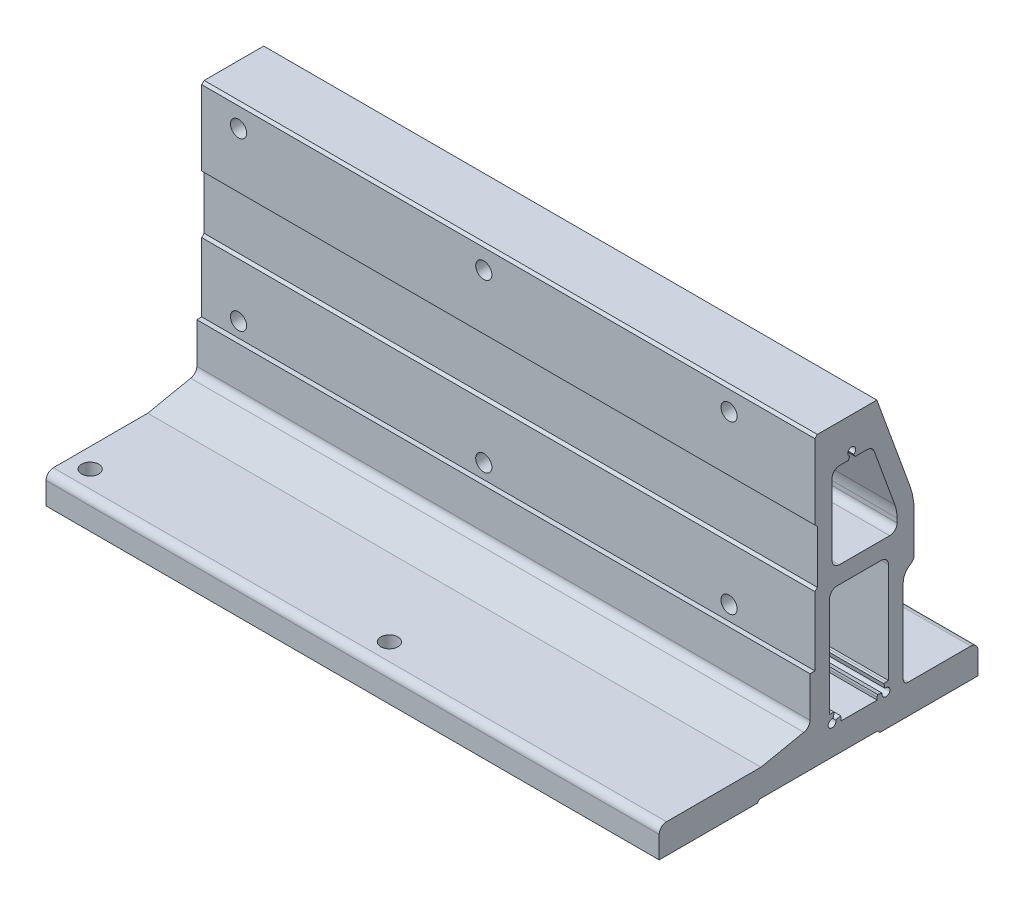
ISO-10303-21;
HEADER;
FILE_DESCRIPTION(('STEP AP214'),'2;1');
FILE_NAME('part.step','',(''),(''),'','','');
FILE_SCHEMA(('AUTOMOTIVE_DESIGN { 1 0 10303 214 1 1 1 1 }'));
ENDSEC;
DATA;
#1=APPLICATION_CONTEXT('core data for automotive mechanical design processes');
#2=APPLICATION_PROTOCOL_DEFINITION('international standard','automotive_design',2000,#1);
#3=PRODUCT_CONTEXT('',#1,'mechanical');
#4=PRODUCT('Part','Part','',(#3));
#5=PRODUCT_RELATED_PRODUCT_CATEGORY('part','',(#4));
#6=PRODUCT_DEFINITION_FORMATION('','',#4);
#7=PRODUCT_DEFINITION_CONTEXT('part definition',#1,'design');
#8=PRODUCT_DEFINITION('design','',#6,#7);
#9=PRODUCT_DEFINITION_SHAPE('','',#8);
#10=(LENGTH_UNIT() NAMED_UNIT(*) SI_UNIT(.MILLI.,.METRE.));
#11=(NAMED_UNIT(*) PLANE_ANGLE_UNIT() SI_UNIT($,.RADIAN.));
#12=(NAMED_UNIT(*) SI_UNIT($,.STERADIAN.) SOLID_ANGLE_UNIT());
#13=UNCERTAINTY_MEASURE_WITH_UNIT(LENGTH_MEASURE(1.E-05),#10,'distance_accuracy_value','');
#14=(GEOMETRIC_REPRESENTATION_CONTEXT(3) GLOBAL_UNCERTAINTY_ASSIGNED_CONTEXT((#13)) GLOBAL_UNIT_ASSIGNED_CONTEXT((#10,
#11,#12)) REPRESENTATION_CONTEXT('',''));
#15=CARTESIAN_POINT('',(0.,0.,0.));
#16=DIRECTION('',(0.,0.,1.));
#17=DIRECTION('',(1.,0.,0.));
#18=AXIS2_PLACEMENT_3D('',#15,#16,#17);
#19=CARTESIAN_POINT('',(125.,103.999996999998,-13.5000000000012));
#20=DIRECTION('',(-1.,0.,0.));
#21=DIRECTION('',(0.,0.,1.));
#22=AXIS2_PLACEMENT_3D('',#19,#20,#21);
#23=CYLINDRICAL_SURFACE('',#22,1.60000000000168);
#24=CARTESIAN_POINT('',(-108.884274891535,102.61435635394,-14.2999999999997));
#25=CARTESIAN_POINT('',(-108.807362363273,102.630297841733,-14.3276489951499));
#26=CARTESIAN_POINT('',(-108.731058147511,102.647816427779,-14.3560473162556));
#27=CARTESIAN_POINT('',(-108.579527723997,102.686019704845,-14.4135860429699));
#28=CARTESIAN_POINT('',(-108.504301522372,102.706704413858,-14.4427264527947));
#29=CARTESIAN_POINT('',(-108.354547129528,102.751323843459,-14.5010868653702));
#30=CARTESIAN_POINT('',(-108.280021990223,102.775268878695,-14.5303068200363));
#31=CARTESIAN_POINT('',(-108.131871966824,102.826390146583,-14.5881806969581));
#32=CARTESIAN_POINT('',(-108.058247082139,102.853566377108,-14.6168346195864));
#33=CARTESIAN_POINT('',(-107.836702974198,102.940793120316,-14.7019763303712));
#34=CARTESIAN_POINT('',(-107.69011391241,103.005949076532,-14.7568369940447));
#35=CARTESIAN_POINT('',(-107.401208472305,103.150023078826,-14.8584227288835));
#36=CARTESIAN_POINT('',(-107.258885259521,103.228917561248,-14.9051614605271));
#37=CARTESIAN_POINT('',(-106.980086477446,103.400353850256,-14.9863986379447));
#38=CARTESIAN_POINT('',(-106.843582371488,103.492815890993,-15.0209648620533));
#39=CARTESIAN_POINT('',(-106.577774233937,103.691207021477,-15.0732541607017));
#40=CARTESIAN_POINT('',(-106.448446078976,103.797086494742,-15.0910373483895));
#41=CARTESIAN_POINT('',(-106.221287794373,104.001202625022,-15.1026607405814));
#42=CARTESIAN_POINT('',(-106.121924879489,104.097494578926,-15.1001700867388));
#43=CARTESIAN_POINT('',(-105.931854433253,104.296088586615,-15.075532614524));
#44=CARTESIAN_POINT('',(-105.841136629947,104.398383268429,-15.0534094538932));
#45=CARTESIAN_POINT('',(-105.691890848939,104.579408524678,-14.9936574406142));
#46=CARTESIAN_POINT('',(-105.630912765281,104.657791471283,-14.961136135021));
#47=CARTESIAN_POINT('',(-105.516729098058,104.812602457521,-14.8810327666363));
#48=CARTESIAN_POINT('',(-105.463520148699,104.8890313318,-14.8334572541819));
#49=CARTESIAN_POINT('',(-105.365645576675,105.036777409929,-14.7221714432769));
#50=CARTESIAN_POINT('',(-105.321055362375,105.10804635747,-14.658329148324));
#51=CARTESIAN_POINT('',(-105.241874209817,105.240254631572,-14.515481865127));
#52=CARTESIAN_POINT('',(-105.207275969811,105.30120148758,-14.436488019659));
#53=CARTESIAN_POINT('',(-105.152476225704,105.40109277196,-14.277501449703));
#54=CARTESIAN_POINT('',(-105.130950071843,105.441909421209,-14.1991359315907));
#55=CARTESIAN_POINT('',(-105.095565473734,105.510417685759,-14.0352583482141));
#56=CARTESIAN_POINT('',(-105.081703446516,105.538115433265,-13.9497496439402));
#57=CARTESIAN_POINT('',(-105.062361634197,105.577158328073,-13.7817459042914));
#58=CARTESIAN_POINT('',(-105.056282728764,105.589667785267,-13.6995877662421));
#59=CARTESIAN_POINT('',(-105.050394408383,105.601781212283,-13.5341107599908));
#60=CARTESIAN_POINT('',(-105.050583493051,105.601388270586,-13.4507921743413));
#61=CARTESIAN_POINT('',(-105.057154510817,105.587878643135,-13.2874028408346));
#62=CARTESIAN_POINT('',(-105.063392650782,105.575057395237,-13.2073015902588));
#63=CARTESIAN_POINT('',(-105.081918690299,105.537702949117,-13.05061641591));
#64=CARTESIAN_POINT('',(-105.094206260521,105.513170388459,-12.9740323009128));
#65=CARTESIAN_POINT('',(-105.125001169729,105.453332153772,-12.826039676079));
#66=CARTESIAN_POINT('',(-105.143542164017,105.417968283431,-12.7546617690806));
#67=CARTESIAN_POINT('',(-105.186849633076,105.338113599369,-12.6193063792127));
#68=CARTESIAN_POINT('',(-105.211616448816,105.29362228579,-12.5553293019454));
#69=CARTESIAN_POINT('',(-105.26829274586,105.195672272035,-12.4338522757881));
#70=CARTESIAN_POINT('',(-105.300432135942,105.141943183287,-12.3766785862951));
#71=CARTESIAN_POINT('',(-105.370951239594,105.029085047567,-12.272447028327));
#72=CARTESIAN_POINT('',(-105.409332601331,104.969954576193,-12.225391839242));
#73=CARTESIAN_POINT('',(-105.495645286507,104.842912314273,-12.137651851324));
#74=CARTESIAN_POINT('',(-105.544131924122,104.774694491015,-12.0979610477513));
#75=CARTESIAN_POINT('',(-105.647090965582,104.637024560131,-12.0302742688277));
#76=CARTESIAN_POINT('',(-105.701567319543,104.567571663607,-12.002286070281));
#77=CARTESIAN_POINT('',(-105.844318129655,104.394679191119,-11.9456007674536));
#78=CARTESIAN_POINT('',(-105.935821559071,104.291696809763,-11.9236132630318));
#79=CARTESIAN_POINT('',(-106.127610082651,104.091815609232,-11.8994520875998));
#80=CARTESIAN_POINT('',(-106.227910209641,103.994927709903,-11.8973130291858));
#81=CARTESIAN_POINT('',(-106.406857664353,103.834713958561,-11.9071244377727));
#82=CARTESIAN_POINT('',(-106.483999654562,103.769412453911,-11.9154109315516));
#83=CARTESIAN_POINT('',(-106.64111540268,103.643623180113,-11.9388809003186));
#84=CARTESIAN_POINT('',(-106.721089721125,103.583136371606,-11.954065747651));
#85=CARTESIAN_POINT('',(-106.883738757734,103.466903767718,-11.9901875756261));
#86=CARTESIAN_POINT('',(-106.966424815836,103.411182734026,-12.0111524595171));
#87=CARTESIAN_POINT('',(-107.133719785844,103.304868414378,-12.0577230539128));
#88=CARTESIAN_POINT('',(-107.218328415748,103.254274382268,-12.0833280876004));
#89=CARTESIAN_POINT('',(-107.430234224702,103.135089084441,-12.1514274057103));
#90=CARTESIAN_POINT('',(-107.558524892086,103.069518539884,-12.1961284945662));
#91=CARTESIAN_POINT('',(-107.818239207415,102.949214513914,-12.2909837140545));
#92=CARTESIAN_POINT('',(-107.949665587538,102.894490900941,-12.341142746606));
#93=CARTESIAN_POINT('',(-108.147878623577,102.820761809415,-12.4180385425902));
#94=CARTESIAN_POINT('',(-108.213602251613,102.797728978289,-12.443736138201));
#95=CARTESIAN_POINT('',(-108.345770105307,102.754205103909,-12.4954381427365));
#96=CARTESIAN_POINT('',(-108.412214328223,102.733714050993,-12.5214425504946));
#97=CARTESIAN_POINT('',(-108.545747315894,102.695287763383,-12.5733017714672));
#98=CARTESIAN_POINT('',(-108.612834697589,102.677347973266,-12.5991567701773));
#99=CARTESIAN_POINT('',(-108.747877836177,102.643974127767,-12.650209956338));
#100=CARTESIAN_POINT('',(-108.815833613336,102.628540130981,-12.6754081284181));
#101=CARTESIAN_POINT('',(-108.884274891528,102.614356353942,-12.7000000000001));
#102=B_SPLINE_CURVE_WITH_KNOTS('',3,(#24,#25,#26,#27,#28,#29,#30,#31,#32,#33,#34,#35,#36,#37,
#38,#39,#40,#41,#42,#43,#44,#45,#46,#47,#48,#49,#50,#51,#52,#53,#54,#55,#56,#57,#58,#59,#60,#61,
#62,#63,#64,#65,#66,#67,#68,#69,#70,#71,#72,#73,#74,#75,#76,#77,#78,#79,#80,#81,#82,#83,#84,#85,
#86,#87,#88,#89,#90,#91,#92,#93,#94,#95,#96,#97,#98,#99,#100,#101),.UNSPECIFIED.,.F.,.F.,(4,2,2,
2,2,2,2,2,2,2,2,2,2,2,2,2,2,2,2,2,2,2,2,2,2,2,2,2,2,2,2,2,2,2,2,2,2,2,4),(0.,0.249778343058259,
0.499558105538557,0.750147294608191,1.00073631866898,1.50860254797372,2.01560613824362,
2.51974027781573,3.02206178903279,3.4358034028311,3.84904712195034,4.16134888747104,
4.47351495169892,4.78829957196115,5.10285357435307,5.37420649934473,5.64543245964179,
5.89419616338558,6.14290032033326,6.38583384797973,6.62875415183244,6.87300326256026,
7.11726575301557,7.37054461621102,7.62389046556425,7.90070638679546,8.17770597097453,
8.59388400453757,9.01078765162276,9.31461992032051,9.61851265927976,9.92389894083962,
10.2292407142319,10.6811717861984,11.1335121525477,11.3561714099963,11.5788298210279,
11.8010855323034,12.0233464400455),.UNSPECIFIED.);
#103=CARTESIAN_POINT('',(-108.884274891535,102.61435635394,-14.2999999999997));
#104=VERTEX_POINT('',#103);
#105=CARTESIAN_POINT('',(-108.884274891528,102.614356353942,-12.7000000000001));
#106=VERTEX_POINT('',#105);
#107=EDGE_CURVE('E11',#104,#106,#102,.T.);
#108=ORIENTED_EDGE('',*,*,#107,.F.);
#109=DIRECTION('',(-1.,0.,0.));
#110=VECTOR('',#109,1.);
#111=CARTESIAN_POINT('',(125.,102.61435635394,-14.2999999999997));
#112=LINE('',#111,#110);
#113=CARTESIAN_POINT('',(-11.1157251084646,102.61435635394,-14.2999999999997));
#114=VERTEX_POINT('',#113);
#115=EDGE_CURVE('E1221',#114,#104,#112,.T.);
#116=ORIENTED_EDGE('',*,*,#115,.F.);
#117=CARTESIAN_POINT('',(-11.1157251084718,102.614356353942,-12.7000000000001));
#118=CARTESIAN_POINT('',(-11.1926376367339,102.630297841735,-12.6723510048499));
#119=CARTESIAN_POINT('',(-11.2689418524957,102.64781642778,-12.6439526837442));
#120=CARTESIAN_POINT('',(-11.4204722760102,102.686019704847,-12.5864139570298));
#121=CARTESIAN_POINT('',(-11.4956984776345,102.706704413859,-12.5572735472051));
#122=CARTESIAN_POINT('',(-11.6454528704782,102.751323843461,-12.4989131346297));
#123=CARTESIAN_POINT('',(-11.7199780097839,102.775268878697,-12.4696931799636));
#124=CARTESIAN_POINT('',(-11.8681280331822,102.826390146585,-12.4118193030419));
#125=CARTESIAN_POINT('',(-11.9417529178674,102.85356637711,-12.3831653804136));
#126=CARTESIAN_POINT('',(-12.1632970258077,102.940793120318,-12.2980236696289));
#127=CARTESIAN_POINT('',(-12.309886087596,103.005949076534,-12.2431630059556));
#128=CARTESIAN_POINT('',(-12.5987915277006,103.150023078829,-12.1415772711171));
#129=CARTESIAN_POINT('',(-12.7411147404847,103.228917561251,-12.0948385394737));
#130=CARTESIAN_POINT('',(-13.0199135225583,103.400353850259,-12.0136013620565));
#131=CARTESIAN_POINT('',(-13.156417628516,103.492815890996,-11.9790351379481));
#132=CARTESIAN_POINT('',(-13.422225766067,103.69120702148,-11.9267458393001));
#133=CARTESIAN_POINT('',(-13.5515539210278,103.797086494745,-11.9089626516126));
#134=CARTESIAN_POINT('',(-13.7787122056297,104.001202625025,-11.897339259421));
#135=CARTESIAN_POINT('',(-13.8780751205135,104.097494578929,-11.8998299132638));
#136=CARTESIAN_POINT('',(-14.0681455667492,104.296088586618,-11.9244673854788));
#137=CARTESIAN_POINT('',(-14.1588633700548,104.398383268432,-11.9465905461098));
#138=CARTESIAN_POINT('',(-14.3081091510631,104.57940852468,-12.0063425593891));
#139=CARTESIAN_POINT('',(-14.3690872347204,104.657791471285,-12.0388638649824));
#140=CARTESIAN_POINT('',(-14.4832709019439,104.812602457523,-12.1189672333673));
#141=CARTESIAN_POINT('',(-14.5364798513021,104.889031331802,-12.1665427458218));
#142=CARTESIAN_POINT('',(-14.634354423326,105.036777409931,-12.2778285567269));
#143=CARTESIAN_POINT('',(-14.6789446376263,105.108046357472,-12.3416708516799));
#144=CARTESIAN_POINT('',(-14.7581257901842,105.240254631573,-12.484518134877));
#145=CARTESIAN_POINT('',(-14.7927240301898,105.301201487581,-12.5635119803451));
#146=CARTESIAN_POINT('',(-14.8475237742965,105.401092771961,-12.7224985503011));
#147=CARTESIAN_POINT('',(-14.8690499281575,105.441909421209,-12.8008640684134));
#148=CARTESIAN_POINT('',(-14.904434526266,105.51041768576,-12.96474165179));
#149=CARTESIAN_POINT('',(-14.9182965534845,105.538115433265,-13.050250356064));
#150=CARTESIAN_POINT('',(-14.9376383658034,105.577158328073,-13.2182540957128));
#151=CARTESIAN_POINT('',(-14.9437172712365,105.589667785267,-13.300412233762));
#152=CARTESIAN_POINT('',(-14.9496055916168,105.601781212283,-13.4658892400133));
#153=CARTESIAN_POINT('',(-14.9494165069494,105.601388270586,-13.5492078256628));
#154=CARTESIAN_POINT('',(-14.942845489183,105.587878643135,-13.7125971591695));
#155=CARTESIAN_POINT('',(-14.9366073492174,105.575057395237,-13.7926984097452));
#156=CARTESIAN_POINT('',(-14.9180813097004,105.537702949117,-13.949383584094));
#157=CARTESIAN_POINT('',(-14.9057937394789,105.513170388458,-14.0259676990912));
#158=CARTESIAN_POINT('',(-14.8749988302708,105.453332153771,-14.1739603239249));
#159=CARTESIAN_POINT('',(-14.8564578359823,105.41796828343,-14.2453382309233));
#160=CARTESIAN_POINT('',(-14.8131503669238,105.338113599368,-14.3806936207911));
#161=CARTESIAN_POINT('',(-14.7883835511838,105.293622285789,-14.4446706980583));
#162=CARTESIAN_POINT('',(-14.7317072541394,105.195672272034,-14.5661477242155));
#163=CARTESIAN_POINT('',(-14.6995678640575,105.141943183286,-14.6233214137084));
#164=CARTESIAN_POINT('',(-14.6290487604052,105.029085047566,-14.7275529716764));
#165=CARTESIAN_POINT('',(-14.5906673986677,104.969954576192,-14.7746081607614));
#166=CARTESIAN_POINT('',(-14.5043547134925,104.842912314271,-14.8623481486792));
#167=CARTESIAN_POINT('',(-14.455868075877,104.774694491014,-14.9020389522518));
#168=CARTESIAN_POINT('',(-14.3529090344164,104.63702456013,-14.9697257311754));
#169=CARTESIAN_POINT('',(-14.2984326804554,104.567571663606,-14.997713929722));
#170=CARTESIAN_POINT('',(-14.1556818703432,104.394679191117,-15.0543992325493));
#171=CARTESIAN_POINT('',(-14.064178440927,104.291696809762,-15.0763867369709));
#172=CARTESIAN_POINT('',(-13.8723899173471,104.091815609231,-15.1005479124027));
#173=CARTESIAN_POINT('',(-13.7720897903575,103.994927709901,-15.1026869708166));
#174=CARTESIAN_POINT('',(-13.593142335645,103.834713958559,-15.0928755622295));
#175=CARTESIAN_POINT('',(-13.5160003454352,103.769412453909,-15.0845890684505));
#176=CARTESIAN_POINT('',(-13.3588845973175,103.643623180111,-15.0611190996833));
#177=CARTESIAN_POINT('',(-13.2789102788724,103.583136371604,-15.0459342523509));
#178=CARTESIAN_POINT('',(-13.1162612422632,103.466903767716,-15.0098124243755));
#179=CARTESIAN_POINT('',(-13.0335751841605,103.411182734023,-14.9888475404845));
#180=CARTESIAN_POINT('',(-12.8662802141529,103.304868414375,-14.9422769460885));
#181=CARTESIAN_POINT('',(-12.7816715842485,103.254274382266,-14.9166719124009));
#182=CARTESIAN_POINT('',(-12.5697657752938,103.135089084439,-14.8485725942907));
#183=CARTESIAN_POINT('',(-12.4414751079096,103.069518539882,-14.8038715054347));
#184=CARTESIAN_POINT('',(-12.1817607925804,102.949214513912,-14.7090162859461));
#185=CARTESIAN_POINT('',(-12.0503344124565,102.894490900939,-14.6588572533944));
#186=CARTESIAN_POINT('',(-11.8521213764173,102.820761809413,-14.58196145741));
#187=CARTESIAN_POINT('',(-11.7863977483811,102.797728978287,-14.5562638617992));
#188=CARTESIAN_POINT('',(-11.6542298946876,102.754205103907,-14.5045618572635));
#189=CARTESIAN_POINT('',(-11.5877856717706,102.733714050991,-14.4785574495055));
#190=CARTESIAN_POINT('',(-11.4542526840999,102.695287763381,-14.4266982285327));
#191=CARTESIAN_POINT('',(-11.387165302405,102.677347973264,-14.4008432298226));
#192=CARTESIAN_POINT('',(-11.2521221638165,102.643974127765,-14.3497900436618));
#193=CARTESIAN_POINT('',(-11.1841663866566,102.62854013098,-14.3245918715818));
#194=CARTESIAN_POINT('',(-11.1157251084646,102.61435635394,-14.2999999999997));
#195=B_SPLINE_CURVE_WITH_KNOTS('',3,(#117,#118,#119,#120,#121,#122,#123,#124,#125,#126,#127,
#128,#129,#130,#131,#132,#133,#134,#135,#136,#137,#138,#139,#140,#141,#142,#143,#144,#145,#146,
#147,#148,#149,#150,#151,#152,#153,#154,#155,#156,#157,#158,#159,#160,#161,#162,#163,#164,#165,
#166,#167,#168,#169,#170,#171,#172,#173,#174,#175,#176,#177,#178,#179,#180,#181,#182,#183,#184,
#185,#186,#187,#188,#189,#190,#191,#192,#193,#194),.UNSPECIFIED.,.F.,.F.,(4,2,2,2,2,2,2,2,2,2,2,
2,2,2,2,2,2,2,2,2,2,2,2,2,2,2,2,2,2,2,2,2,2,2,2,2,2,2,4),(0.,0.249778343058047,
0.499558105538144,0.75014729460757,1.00073631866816,1.50860254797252,2.01560613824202,
2.51974027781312,3.0220617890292,3.43580340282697,3.8490471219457,4.16134888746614,
4.47351495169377,4.78829957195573,5.10285357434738,5.3742064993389,5.64543245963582,
5.89419616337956,6.14290032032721,6.38583384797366,6.62875415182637,6.87300326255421,
7.11726575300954,7.37054461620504,7.6238904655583,7.90070638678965,8.17770597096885,
8.59388400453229,9.01078765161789,9.31461992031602,9.61851265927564,9.92389894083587,
10.2292407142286,10.6811717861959,11.133512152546,11.356171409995,11.578829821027,
11.801085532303,12.0233464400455),.UNSPECIFIED.);
#196=CARTESIAN_POINT('',(-11.1157251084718,102.614356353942,-12.7000000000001));
#197=VERTEX_POINT('',#196);
#198=EDGE_CURVE('E1273',#197,#114,#195,.T.);
#199=ORIENTED_EDGE('',*,*,#198,.F.);
#200=DIRECTION('',(-1.,0.,0.));
#201=VECTOR('',#200,1.);
#202=CARTESIAN_POINT('',(125.,102.614356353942,-12.7000000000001));
#203=LINE('',#202,#201);
#204=EDGE_CURVE('E1223',#197,#106,#203,.T.);
#205=ORIENTED_EDGE('',*,*,#204,.T.);
#206=EDGE_LOOP('',(#108,#116,#199,#205));
#207=FACE_BOUND('',#206,.T.);
#208=ADVANCED_FACE('F37',(#207),#23,.F.);
#209=CARTESIAN_POINT('',(-8.88427489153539,102.61435635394,-14.2999999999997));
#210=CARTESIAN_POINT('',(-8.80736236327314,102.630297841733,-14.3276489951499));
#211=CARTESIAN_POINT('',(-8.73105814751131,102.647816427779,-14.3560473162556));
#212=CARTESIAN_POINT('',(-8.57952772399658,102.686019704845,-14.4135860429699));
#213=CARTESIAN_POINT('',(-8.50430152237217,102.706704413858,-14.4427264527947));
#214=CARTESIAN_POINT('',(-8.35454712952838,102.751323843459,-14.5010868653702));
#215=CARTESIAN_POINT('',(-8.28002199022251,102.775268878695,-14.5303068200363));
#216=CARTESIAN_POINT('',(-8.13187196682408,102.826390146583,-14.5881806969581));
#217=CARTESIAN_POINT('',(-8.05824708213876,102.853566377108,-14.6168346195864));
#218=CARTESIAN_POINT('',(-7.83670297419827,102.940793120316,-14.7019763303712));
#219=CARTESIAN_POINT('',(-7.69011391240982,103.005949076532,-14.7568369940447));
#220=CARTESIAN_POINT('',(-7.40120847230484,103.150023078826,-14.8584227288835));
#221=CARTESIAN_POINT('',(-7.25888525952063,103.228917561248,-14.9051614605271));
#222=CARTESIAN_POINT('',(-6.98008647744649,103.400353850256,-14.9863986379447));
#223=CARTESIAN_POINT('',(-6.84358237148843,103.492815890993,-15.0209648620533));
#224=CARTESIAN_POINT('',(-6.57777423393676,103.691207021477,-15.0732541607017));
#225=CARTESIAN_POINT('',(-6.44844607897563,103.797086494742,-15.0910373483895));
#226=CARTESIAN_POINT('',(-6.22128779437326,104.001202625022,-15.1026607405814));
#227=CARTESIAN_POINT('',(-6.12192487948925,104.097494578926,-15.1001700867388));
#228=CARTESIAN_POINT('',(-5.93185443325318,104.296088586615,-15.0755326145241));
#229=CARTESIAN_POINT('',(-5.84113662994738,104.398383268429,-15.0534094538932));
#230=CARTESIAN_POINT('',(-5.6918908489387,104.579408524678,-14.9936574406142));
#231=CARTESIAN_POINT('',(-5.63091276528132,104.657791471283,-14.961136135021));
#232=CARTESIAN_POINT('',(-5.51672909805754,104.812602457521,-14.8810327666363));
#233=CARTESIAN_POINT('',(-5.46352014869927,104.8890313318,-14.8334572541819));
#234=CARTESIAN_POINT('',(-5.36564557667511,105.036777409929,-14.7221714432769));
#235=CARTESIAN_POINT('',(-5.3210553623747,105.10804635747,-14.658329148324));
#236=CARTESIAN_POINT('',(-5.24187420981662,105.240254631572,-14.515481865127));
#237=CARTESIAN_POINT('',(-5.20727596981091,105.30120148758,-14.436488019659));
#238=CARTESIAN_POINT('',(-5.15247622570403,105.40109277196,-14.277501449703));
#239=CARTESIAN_POINT('',(-5.130950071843,105.441909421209,-14.1991359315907));
#240=CARTESIAN_POINT('',(-5.09556547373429,105.510417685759,-14.0352583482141));
#241=CARTESIAN_POINT('',(-5.08170344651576,105.538115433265,-13.9497496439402));
#242=CARTESIAN_POINT('',(-5.06236163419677,105.577158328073,-13.7817459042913));
#243=CARTESIAN_POINT('',(-5.05628272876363,105.589667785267,-13.6995877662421));
#244=CARTESIAN_POINT('',(-5.05039440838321,105.601781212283,-13.5341107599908));
#245=CARTESIAN_POINT('',(-5.05058349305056,105.601388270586,-13.4507921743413));
#246=CARTESIAN_POINT('',(-5.05715451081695,105.587878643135,-13.2874028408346));
#247=CARTESIAN_POINT('',(-5.06339265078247,105.575057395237,-13.2073015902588));
#248=CARTESIAN_POINT('',(-5.08191869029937,105.537702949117,-13.05061641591));
#249=CARTESIAN_POINT('',(-5.09420626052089,105.513170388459,-12.9740323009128));
#250=CARTESIAN_POINT('',(-5.1250011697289,105.453332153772,-12.826039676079));
#251=CARTESIAN_POINT('',(-5.14354216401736,105.417968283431,-12.7546617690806));
#252=CARTESIAN_POINT('',(-5.18684963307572,105.338113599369,-12.6193063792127));
#253=CARTESIAN_POINT('',(-5.21161644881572,105.29362228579,-12.5553293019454));
#254=CARTESIAN_POINT('',(-5.26829274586,105.195672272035,-12.4338522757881));
#255=CARTESIAN_POINT('',(-5.30043213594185,105.141943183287,-12.3766785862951));
#256=CARTESIAN_POINT('',(-5.370951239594,105.029085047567,-12.272447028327));
#257=CARTESIAN_POINT('',(-5.40933260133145,104.969954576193,-12.225391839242));
#258=CARTESIAN_POINT('',(-5.49564528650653,104.842912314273,-12.137651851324));
#259=CARTESIAN_POINT('',(-5.54413192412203,104.774694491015,-12.0979610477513));
#260=CARTESIAN_POINT('',(-5.64709096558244,104.637024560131,-12.0302742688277));
#261=CARTESIAN_POINT('',(-5.70156731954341,104.567571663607,-12.002286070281));
#262=CARTESIAN_POINT('',(-5.84431812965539,104.394679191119,-11.9456007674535));
#263=CARTESIAN_POINT('',(-5.93582155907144,104.291696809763,-11.9236132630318));
#264=CARTESIAN_POINT('',(-6.12761008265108,104.091815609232,-11.8994520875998));
#265=CARTESIAN_POINT('',(-6.22791020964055,103.994927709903,-11.8973130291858));
#266=CARTESIAN_POINT('',(-6.40685766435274,103.834713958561,-11.9071244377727));
#267=CARTESIAN_POINT('',(-6.48399965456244,103.769412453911,-11.9154109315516));
#268=CARTESIAN_POINT('',(-6.64111540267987,103.643623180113,-11.9388809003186));
#269=CARTESIAN_POINT('',(-6.72108972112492,103.583136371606,-11.954065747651));
#270=CARTESIAN_POINT('',(-6.88373875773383,103.466903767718,-11.9901875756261));
#271=CARTESIAN_POINT('',(-6.96642481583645,103.411182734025,-12.0111524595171));
#272=CARTESIAN_POINT('',(-7.13371978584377,103.304868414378,-12.0577230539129));
#273=CARTESIAN_POINT('',(-7.21832841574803,103.254274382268,-12.0833280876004));
#274=CARTESIAN_POINT('',(-7.43023422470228,103.135089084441,-12.1514274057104));
#275=CARTESIAN_POINT('',(-7.55852489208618,103.069518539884,-12.1961284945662));
#276=CARTESIAN_POINT('',(-7.81823920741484,102.949214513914,-12.2909837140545));
#277=CARTESIAN_POINT('',(-7.9496655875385,102.894490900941,-12.3411427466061));
#278=CARTESIAN_POINT('',(-8.1478786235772,102.820761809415,-12.4180385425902));
#279=CARTESIAN_POINT('',(-8.21360225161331,102.797728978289,-12.443736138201));
#280=CARTESIAN_POINT('',(-8.34577010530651,102.754205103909,-12.4954381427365));
#281=CARTESIAN_POINT('',(-8.41221432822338,102.733714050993,-12.5214425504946));
#282=CARTESIAN_POINT('',(-8.54574731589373,102.695287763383,-12.5733017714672));
#283=CARTESIAN_POINT('',(-8.61283469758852,102.677347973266,-12.5991567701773));
#284=CARTESIAN_POINT('',(-8.74787783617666,102.643974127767,-12.650209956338));
#285=CARTESIAN_POINT('',(-8.81583361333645,102.628540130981,-12.6754081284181));
#286=CARTESIAN_POINT('',(-8.88427489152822,102.614356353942,-12.7000000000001));
#287=B_SPLINE_CURVE_WITH_KNOTS('',3,(#209,#210,#211,#212,#213,#214,#215,#216,#217,#218,#219,
#220,#221,#222,#223,#224,#225,#226,#227,#228,#229,#230,#231,#232,#233,#234,#235,#236,#237,#238,
#239,#240,#241,#242,#243,#244,#245,#246,#247,#248,#249,#250,#251,#252,#253,#254,#255,#256,#257,
#258,#259,#260,#261,#262,#263,#264,#265,#266,#267,#268,#269,#270,#271,#272,#273,#274,#275,#276,
#277,#278,#279,#280,#281,#282,#283,#284,#285,#286),.UNSPECIFIED.,.F.,.F.,(4,2,2,2,2,2,2,2,2,2,2,
2,2,2,2,2,2,2,2,2,2,2,2,2,2,2,2,2,2,2,2,2,2,2,2,2,2,2,4),(0.,0.249778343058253,
0.499558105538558,0.750147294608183,1.00073631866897,1.50860254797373,2.01560613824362,
2.51974027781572,3.02206178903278,3.43580340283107,3.84904712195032,4.16134888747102,
4.47351495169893,4.78829957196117,5.10285357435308,5.37420649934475,5.64543245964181,
5.89419616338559,6.14290032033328,6.38583384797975,6.62875415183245,6.87300326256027,
7.11726575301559,7.37054461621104,7.62389046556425,7.90070638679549,8.17770597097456,
8.59388400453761,9.0107876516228,9.31461992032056,9.61851265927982,9.92389894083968,
10.229240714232,10.6811717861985,11.1335121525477,11.3561714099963,11.5788298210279,
11.8010855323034,12.0233464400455),.UNSPECIFIED.);
#288=CARTESIAN_POINT('',(-8.88427489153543,102.61435635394,-14.2999999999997));
#289=VERTEX_POINT('',#288);
#290=CARTESIAN_POINT('',(-8.88427489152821,102.614356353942,-12.7000000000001));
#291=VERTEX_POINT('',#290);
#292=EDGE_CURVE('E1270',#289,#291,#287,.T.);
#293=ORIENTED_EDGE('',*,*,#292,.F.);
#294=CARTESIAN_POINT('',(88.8842748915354,102.61435635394,-14.2999999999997));
#295=VERTEX_POINT('',#294);
#296=EDGE_CURVE('E835',#295,#289,#112,.T.);
#297=ORIENTED_EDGE('',*,*,#296,.F.);
#298=CARTESIAN_POINT('',(88.8842748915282,102.614356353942,-12.7000000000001));
#299=CARTESIAN_POINT('',(88.8073623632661,102.630297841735,-12.6723510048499));
#300=CARTESIAN_POINT('',(88.7310581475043,102.64781642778,-12.6439526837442));
#301=CARTESIAN_POINT('',(88.5795277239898,102.686019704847,-12.5864139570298));
#302=CARTESIAN_POINT('',(88.5043015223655,102.706704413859,-12.5572735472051));
#303=CARTESIAN_POINT('',(88.3545471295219,102.751323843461,-12.4989131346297));
#304=CARTESIAN_POINT('',(88.2800219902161,102.775268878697,-12.4696931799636));
#305=CARTESIAN_POINT('',(88.1318719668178,102.826390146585,-12.4118193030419));
#306=CARTESIAN_POINT('',(88.0582470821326,102.85356637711,-12.3831653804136));
#307=CARTESIAN_POINT('',(87.8367029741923,102.940793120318,-12.2980236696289));
#308=CARTESIAN_POINT('',(87.690113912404,103.005949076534,-12.2431630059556));
#309=CARTESIAN_POINT('',(87.4012084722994,103.150023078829,-12.1415772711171));
#310=CARTESIAN_POINT('',(87.2588852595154,103.228917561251,-12.0948385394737));
#311=CARTESIAN_POINT('',(86.9800864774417,103.400353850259,-12.0136013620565));
#312=CARTESIAN_POINT('',(86.843582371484,103.492815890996,-11.9790351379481));
#313=CARTESIAN_POINT('',(86.577774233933,103.69120702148,-11.9267458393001));
#314=CARTESIAN_POINT('',(86.4484460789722,103.797086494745,-11.9089626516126));
#315=CARTESIAN_POINT('',(86.2212877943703,104.001202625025,-11.897339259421));
#316=CARTESIAN_POINT('',(86.1219248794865,104.097494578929,-11.8998299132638));
#317=CARTESIAN_POINT('',(85.9318544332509,104.296088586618,-11.9244673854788));
#318=CARTESIAN_POINT('',(85.8411366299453,104.398383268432,-11.9465905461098));
#319=CARTESIAN_POINT('',(85.6918908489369,104.57940852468,-12.0063425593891));
#320=CARTESIAN_POINT('',(85.6309127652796,104.657791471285,-12.0388638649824));
#321=CARTESIAN_POINT('',(85.5167290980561,104.812602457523,-12.1189672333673));
#322=CARTESIAN_POINT('',(85.4635201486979,104.889031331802,-12.1665427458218));
#323=CARTESIAN_POINT('',(85.365645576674,105.036777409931,-12.2778285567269));
#324=CARTESIAN_POINT('',(85.3210553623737,105.108046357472,-12.3416708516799));
#325=CARTESIAN_POINT('',(85.2418742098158,105.240254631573,-12.484518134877));
#326=CARTESIAN_POINT('',(85.2072759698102,105.301201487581,-12.5635119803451));
#327=CARTESIAN_POINT('',(85.1524762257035,105.401092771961,-12.7224985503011));
#328=CARTESIAN_POINT('',(85.1309500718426,105.441909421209,-12.8008640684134));
#329=CARTESIAN_POINT('',(85.095565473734,105.51041768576,-12.96474165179));
#330=CARTESIAN_POINT('',(85.0817034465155,105.538115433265,-13.0502503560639));
#331=CARTESIAN_POINT('',(85.0623616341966,105.577158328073,-13.2182540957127));
#332=CARTESIAN_POINT('',(85.0562827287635,105.589667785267,-13.300412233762));
#333=CARTESIAN_POINT('',(85.0503944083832,105.601781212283,-13.4658892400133));
#334=CARTESIAN_POINT('',(85.0505834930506,105.601388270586,-13.5492078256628));
#335=CARTESIAN_POINT('',(85.057154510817,105.587878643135,-13.7125971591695));
#336=CARTESIAN_POINT('',(85.0633926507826,105.575057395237,-13.7926984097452));
#337=CARTESIAN_POINT('',(85.0819186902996,105.537702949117,-13.949383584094));
#338=CARTESIAN_POINT('',(85.0942062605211,105.513170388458,-14.0259676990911));
#339=CARTESIAN_POINT('',(85.1250011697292,105.453332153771,-14.1739603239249));
#340=CARTESIAN_POINT('',(85.1435421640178,105.41796828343,-14.2453382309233));
#341=CARTESIAN_POINT('',(85.1868496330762,105.338113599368,-14.3806936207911));
#342=CARTESIAN_POINT('',(85.2116164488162,105.293622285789,-14.4446706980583));
#343=CARTESIAN_POINT('',(85.2682927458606,105.195672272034,-14.5661477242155));
#344=CARTESIAN_POINT('',(85.3004321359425,105.141943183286,-14.6233214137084));
#345=CARTESIAN_POINT('',(85.3709512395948,105.029085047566,-14.7275529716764));
#346=CARTESIAN_POINT('',(85.4093326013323,104.969954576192,-14.7746081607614));
#347=CARTESIAN_POINT('',(85.4956452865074,104.842912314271,-14.8623481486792));
#348=CARTESIAN_POINT('',(85.544131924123,104.774694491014,-14.9020389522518));
#349=CARTESIAN_POINT('',(85.6470909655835,104.63702456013,-14.9697257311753));
#350=CARTESIAN_POINT('',(85.7015673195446,104.567571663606,-14.997713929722));
#351=CARTESIAN_POINT('',(85.8443181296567,104.394679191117,-15.0543992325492));
#352=CARTESIAN_POINT('',(85.9358215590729,104.291696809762,-15.0763867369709));
#353=CARTESIAN_POINT('',(86.1276100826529,104.091815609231,-15.1005479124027));
#354=CARTESIAN_POINT('',(86.2279102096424,103.994927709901,-15.1026869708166));
#355=CARTESIAN_POINT('',(86.4068576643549,103.834713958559,-15.0928755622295));
#356=CARTESIAN_POINT('',(86.4839996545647,103.769412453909,-15.0845890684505));
#357=CARTESIAN_POINT('',(86.6411154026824,103.643623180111,-15.0611190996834));
#358=CARTESIAN_POINT('',(86.7210897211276,103.583136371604,-15.0459342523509));
#359=CARTESIAN_POINT('',(86.8837387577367,103.466903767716,-15.0098124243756));
#360=CARTESIAN_POINT('',(86.9664248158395,103.411182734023,-14.9888475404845));
#361=CARTESIAN_POINT('',(87.133719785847,103.304868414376,-14.9422769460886));
#362=CARTESIAN_POINT('',(87.2183284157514,103.254274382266,-14.9166719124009));
#363=CARTESIAN_POINT('',(87.4302342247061,103.135089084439,-14.8485725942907));
#364=CARTESIAN_POINT('',(87.5585248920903,103.069518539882,-14.8038715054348));
#365=CARTESIAN_POINT('',(87.8182392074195,102.949214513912,-14.7090162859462));
#366=CARTESIAN_POINT('',(87.9496655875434,102.894490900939,-14.6588572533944));
#367=CARTESIAN_POINT('',(88.1478786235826,102.820761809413,-14.5819614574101));
#368=CARTESIAN_POINT('',(88.2136022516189,102.797728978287,-14.5562638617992));
#369=CARTESIAN_POINT('',(88.3457701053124,102.754205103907,-14.5045618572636));
#370=CARTESIAN_POINT('',(88.4122143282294,102.733714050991,-14.4785574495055));
#371=CARTESIAN_POINT('',(88.5457473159,102.695287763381,-14.4266982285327));
#372=CARTESIAN_POINT('',(88.612834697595,102.677347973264,-14.4008432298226));
#373=CARTESIAN_POINT('',(88.7478778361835,102.643974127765,-14.3497900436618));
#374=CARTESIAN_POINT('',(88.8158336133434,102.62854013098,-14.3245918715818));
#375=CARTESIAN_POINT('',(88.8842748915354,102.61435635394,-14.2999999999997));
#376=B_SPLINE_CURVE_WITH_KNOTS('',3,(#298,#299,#300,#301,#302,#303,#304,#305,#306,#307,#308,
#309,#310,#311,#312,#313,#314,#315,#316,#317,#318,#319,#320,#321,#322,#323,#324,#325,#326,#327,
#328,#329,#330,#331,#332,#333,#334,#335,#336,#337,#338,#339,#340,#341,#342,#343,#344,#345,#346,
#347,#348,#349,#350,#351,#352,#353,#354,#355,#356,#357,#358,#359,#360,#361,#362,#363,#364,#365,
#366,#367,#368,#369,#370,#371,#372,#373,#374,#375),.UNSPECIFIED.,.F.,.F.,(4,2,2,2,2,2,2,2,2,2,2,
2,2,2,2,2,2,2,2,2,2,2,2,2,2,2,2,2,2,2,2,2,2,2,2,2,2,2,4),(0.,0.249778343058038,
0.499558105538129,0.750147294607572,1.00073631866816,1.50860254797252,2.01560613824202,
2.51974027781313,3.02206178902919,3.43580340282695,3.84904712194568,4.16134888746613,
4.47351495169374,4.78829957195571,5.10285357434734,5.37420649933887,5.64543245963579,
5.89419616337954,6.14290032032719,6.38583384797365,6.62875415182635,6.8730032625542,
7.11726575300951,7.37054461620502,7.62389046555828,7.90070638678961,8.17770597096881,
8.59388400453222,9.01078765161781,9.31461992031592,9.61851265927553,9.92389894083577,
10.2292407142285,10.6811717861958,11.1335121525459,11.3561714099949,11.578829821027,
11.801085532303,12.0233464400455),.UNSPECIFIED.);
#377=CARTESIAN_POINT('',(88.8842748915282,102.614356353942,-12.7000000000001));
#378=VERTEX_POINT('',#377);
#379=EDGE_CURVE('E1045',#378,#295,#376,.T.);
#380=ORIENTED_EDGE('',*,*,#379,.F.);
#381=EDGE_CURVE('E830',#378,#291,#203,.T.);
#382=ORIENTED_EDGE('',*,*,#381,.T.);
#383=EDGE_LOOP('',(#293,#297,#380,#382));
#384=FACE_BOUND('',#383,.T.);
#385=ADVANCED_FACE('F1211',(#384),#23,.F.);
#386=CARTESIAN_POINT('',(91.1157251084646,102.61435635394,-14.2999999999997));
#387=CARTESIAN_POINT('',(91.1926376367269,102.630297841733,-14.3276489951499));
#388=CARTESIAN_POINT('',(91.2689418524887,102.647816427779,-14.3560473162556));
#389=CARTESIAN_POINT('',(91.4204722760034,102.686019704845,-14.4135860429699));
#390=CARTESIAN_POINT('',(91.4956984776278,102.706704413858,-14.4427264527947));
#391=CARTESIAN_POINT('',(91.6454528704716,102.751323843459,-14.5010868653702));
#392=CARTESIAN_POINT('',(91.7199780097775,102.775268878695,-14.5303068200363));
#393=CARTESIAN_POINT('',(91.8681280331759,102.826390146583,-14.5881806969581));
#394=CARTESIAN_POINT('',(91.9417529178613,102.853566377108,-14.6168346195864));
#395=CARTESIAN_POINT('',(92.1632970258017,102.940793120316,-14.7019763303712));
#396=CARTESIAN_POINT('',(92.3098860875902,103.005949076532,-14.7568369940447));
#397=CARTESIAN_POINT('',(92.5987915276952,103.150023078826,-14.8584227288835));
#398=CARTESIAN_POINT('',(92.7411147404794,103.228917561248,-14.9051614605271));
#399=CARTESIAN_POINT('',(93.0199135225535,103.400353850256,-14.9863986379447));
#400=CARTESIAN_POINT('',(93.1564176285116,103.492815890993,-15.0209648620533));
#401=CARTESIAN_POINT('',(93.4222257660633,103.691207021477,-15.0732541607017));
#402=CARTESIAN_POINT('',(93.5515539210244,103.797086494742,-15.0910373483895));
#403=CARTESIAN_POINT('',(93.7787122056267,104.001202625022,-15.1026607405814));
#404=CARTESIAN_POINT('',(93.8780751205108,104.097494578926,-15.1001700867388));
#405=CARTESIAN_POINT('',(94.0681455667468,104.296088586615,-15.075532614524));
#406=CARTESIAN_POINT('',(94.1588633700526,104.398383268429,-15.0534094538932));
#407=CARTESIAN_POINT('',(94.3081091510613,104.579408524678,-14.9936574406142));
#408=CARTESIAN_POINT('',(94.3690872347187,104.657791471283,-14.961136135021));
#409=CARTESIAN_POINT('',(94.4832709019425,104.812602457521,-14.8810327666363));
#410=CARTESIAN_POINT('',(94.5364798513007,104.8890313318,-14.8334572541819));
#411=CARTESIAN_POINT('',(94.6343544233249,105.036777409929,-14.7221714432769));
#412=CARTESIAN_POINT('',(94.6789446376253,105.10804635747,-14.658329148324));
#413=CARTESIAN_POINT('',(94.7581257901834,105.240254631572,-14.515481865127));
#414=CARTESIAN_POINT('',(94.7927240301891,105.30120148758,-14.436488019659));
#415=CARTESIAN_POINT('',(94.847523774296,105.40109277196,-14.277501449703));
#416=CARTESIAN_POINT('',(94.869049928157,105.441909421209,-14.1991359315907));
#417=CARTESIAN_POINT('',(94.9044345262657,105.510417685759,-14.0352583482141));
#418=CARTESIAN_POINT('',(94.9182965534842,105.538115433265,-13.9497496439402));
#419=CARTESIAN_POINT('',(94.9376383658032,105.577158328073,-13.7817459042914));
#420=CARTESIAN_POINT('',(94.9437172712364,105.589667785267,-13.6995877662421));
#421=CARTESIAN_POINT('',(94.9496055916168,105.601781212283,-13.5341107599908));
#422=CARTESIAN_POINT('',(94.9494165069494,105.601388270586,-13.4507921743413));
#423=CARTESIAN_POINT('',(94.9428454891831,105.587878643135,-13.2874028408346));
#424=CARTESIAN_POINT('',(94.9366073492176,105.575057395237,-13.2073015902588));
#425=CARTESIAN_POINT('',(94.9180813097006,105.537702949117,-13.05061641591));
#426=CARTESIAN_POINT('',(94.9057937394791,105.513170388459,-12.9740323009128));
#427=CARTESIAN_POINT('',(94.8749988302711,105.453332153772,-12.826039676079));
#428=CARTESIAN_POINT('',(94.8564578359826,105.417968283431,-12.7546617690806));
#429=CARTESIAN_POINT('',(94.8131503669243,105.338113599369,-12.6193063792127));
#430=CARTESIAN_POINT('',(94.7883835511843,105.29362228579,-12.5553293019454));
#431=CARTESIAN_POINT('',(94.73170725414,105.195672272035,-12.4338522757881));
#432=CARTESIAN_POINT('',(94.6995678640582,105.141943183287,-12.3766785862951));
#433=CARTESIAN_POINT('',(94.629048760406,105.029085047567,-12.272447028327));
#434=CARTESIAN_POINT('',(94.5906673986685,104.969954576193,-12.225391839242));
#435=CARTESIAN_POINT('',(94.5043547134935,104.842912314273,-12.137651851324));
#436=CARTESIAN_POINT('',(94.455868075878,104.774694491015,-12.0979610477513));
#437=CARTESIAN_POINT('',(94.3529090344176,104.637024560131,-12.0302742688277));
#438=CARTESIAN_POINT('',(94.2984326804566,104.567571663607,-12.002286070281));
#439=CARTESIAN_POINT('',(94.1556818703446,104.394679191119,-11.9456007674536));
#440=CARTESIAN_POINT('',(94.0641784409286,104.291696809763,-11.9236132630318));
#441=CARTESIAN_POINT('',(93.872389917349,104.091815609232,-11.8994520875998));
#442=CARTESIAN_POINT('',(93.7720897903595,103.994927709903,-11.8973130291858));
#443=CARTESIAN_POINT('',(93.5931423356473,103.834713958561,-11.9071244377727));
#444=CARTESIAN_POINT('',(93.5160003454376,103.769412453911,-11.9154109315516));
#445=CARTESIAN_POINT('',(93.3588845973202,103.643623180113,-11.9388809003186));
#446=CARTESIAN_POINT('',(93.2789102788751,103.583136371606,-11.954065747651));
#447=CARTESIAN_POINT('',(93.1162612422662,103.466903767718,-11.9901875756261));
#448=CARTESIAN_POINT('',(93.0335751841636,103.411182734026,-12.0111524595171));
#449=CARTESIAN_POINT('',(92.8662802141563,103.304868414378,-12.0577230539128));
#450=CARTESIAN_POINT('',(92.781671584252,103.254274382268,-12.0833280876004));
#451=CARTESIAN_POINT('',(92.5697657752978,103.135089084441,-12.1514274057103));
#452=CARTESIAN_POINT('',(92.4414751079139,103.069518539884,-12.1961284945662));
#453=CARTESIAN_POINT('',(92.1817607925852,102.949214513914,-12.2909837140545));
#454=CARTESIAN_POINT('',(92.0503344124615,102.894490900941,-12.341142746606));
#455=CARTESIAN_POINT('',(91.8521213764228,102.820761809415,-12.4180385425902));
#456=CARTESIAN_POINT('',(91.7863977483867,102.797728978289,-12.443736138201));
#457=CARTESIAN_POINT('',(91.6542298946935,102.754205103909,-12.4954381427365));
#458=CARTESIAN_POINT('',(91.5877856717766,102.733714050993,-12.5214425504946));
#459=CARTESIAN_POINT('',(91.4542526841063,102.695287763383,-12.5733017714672));
#460=CARTESIAN_POINT('',(91.3871653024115,102.677347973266,-12.5991567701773));
#461=CARTESIAN_POINT('',(91.2521221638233,102.643974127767,-12.650209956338));
#462=CARTESIAN_POINT('',(91.1841663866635,102.628540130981,-12.6754081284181));
#463=CARTESIAN_POINT('',(91.1157251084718,102.614356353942,-12.7000000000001));
#464=B_SPLINE_CURVE_WITH_KNOTS('',3,(#386,#387,#388,#389,#390,#391,#392,#393,#394,#395,#396,
#397,#398,#399,#400,#401,#402,#403,#404,#405,#406,#407,#408,#409,#410,#411,#412,#413,#414,#415,
#416,#417,#418,#419,#420,#421,#422,#423,#424,#425,#426,#427,#428,#429,#430,#431,#432,#433,#434,
#435,#436,#437,#438,#439,#440,#441,#442,#443,#444,#445,#446,#447,#448,#449,#450,#451,#452,#453,
#454,#455,#456,#457,#458,#459,#460,#461,#462,#463),.UNSPECIFIED.,.F.,.F.,(4,2,2,2,2,2,2,2,2,2,2,
2,2,2,2,2,2,2,2,2,2,2,2,2,2,2,2,2,2,2,2,2,2,2,2,2,2,2,4),(0.,0.249778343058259,
0.499558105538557,0.750147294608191,1.00073631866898,1.50860254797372,2.01560613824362,
2.51974027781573,3.02206178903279,3.4358034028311,3.84904712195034,4.16134888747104,
4.47351495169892,4.78829957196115,5.10285357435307,5.37420649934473,5.64543245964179,
5.89419616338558,6.14290032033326,6.38583384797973,6.62875415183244,6.87300326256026,
7.11726575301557,7.37054461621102,7.62389046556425,7.90070638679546,8.17770597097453,
8.59388400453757,9.01078765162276,9.31461992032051,9.61851265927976,9.92389894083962,
10.2292407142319,10.6811717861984,11.1335121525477,11.3561714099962,11.5788298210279,
11.8010855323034,12.0233464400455),.UNSPECIFIED.);
#465=CARTESIAN_POINT('',(91.1157251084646,102.61435635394,-14.2999999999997));
#466=VERTEX_POINT('',#465);
#467=CARTESIAN_POINT('',(91.1157251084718,102.614356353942,-12.7000000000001));
#468=VERTEX_POINT('',#467);
#469=EDGE_CURVE('E1052',#466,#468,#464,.T.);
#470=ORIENTED_EDGE('',*,*,#469,.F.);
#471=CARTESIAN_POINT('',(125.,102.61435635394,-14.2999999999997));
#472=VERTEX_POINT('',#471);
#473=EDGE_CURVE('E831',#472,#466,#112,.T.);
#474=ORIENTED_EDGE('',*,*,#473,.F.);
#475=CARTESIAN_POINT('',(125.,103.999996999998,-13.5000000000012));
#476=DIRECTION('',(1.,0.,0.));
#477=DIRECTION('',(0.,0.,-1.));
#478=AXIS2_PLACEMENT_3D('',#475,#476,#477);
#479=CIRCLE('',#478,1.60000000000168);
#480=CARTESIAN_POINT('',(125.,102.614356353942,-12.7000000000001));
#481=VERTEX_POINT('',#480);
#482=EDGE_CURVE('E741',#472,#481,#479,.T.);
#483=ORIENTED_EDGE('',*,*,#482,.T.);
#484=EDGE_CURVE('E826',#481,#468,#203,.T.);
#485=ORIENTED_EDGE('',*,*,#484,.T.);
#486=EDGE_LOOP('',(#470,#474,#483,#485));
#487=FACE_BOUND('',#486,.T.);
#488=ADVANCED_FACE('F1209',(#487),#23,.F.);
#489=CARTESIAN_POINT('',(125.,69.8212973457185,-8.99999999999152));
#490=DIRECTION('',(1.,0.,0.));
#491=DIRECTION('',(0.,0.,-1.));
#492=AXIS2_PLACEMENT_3D('',#489,#490,#491);
#493=PLANE('',#492);
#494=DIRECTION('',(0.,-1.,0.));
#495=VECTOR('',#494,1.);
#496=CARTESIAN_POINT('',(125.,85.4999999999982,1.5));
#497=LINE('',#496,#495);
#498=CARTESIAN_POINT('',(125.,116.,1.5));
#499=VERTEX_POINT('',#498);
#500=CARTESIAN_POINT('',(125.,85.4999999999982,1.5));
#501=VERTEX_POINT('',#500);
#502=EDGE_CURVE('E841',#499,#501,#497,.T.);
#503=ORIENTED_EDGE('',*,*,#502,.T.);
#504=DIRECTION('',(0.,-0.707106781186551,-0.707106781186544));
#505=VECTOR('',#504,1.);
#506=CARTESIAN_POINT('',(125.,84.5,0.500000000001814));
#507=LINE('',#506,#505);
#508=CARTESIAN_POINT('',(125.,84.5,0.500000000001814));
#509=VERTEX_POINT('',#508);
#510=EDGE_CURVE('E844',#501,#509,#507,.T.);
#511=ORIENTED_EDGE('',*,*,#510,.T.);
#512=DIRECTION('',(0.,-1.,0.));
#513=VECTOR('',#512,1.);
#514=CARTESIAN_POINT('',(125.,62.9999999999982,0.500000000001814));
#515=LINE('',#514,#513);
#516=CARTESIAN_POINT('',(125.,62.9999999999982,0.500000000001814));
#517=VERTEX_POINT('',#516);
#518=EDGE_CURVE('E847',#509,#517,#515,.T.);
#519=ORIENTED_EDGE('',*,*,#518,.T.);
#520=DIRECTION('',(0.,-0.707106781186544,0.707106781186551));
#521=VECTOR('',#520,1.);
#522=CARTESIAN_POINT('',(125.,61.9999999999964,1.50000000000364));
#523=LINE('',#522,#521);
#524=CARTESIAN_POINT('',(125.,61.9999999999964,1.50000000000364));
#525=VERTEX_POINT('',#524);
#526=EDGE_CURVE('E849',#517,#525,#523,.T.);
#527=ORIENTED_EDGE('',*,*,#526,.T.);
#528=DIRECTION('',(0.,-1.,0.));
#529=VECTOR('',#528,1.);
#530=CARTESIAN_POINT('',(125.,33.9999999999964,1.50000000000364));
#531=LINE('',#530,#529);
#532=CARTESIAN_POINT('',(125.,33.9999999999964,1.50000000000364));
#533=VERTEX_POINT('',#532);
#534=EDGE_CURVE('E851',#525,#533,#531,.T.);
#535=ORIENTED_EDGE('',*,*,#534,.T.);
#536=DIRECTION('',(0.,0.,1.));
#537=VECTOR('',#536,1.);
#538=CARTESIAN_POINT('',(125.,33.9999999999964,3.50000000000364));
#539=LINE('',#538,#537);
#540=CARTESIAN_POINT('',(125.,33.9999999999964,3.50000000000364));
#541=VERTEX_POINT('',#540);
#542=EDGE_CURVE('E853',#533,#541,#539,.T.);
#543=ORIENTED_EDGE('',*,*,#542,.T.);
#544=DIRECTION('',(0.,-1.,0.));
#545=VECTOR('',#544,1.);
#546=CARTESIAN_POINT('',(125.,17.5660963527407,3.50000000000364));
#547=LINE('',#546,#545);
#548=CARTESIAN_POINT('',(125.,17.5660963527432,3.50000000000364));
#549=VERTEX_POINT('',#548);
#550=EDGE_CURVE('E855',#541,#549,#547,.T.);
#551=ORIENTED_EDGE('',*,*,#550,.T.);
#552=CARTESIAN_POINT('',(125.,17.5660963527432,6.50000000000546));
#553=DIRECTION('',(-1.,0.,0.));
#554=DIRECTION('',(0.,0.,-1.));
#555=AXIS2_PLACEMENT_3D('',#552,#553,#554);
#556=CIRCLE('',#555,3.00000000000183);
#557=CARTESIAN_POINT('',(125.,14.6023377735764,6.03509669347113));
#558=VERTEX_POINT('',#557);
#559=EDGE_CURVE('E857',#549,#558,#556,.T.);
#560=ORIENTED_EDGE('',*,*,#559,.T.);
#561=DIRECTION('',(0.,-0.202009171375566,0.979383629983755));
#562=VECTOR('',#561,1.);
#563=CARTESIAN_POINT('',(125.,11.,23.5000000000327));
#564=LINE('',#563,#562);
#565=CARTESIAN_POINT('',(125.,11.,23.5000000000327));
#566=VERTEX_POINT('',#565);
#567=EDGE_CURVE('E859',#558,#566,#564,.T.);
#568=ORIENTED_EDGE('',*,*,#567,.T.);
#569=DIRECTION('',(0.,0.,1.));
#570=VECTOR('',#569,1.);
#571=CARTESIAN_POINT('',(125.,11.,62.0000000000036));
#572=LINE('',#571,#570);
#573=CARTESIAN_POINT('',(125.,11.,62.0000000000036));
#574=VERTEX_POINT('',#573);
#575=EDGE_CURVE('E861',#566,#574,#572,.T.);
#576=ORIENTED_EDGE('',*,*,#575,.T.);
#577=CARTESIAN_POINT('',(125.,8.,62.0000000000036));
#578=DIRECTION('',(1.,0.,0.));
#579=DIRECTION('',(0.,0.,-1.));
#580=AXIS2_PLACEMENT_3D('',#577,#578,#579);
#581=CIRCLE('',#580,3.);
#582=CARTESIAN_POINT('',(125.,8.,65.0000000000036));
#583=VERTEX_POINT('',#582);
#584=EDGE_CURVE('E863',#574,#583,#581,.T.);
#585=ORIENTED_EDGE('',*,*,#584,.T.);
#586=DIRECTION('',(0.,-1.,0.));
#587=VECTOR('',#586,1.);
#588=CARTESIAN_POINT('',(125.,-1.,65.0000000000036));
#589=LINE('',#588,#587);
#590=CARTESIAN_POINT('',(125.,-1.,65.0000000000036));
#591=VERTEX_POINT('',#590);
#592=EDGE_CURVE('E865',#583,#591,#589,.T.);
#593=ORIENTED_EDGE('',*,*,#592,.T.);
#594=DIRECTION('',(0.,0.,-1.));
#595=VECTOR('',#594,1.);
#596=CARTESIAN_POINT('',(125.,-1.,25.));
#597=LINE('',#596,#595);
#598=CARTESIAN_POINT('',(125.,-1.,25.));
#599=VERTEX_POINT('',#598);
#600=EDGE_CURVE('E867',#591,#599,#597,.T.);
#601=ORIENTED_EDGE('',*,*,#600,.T.);
#602=DIRECTION('',(0.,0.707106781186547,-0.707106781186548));
#603=VECTOR('',#602,1.);
#604=CARTESIAN_POINT('',(125.,0.,24.));
#605=LINE('',#604,#603);
#606=CARTESIAN_POINT('',(125.,0.,24.));
#607=VERTEX_POINT('',#606);
#608=EDGE_CURVE('E869',#599,#607,#605,.T.);
#609=ORIENTED_EDGE('',*,*,#608,.T.);
#610=DIRECTION('',(0.,0.,-1.));
#611=VECTOR('',#610,1.);
#612=CARTESIAN_POINT('',(125.,0.,-24.));
#613=LINE('',#612,#611);
#614=CARTESIAN_POINT('',(125.,0.,-24.));
#615=VERTEX_POINT('',#614);
#616=EDGE_CURVE('E871',#607,#615,#613,.T.);
#617=ORIENTED_EDGE('',*,*,#616,.T.);
#618=DIRECTION('',(0.,-0.707106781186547,-0.707106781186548));
#619=VECTOR('',#618,1.);
#620=CARTESIAN_POINT('',(125.,-1.,-25.));
#621=LINE('',#620,#619);
#622=CARTESIAN_POINT('',(125.,-1.,-25.));
#623=VERTEX_POINT('',#622);
#624=EDGE_CURVE('E873',#615,#623,#621,.T.);
#625=ORIENTED_EDGE('',*,*,#624,.T.);
#626=DIRECTION('',(0.,0.,-1.));
#627=VECTOR('',#626,1.);
#628=CARTESIAN_POINT('',(125.,-1.,-64.9999999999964));
#629=LINE('',#628,#627);
#630=CARTESIAN_POINT('',(125.,-1.,-64.9999999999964));
#631=VERTEX_POINT('',#630);
#632=EDGE_CURVE('E875',#623,#631,#629,.T.);
#633=ORIENTED_EDGE('',*,*,#632,.T.);
#634=DIRECTION('',(0.,1.,0.));
#635=VECTOR('',#634,1.);
#636=CARTESIAN_POINT('',(125.,8.,-64.9999999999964));
#637=LINE('',#636,#635);
#638=CARTESIAN_POINT('',(125.,8.,-64.9999999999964));
#639=VERTEX_POINT('',#638);
#640=EDGE_CURVE('E877',#631,#639,#637,.T.);
#641=ORIENTED_EDGE('',*,*,#640,.T.);
#642=CARTESIAN_POINT('',(125.,8.,-61.9999999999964));
#643=DIRECTION('',(1.,0.,0.));
#644=DIRECTION('',(0.,0.,-1.));
#645=AXIS2_PLACEMENT_3D('',#642,#643,#644);
#646=CIRCLE('',#645,3.);
#647=CARTESIAN_POINT('',(125.,11.,-61.9999999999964));
#648=VERTEX_POINT('',#647);
#649=EDGE_CURVE('E879',#639,#648,#646,.T.);
#650=ORIENTED_EDGE('',*,*,#649,.T.);
#651=DIRECTION('',(0.,0.,1.));
#652=VECTOR('',#651,1.);
#653=CARTESIAN_POINT('',(125.,11.,-36.4999999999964));
#654=LINE('',#653,#652);
#655=CARTESIAN_POINT('',(125.,11.,-36.4999999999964));
#656=VERTEX_POINT('',#655);
#657=EDGE_CURVE('E881',#648,#656,#654,.T.);
#658=ORIENTED_EDGE('',*,*,#657,.T.);
#659=CARTESIAN_POINT('',(125.,13.,-36.4999999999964));
#660=DIRECTION('',(-1.,0.,0.));
#661=DIRECTION('',(0.,0.,-1.));
#662=AXIS2_PLACEMENT_3D('',#659,#660,#661);
#663=CIRCLE('',#662,2.);
#664=CARTESIAN_POINT('',(125.,13.,-34.4999999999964));
#665=VERTEX_POINT('',#664);
#666=EDGE_CURVE('E883',#656,#665,#663,.T.);
#667=ORIENTED_EDGE('',*,*,#666,.T.);
#668=DIRECTION('',(0.,1.,0.));
#669=VECTOR('',#668,1.);
#670=CARTESIAN_POINT('',(125.,47.,-34.4999999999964));
#671=LINE('',#670,#669);
#672=CARTESIAN_POINT('',(125.,47.,-34.4999999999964));
#673=VERTEX_POINT('',#672);
#674=EDGE_CURVE('E885',#665,#673,#671,.T.);
#675=ORIENTED_EDGE('',*,*,#674,.T.);
#676=CARTESIAN_POINT('',(125.,46.9999999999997,-40.4999999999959));
#677=DIRECTION('',(-1.,0.,0.));
#678=DIRECTION('',(0.,0.,-1.));
#679=AXIS2_PLACEMENT_3D('',#676,#677,#678);
#680=CIRCLE('',#679,5.99999999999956);
#681=CARTESIAN_POINT('',(125.,52.1961524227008,-37.4999999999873));
#682=VERTEX_POINT('',#681);
#683=EDGE_CURVE('E887',#673,#682,#680,.T.);
#684=ORIENTED_EDGE('',*,*,#683,.T.);
#685=CARTESIAN_POINT('',(125.,54.7942286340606,-35.9999999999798));
#686=DIRECTION('',(1.,0.,0.));
#687=DIRECTION('',(0.,0.,-1.));
#688=AXIS2_PLACEMENT_3D('',#685,#686,#687);
#689=CIRCLE('',#688,3.00000000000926);
#690=CARTESIAN_POINT('',(125.,54.7942286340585,-38.9999999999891));
#691=VERTEX_POINT('',#690);
#692=EDGE_CURVE('E889',#682,#691,#689,.T.);
#693=ORIENTED_EDGE('',*,*,#692,.T.);
#694=DIRECTION('',(0.,1.,0.));
#695=VECTOR('',#694,1.);
#696=CARTESIAN_POINT('',(125.,69.8212973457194,-38.9999999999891));
#697=LINE('',#696,#695);
#698=CARTESIAN_POINT('',(125.,69.8212973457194,-38.9999999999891));
#699=VERTEX_POINT('',#698);
#700=EDGE_CURVE('E891',#691,#699,#697,.T.);
#701=ORIENTED_EDGE('',*,*,#700,.T.);
#702=CARTESIAN_POINT('',(125.,69.8212973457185,-8.99999999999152));
#703=DIRECTION('',(1.,0.,0.));
#704=DIRECTION('',(0.,0.,-1.));
#705=AXIS2_PLACEMENT_3D('',#702,#703,#704);
#706=CIRCLE('',#705,29.9999999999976);
#707=CARTESIAN_POINT('',(125.,80.0819016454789,-37.1907786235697));
#708=VERTEX_POINT('',#707);
#709=EDGE_CURVE('E893',#699,#708,#706,.T.);
#710=ORIENTED_EDGE('',*,*,#709,.T.);
#711=DIRECTION('',(0.,0.939692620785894,0.342020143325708));
#712=VECTOR('',#711,1.);
#713=CARTESIAN_POINT('',(125.,117.,-23.7536897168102));
#714=LINE('',#713,#712);
#715=CARTESIAN_POINT('',(125.,117.,-23.7536897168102));
#716=VERTEX_POINT('',#715);
#717=EDGE_CURVE('E895',#708,#716,#714,.T.);
#718=ORIENTED_EDGE('',*,*,#717,.T.);
#719=DIRECTION('',(0.,0.,1.));
#720=VECTOR('',#719,1.);
#721=CARTESIAN_POINT('',(125.,117.,0.5));
#722=LINE('',#721,#720);
#723=CARTESIAN_POINT('',(125.,117.,0.5));
#724=VERTEX_POINT('',#723);
#725=EDGE_CURVE('E897',#716,#724,#722,.T.);
#726=ORIENTED_EDGE('',*,*,#725,.T.);
#727=DIRECTION('',(0.,-0.707106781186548,0.707106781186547));
#728=VECTOR('',#727,1.);
#729=CARTESIAN_POINT('',(125.,116.,1.5));
#730=LINE('',#729,#728);
#731=EDGE_CURVE('E899',#724,#499,#730,.T.);
#732=ORIENTED_EDGE('',*,*,#731,.T.);
#733=EDGE_LOOP('',(#503,#511,#519,#527,#535,#543,#551,#560,#568,#576,#585,#593,#601,#609,#617,
#625,#633,#641,#650,#658,#667,#675,#684,#693,#701,#710,#718,#726,#732));
#734=FACE_BOUND('',#733,.T.);
#735=DIRECTION('',(0.,0.,1.));
#736=VECTOR('',#735,1.);
#737=CARTESIAN_POINT('',(125.,101.499999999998,-14.9433739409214));
#738=LINE('',#737,#736);
#739=CARTESIAN_POINT('',(125.,101.499999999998,-19.8453613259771));
#740=VERTEX_POINT('',#739);
#741=CARTESIAN_POINT('',(125.,101.499999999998,-14.9433739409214));
#742=VERTEX_POINT('',#741);
#743=EDGE_CURVE('E736',#740,#742,#738,.T.);
#744=ORIENTED_EDGE('',*,*,#743,.F.);
#745=CARTESIAN_POINT('',(125.,98.4999999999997,-19.8453613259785));
#746=DIRECTION('',(1.,0.,0.));
#747=DIRECTION('',(0.,0.,-1.));
#748=AXIS2_PLACEMENT_3D('',#745,#746,#747);
#749=CIRCLE('',#748,2.99999999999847);
#750=CARTESIAN_POINT('',(125.,99.5260604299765,-22.6644391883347));
#751=VERTEX_POINT('',#750);
#752=EDGE_CURVE('E734',#751,#740,#749,.T.);
#753=ORIENTED_EDGE('',*,*,#752,.F.);
#754=DIRECTION('',(0.,0.939692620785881,0.342020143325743));
#755=VECTOR('',#754,1.);
#756=CARTESIAN_POINT('',(125.,99.5260604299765,-22.6644391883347));
#757=LINE('',#756,#755);
#758=CARTESIAN_POINT('',(125.,76.3622153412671,-31.0953893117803));
#759=VERTEX_POINT('',#758);
#760=EDGE_CURVE('E762',#759,#751,#757,.T.);
#761=ORIENTED_EDGE('',*,*,#760,.F.);
#762=CARTESIAN_POINT('',(125.,71.231913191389,-16.9999999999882));
#763=DIRECTION('',(1.,0.,0.));
#764=DIRECTION('',(0.,0.,-1.));
#765=AXIS2_PLACEMENT_3D('',#762,#763,#764);
#766=CIRCLE('',#765,15.0000000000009);
#767=CARTESIAN_POINT('',(125.,71.2319131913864,-31.9999999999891));
#768=VERTEX_POINT('',#767);
#769=EDGE_CURVE('E759',#768,#759,#766,.T.);
#770=ORIENTED_EDGE('',*,*,#769,.F.);
#771=DIRECTION('',(0.,1.,0.));
#772=VECTOR('',#771,1.);
#773=CARTESIAN_POINT('',(125.,71.2319131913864,-31.9999999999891));
#774=LINE('',#773,#772);
#775=CARTESIAN_POINT('',(125.,69.5,-31.9999999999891));
#776=VERTEX_POINT('',#775);
#777=EDGE_CURVE('E757',#776,#768,#774,.T.);
#778=ORIENTED_EDGE('',*,*,#777,.F.);
#779=CARTESIAN_POINT('',(125.,69.5,-28.9999999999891));
#780=DIRECTION('',(1.,0.,0.));
#781=DIRECTION('',(0.,0.,-1.));
#782=AXIS2_PLACEMENT_3D('',#779,#780,#781);
#783=CIRCLE('',#782,3.);
#784=CARTESIAN_POINT('',(125.,66.5,-28.9999999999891));
#785=VERTEX_POINT('',#784);
#786=EDGE_CURVE('E755',#785,#776,#783,.T.);
#787=ORIENTED_EDGE('',*,*,#786,.F.);
#788=DIRECTION('',(0.,0.,-1.));
#789=VECTOR('',#788,1.);
#790=CARTESIAN_POINT('',(125.,66.5,-28.9999999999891));
#791=LINE('',#790,#789);
#792=CARTESIAN_POINT('',(125.,66.5,-8.5));
#793=VERTEX_POINT('',#792);
#794=EDGE_CURVE('E753',#793,#785,#791,.T.);
#795=ORIENTED_EDGE('',*,*,#794,.F.);
#796=CARTESIAN_POINT('',(125.,69.5,-8.5));
#797=DIRECTION('',(1.,0.,0.));
#798=DIRECTION('',(0.,0.,-1.));
#799=AXIS2_PLACEMENT_3D('',#796,#797,#798);
#800=CIRCLE('',#799,3.);
#801=CARTESIAN_POINT('',(125.,69.5,-5.5));
#802=VERTEX_POINT('',#801);
#803=EDGE_CURVE('E751',#802,#793,#800,.T.);
#804=ORIENTED_EDGE('',*,*,#803,.F.);
#805=DIRECTION('',(0.,-1.,0.));
#806=VECTOR('',#805,1.);
#807=CARTESIAN_POINT('',(125.,69.5,-5.5));
#808=LINE('',#807,#806);
#809=CARTESIAN_POINT('',(125.,98.5,-5.5));
#810=VERTEX_POINT('',#809);
#811=EDGE_CURVE('E749',#810,#802,#808,.T.);
#812=ORIENTED_EDGE('',*,*,#811,.F.);
#813=CARTESIAN_POINT('',(125.,98.5,-8.5));
#814=DIRECTION('',(1.,0.,0.));
#815=DIRECTION('',(0.,0.,-1.));
#816=AXIS2_PLACEMENT_3D('',#813,#814,#815);
#817=CIRCLE('',#816,3.);
#818=CARTESIAN_POINT('',(125.,101.5,-8.5));
#819=VERTEX_POINT('',#818);
#820=EDGE_CURVE('E747',#819,#810,#817,.T.);
#821=ORIENTED_EDGE('',*,*,#820,.F.);
#822=DIRECTION('',(0.,0.,1.));
#823=VECTOR('',#822,1.);
#824=CARTESIAN_POINT('',(125.,101.5,-8.5));
#825=LINE('',#824,#823);
#826=CARTESIAN_POINT('',(125.,101.5,-12.0566260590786));
#827=VERTEX_POINT('',#826);
#828=EDGE_CURVE('E745',#827,#819,#825,.T.);
#829=ORIENTED_EDGE('',*,*,#828,.F.);
#830=DIRECTION('',(0.,-0.866025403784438,0.500000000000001));
#831=VECTOR('',#830,1.);
#832=CARTESIAN_POINT('',(125.,101.5,-12.0566260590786));
#833=LINE('',#832,#831);
#834=EDGE_CURVE('E743',#481,#827,#833,.T.);
#835=ORIENTED_EDGE('',*,*,#834,.F.);
#836=ORIENTED_EDGE('',*,*,#482,.F.);
#837=DIRECTION('',(0.,0.866025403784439,0.5));
#838=VECTOR('',#837,1.);
#839=CARTESIAN_POINT('',(125.,102.61435635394,-14.2999999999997));
#840=LINE('',#839,#838);
#841=EDGE_CURVE('E739',#742,#472,#840,.T.);
#842=ORIENTED_EDGE('',*,*,#841,.F.);
#843=EDGE_LOOP('',(#744,#753,#761,#770,#778,#787,#795,#804,#812,#821,#829,#835,#836,#842));
#844=FACE_BOUND('',#843,.T.);
#845=DIRECTION('',(0.,1.,0.));
#846=VECTOR('',#845,1.);
#847=CARTESIAN_POINT('',(125.,15.6000000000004,-28.4999999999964));
#848=LINE('',#847,#846);
#849=CARTESIAN_POINT('',(125.,15.6000000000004,-28.4999999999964));
#850=VERTEX_POINT('',#849);
#851=CARTESIAN_POINT('',(125.,56.5,-28.4999999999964));
#852=VERTEX_POINT('',#851);
#853=EDGE_CURVE('E593',#850,#852,#848,.T.);
#854=ORIENTED_EDGE('',*,*,#853,.F.);
#855=DIRECTION('',(0.,0.,-1.));
#856=VECTOR('',#855,1.);
#857=CARTESIAN_POINT('',(125.,15.6000000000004,-27.4999999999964));
#858=LINE('',#857,#856);
#859=CARTESIAN_POINT('',(125.,15.6000000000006,-27.4999999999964));
#860=VERTEX_POINT('',#859);
#861=EDGE_CURVE('E591',#860,#850,#858,.T.);
#862=ORIENTED_EDGE('',*,*,#861,.F.);
#863=CARTESIAN_POINT('',(125.,11.9999999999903,-27.4999999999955));
#864=DIRECTION('',(-1.,0.,0.));
#865=DIRECTION('',(0.,0.,-1.));
#866=AXIS2_PLACEMENT_3D('',#863,#864,#865);
#867=CIRCLE('',#866,3.60000000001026);
#868=CARTESIAN_POINT('',(125.,15.477332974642,-26.5682514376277));
#869=VERTEX_POINT('',#868);
#870=EDGE_CURVE('E631',#869,#860,#867,.T.);
#871=ORIENTED_EDGE('',*,*,#870,.F.);
#872=DIRECTION('',(0.,0.965925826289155,0.258819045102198));
#873=VECTOR('',#872,1.);
#874=CARTESIAN_POINT('',(125.,13.5454813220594,-27.0858895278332));
#875=LINE('',#874,#873);
#876=CARTESIAN_POINT('',(125.,13.5454813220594,-27.0858895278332));
#877=VERTEX_POINT('',#876);
#878=EDGE_CURVE('E628',#877,#869,#875,.T.);
#879=ORIENTED_EDGE('',*,*,#878,.F.);
#880=CARTESIAN_POINT('',(125.,11.9999999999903,-27.4999999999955));
#881=DIRECTION('',(1.,0.,0.));
#882=DIRECTION('',(0.,0.,-1.));
#883=AXIS2_PLACEMENT_3D('',#880,#881,#882);
#884=CIRCLE('',#883,1.60000000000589);
#885=CARTESIAN_POINT('',(125.,12.4141104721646,-25.9545186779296));
#886=VERTEX_POINT('',#885);
#887=EDGE_CURVE('E626',#886,#877,#884,.T.);
#888=ORIENTED_EDGE('',*,*,#887,.F.);
#889=DIRECTION('',(0.,-0.258819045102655,-0.965925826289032));
#890=VECTOR('',#889,1.);
#891=CARTESIAN_POINT('',(125.,12.9317485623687,-24.022667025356));
#892=LINE('',#891,#890);
#893=CARTESIAN_POINT('',(125.,12.9317485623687,-24.022667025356));
#894=VERTEX_POINT('',#893);
#895=EDGE_CURVE('E624',#894,#886,#892,.T.);
#896=ORIENTED_EDGE('',*,*,#895,.F.);
#897=CARTESIAN_POINT('',(125.,11.9999999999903,-27.4999999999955));
#898=DIRECTION('',(-1.,0.,0.));
#899=DIRECTION('',(0.,0.,-1.));
#900=AXIS2_PLACEMENT_3D('',#897,#898,#899);
#901=CIRCLE('',#900,3.60000000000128);
#902=CARTESIAN_POINT('',(125.,12.,-23.8999999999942));
#903=VERTEX_POINT('',#902);
#904=EDGE_CURVE('E622',#903,#894,#901,.T.);
#905=ORIENTED_EDGE('',*,*,#904,.F.);
#906=DIRECTION('',(0.,1.,0.));
#907=VECTOR('',#906,1.);
#908=CARTESIAN_POINT('',(125.,11.,-23.8999999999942));
#909=LINE('',#908,#907);
#910=CARTESIAN_POINT('',(125.,11.,-23.8999999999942));
#911=VERTEX_POINT('',#910);
#912=EDGE_CURVE('E620',#911,#903,#909,.T.);
#913=ORIENTED_EDGE('',*,*,#912,.F.);
#914=DIRECTION('',(0.,0.,-1.));
#915=VECTOR('',#914,1.);
#916=CARTESIAN_POINT('',(125.,11.,-9.09999999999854));
#917=LINE('',#916,#915);
#918=CARTESIAN_POINT('',(125.,11.,-9.09999999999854));
#919=VERTEX_POINT('',#918);
#920=EDGE_CURVE('E618',#919,#911,#917,.T.);
#921=ORIENTED_EDGE('',*,*,#920,.F.);
#922=DIRECTION('',(0.,-1.,5.15212872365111E-13));
#923=VECTOR('',#922,1.);
#924=CARTESIAN_POINT('',(125.,12.,-9.09999999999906));
#925=LINE('',#924,#923);
#926=CARTESIAN_POINT('',(125.,12.,-9.09999999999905));
#927=VERTEX_POINT('',#926);
#928=EDGE_CURVE('E616',#927,#919,#925,.T.);
#929=ORIENTED_EDGE('',*,*,#928,.F.);
#930=CARTESIAN_POINT('',(125.,12.,-5.49999999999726));
#931=DIRECTION('',(-1.,0.,0.));
#932=DIRECTION('',(0.,0.,-1.));
#933=AXIS2_PLACEMENT_3D('',#930,#931,#932);
#934=CIRCLE('',#933,3.60000000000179);
#935=CARTESIAN_POINT('',(125.,12.9317485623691,-8.97733297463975));
#936=VERTEX_POINT('',#935);
#937=EDGE_CURVE('E614',#936,#927,#934,.T.);
#938=ORIENTED_EDGE('',*,*,#937,.F.);
#939=DIRECTION('',(0.,0.258819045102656,-0.965925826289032));
#940=VECTOR('',#939,1.);
#941=CARTESIAN_POINT('',(125.,12.4141104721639,-7.04548132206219));
#942=LINE('',#941,#940);
#943=CARTESIAN_POINT('',(125.,12.4141104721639,-7.0454813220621));
#944=VERTEX_POINT('',#943);
#945=EDGE_CURVE('E612',#944,#936,#942,.T.);
#946=ORIENTED_EDGE('',*,*,#945,.F.);
#947=CARTESIAN_POINT('',(125.,12.,-5.49999999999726));
#948=DIRECTION('',(1.,0.,0.));
#949=DIRECTION('',(0.,0.,-1.));
#950=AXIS2_PLACEMENT_3D('',#947,#948,#949);
#951=CIRCLE('',#950,1.60000000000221);
#952=CARTESIAN_POINT('',(125.,13.545481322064,-5.91411047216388));
#953=VERTEX_POINT('',#952);
#954=EDGE_CURVE('E610',#953,#944,#951,.T.);
#955=ORIENTED_EDGE('',*,*,#954,.F.);
#956=DIRECTION('',(0.,-0.965925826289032,0.258819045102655));
#957=VECTOR('',#956,1.);
#958=CARTESIAN_POINT('',(125.,15.4773329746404,-6.43174856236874));
#959=LINE('',#958,#957);
#960=CARTESIAN_POINT('',(125.,15.4773329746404,-6.43174856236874));
#961=VERTEX_POINT('',#960);
#962=EDGE_CURVE('E608',#961,#953,#959,.T.);
#963=ORIENTED_EDGE('',*,*,#962,.F.);
#964=CARTESIAN_POINT('',(125.,12.,-5.49999999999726));
#965=DIRECTION('',(-1.,0.,0.));
#966=DIRECTION('',(0.,0.,-1.));
#967=AXIS2_PLACEMENT_3D('',#964,#965,#966);
#968=CIRCLE('',#967,3.60000000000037);
#969=CARTESIAN_POINT('',(125.,15.6000000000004,-5.5));
#970=VERTEX_POINT('',#969);
#971=EDGE_CURVE('E606',#970,#961,#968,.T.);
#972=ORIENTED_EDGE('',*,*,#971,.F.);
#973=DIRECTION('',(0.,0.,-1.));
#974=VECTOR('',#973,1.);
#975=CARTESIAN_POINT('',(125.,15.6000000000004,-4.5));
#976=LINE('',#975,#974);
#977=CARTESIAN_POINT('',(125.,15.6000000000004,-4.5));
#978=VERTEX_POINT('',#977);
#979=EDGE_CURVE('E604',#978,#970,#976,.T.);
#980=ORIENTED_EDGE('',*,*,#979,.F.);
#981=DIRECTION('',(0.,-1.,0.));
#982=VECTOR('',#981,1.);
#983=CARTESIAN_POINT('',(125.,56.5,-4.5));
#984=LINE('',#983,#982);
#985=CARTESIAN_POINT('',(125.,56.5,-4.5));
#986=VERTEX_POINT('',#985);
#987=EDGE_CURVE('E602',#986,#978,#984,.T.);
#988=ORIENTED_EDGE('',*,*,#987,.F.);
#989=CARTESIAN_POINT('',(125.,56.5,-7.5));
#990=DIRECTION('',(1.,0.,0.));
#991=DIRECTION('',(0.,0.,-1.));
#992=AXIS2_PLACEMENT_3D('',#989,#990,#991);
#993=CIRCLE('',#992,3.);
#994=CARTESIAN_POINT('',(125.,59.5,-7.5));
#995=VERTEX_POINT('',#994);
#996=EDGE_CURVE('E600',#995,#986,#993,.T.);
#997=ORIENTED_EDGE('',*,*,#996,.F.);
#998=DIRECTION('',(0.,0.,1.));
#999=VECTOR('',#998,1.);
#1000=CARTESIAN_POINT('',(125.,59.5,-25.4999999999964));
#1001=LINE('',#1000,#999);
#1002=CARTESIAN_POINT('',(125.,59.5,-25.4999999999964));
#1003=VERTEX_POINT('',#1002);
#1004=EDGE_CURVE('E598',#1003,#995,#1001,.T.);
#1005=ORIENTED_EDGE('',*,*,#1004,.F.);
#1006=CARTESIAN_POINT('',(125.,56.5,-25.4999999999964));
#1007=DIRECTION('',(1.,0.,0.));
#1008=DIRECTION('',(0.,0.,-1.));
#1009=AXIS2_PLACEMENT_3D('',#1006,#1007,#1008);
#1010=CIRCLE('',#1009,3.);
#1011=EDGE_CURVE('E596',#852,#1003,#1010,.T.);
#1012=ORIENTED_EDGE('',*,*,#1011,.F.);
#1013=EDGE_LOOP('',(#854,#862,#871,#879,#888,#896,#905,#913,#921,#929,#938,#946,#955,#963,#972,
#980,#988,#997,#1005,#1012));
#1014=FACE_BOUND('',#1013,.T.);
#1015=ADVANCED_FACE('F1247',(#734,#844,#1014),#493,.T.);
#1016=CARTESIAN_POINT('',(-125.,69.8212973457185,-8.99999999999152));
#1017=DIRECTION('',(1.,0.,0.));
#1018=DIRECTION('',(0.,0.,-1.));
#1019=AXIS2_PLACEMENT_3D('',#1016,#1017,#1018);
#1020=PLANE('',#1019);
#1021=CARTESIAN_POINT('',(-125.,5.,-36.9999999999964));
#1022=DIRECTION('',(-1.,0.,0.));
#1023=DIRECTION('',(0.,0.,1.));
#1024=AXIS2_PLACEMENT_3D('',#1021,#1022,#1023);
#1025=CIRCLE('',#1024,2.025);
#1026=CARTESIAN_POINT('',(-125.,5.,-34.9749999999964));
#1027=VERTEX_POINT('',#1026);
#1028=EDGE_CURVE('E502',#1027,#1027,#1025,.T.);
#1029=ORIENTED_EDGE('',*,*,#1028,.F.);
#1030=EDGE_LOOP('',(#1029));
#1031=FACE_BOUND('',#1030,.T.);
#1032=CARTESIAN_POINT('',(-125.,5.,-8.99999999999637));
#1033=DIRECTION('',(-1.,0.,0.));
#1034=DIRECTION('',(0.,0.,1.));
#1035=AXIS2_PLACEMENT_3D('',#1032,#1033,#1034);
#1036=CIRCLE('',#1035,2.025);
#1037=CARTESIAN_POINT('',(-125.,5.,-6.97499999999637));
#1038=VERTEX_POINT('',#1037);
#1039=EDGE_CURVE('E511',#1038,#1038,#1036,.T.);
#1040=ORIENTED_EDGE('',*,*,#1039,.F.);
#1041=EDGE_LOOP('',(#1040));
#1042=FACE_BOUND('',#1041,.T.);
#1043=CARTESIAN_POINT('',(-125.,98.4999999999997,-19.8453613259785));
#1044=DIRECTION('',(1.,0.,0.));
#1045=DIRECTION('',(0.,0.,-1.));
#1046=AXIS2_PLACEMENT_3D('',#1043,#1044,#1045);
#1047=CIRCLE('',#1046,2.99999999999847);
#1048=CARTESIAN_POINT('',(-125.,99.5260604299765,-22.6644391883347));
#1049=VERTEX_POINT('',#1048);
#1050=CARTESIAN_POINT('',(-125.,101.499999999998,-19.8453613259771));
#1051=VERTEX_POINT('',#1050);
#1052=EDGE_CURVE('E733',#1049,#1051,#1047,.T.);
#1053=ORIENTED_EDGE('',*,*,#1052,.T.);
#1054=DIRECTION('',(0.,0.,1.));
#1055=VECTOR('',#1054,1.);
#1056=CARTESIAN_POINT('',(-125.,101.499999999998,-14.9433739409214));
#1057=LINE('',#1056,#1055);
#1058=CARTESIAN_POINT('',(-125.,101.499999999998,-14.9433739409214));
#1059=VERTEX_POINT('',#1058);
#1060=EDGE_CURVE('E767',#1051,#1059,#1057,.T.);
#1061=ORIENTED_EDGE('',*,*,#1060,.T.);
#1062=DIRECTION('',(0.,0.866025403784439,0.5));
#1063=VECTOR('',#1062,1.);
#1064=CARTESIAN_POINT('',(-125.,102.61435635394,-14.2999999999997));
#1065=LINE('',#1064,#1063);
#1066=CARTESIAN_POINT('',(-125.,102.61435635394,-14.2999999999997));
#1067=VERTEX_POINT('',#1066);
#1068=EDGE_CURVE('E770',#1059,#1067,#1065,.T.);
#1069=ORIENTED_EDGE('',*,*,#1068,.T.);
#1070=CARTESIAN_POINT('',(-125.,103.999996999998,-13.5000000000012));
#1071=DIRECTION('',(1.,0.,0.));
#1072=DIRECTION('',(0.,0.,-1.));
#1073=AXIS2_PLACEMENT_3D('',#1070,#1071,#1072);
#1074=CIRCLE('',#1073,1.60000000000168);
#1075=CARTESIAN_POINT('',(-125.,102.614356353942,-12.7000000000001));
#1076=VERTEX_POINT('',#1075);
#1077=EDGE_CURVE('E773',#1067,#1076,#1074,.T.);
#1078=ORIENTED_EDGE('',*,*,#1077,.T.);
#1079=DIRECTION('',(0.,-0.866025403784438,0.500000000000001));
#1080=VECTOR('',#1079,1.);
#1081=CARTESIAN_POINT('',(-125.,101.5,-12.0566260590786));
#1082=LINE('',#1081,#1080);
#1083=CARTESIAN_POINT('',(-125.,101.5,-12.0566260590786));
#1084=VERTEX_POINT('',#1083);
#1085=EDGE_CURVE('E776',#1076,#1084,#1082,.T.);
#1086=ORIENTED_EDGE('',*,*,#1085,.T.);
#1087=DIRECTION('',(0.,0.,1.));
#1088=VECTOR('',#1087,1.);
#1089=CARTESIAN_POINT('',(-125.,101.5,-8.5));
#1090=LINE('',#1089,#1088);
#1091=CARTESIAN_POINT('',(-125.,101.5,-8.5));
#1092=VERTEX_POINT('',#1091);
#1093=EDGE_CURVE('E779',#1084,#1092,#1090,.T.);
#1094=ORIENTED_EDGE('',*,*,#1093,.T.);
#1095=CARTESIAN_POINT('',(-125.,98.5,-8.5));
#1096=DIRECTION('',(1.,0.,0.));
#1097=DIRECTION('',(0.,0.,-1.));
#1098=AXIS2_PLACEMENT_3D('',#1095,#1096,#1097);
#1099=CIRCLE('',#1098,3.);
#1100=CARTESIAN_POINT('',(-125.,98.5,-5.5));
#1101=VERTEX_POINT('',#1100);
#1102=EDGE_CURVE('E782',#1092,#1101,#1099,.T.);
#1103=ORIENTED_EDGE('',*,*,#1102,.T.);
#1104=DIRECTION('',(0.,-1.,0.));
#1105=VECTOR('',#1104,1.);
#1106=CARTESIAN_POINT('',(-125.,69.5,-5.5));
#1107=LINE('',#1106,#1105);
#1108=CARTESIAN_POINT('',(-125.,69.5,-5.5));
#1109=VERTEX_POINT('',#1108);
#1110=EDGE_CURVE('E785',#1101,#1109,#1107,.T.);
#1111=ORIENTED_EDGE('',*,*,#1110,.T.);
#1112=CARTESIAN_POINT('',(-125.,69.5,-8.5));
#1113=DIRECTION('',(1.,0.,0.));
#1114=DIRECTION('',(0.,0.,-1.));
#1115=AXIS2_PLACEMENT_3D('',#1112,#1113,#1114);
#1116=CIRCLE('',#1115,3.);
#1117=CARTESIAN_POINT('',(-125.,66.5,-8.5));
#1118=VERTEX_POINT('',#1117);
#1119=EDGE_CURVE('E788',#1109,#1118,#1116,.T.);
#1120=ORIENTED_EDGE('',*,*,#1119,.T.);
#1121=DIRECTION('',(0.,0.,-1.));
#1122=VECTOR('',#1121,1.);
#1123=CARTESIAN_POINT('',(-125.,66.5,-28.9999999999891));
#1124=LINE('',#1123,#1122);
#1125=CARTESIAN_POINT('',(-125.,66.5,-28.9999999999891));
#1126=VERTEX_POINT('',#1125);
#1127=EDGE_CURVE('E791',#1118,#1126,#1124,.T.);
#1128=ORIENTED_EDGE('',*,*,#1127,.T.);
#1129=CARTESIAN_POINT('',(-125.,69.5,-28.9999999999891));
#1130=DIRECTION('',(1.,0.,0.));
#1131=DIRECTION('',(0.,0.,-1.));
#1132=AXIS2_PLACEMENT_3D('',#1129,#1130,#1131);
#1133=CIRCLE('',#1132,3.);
#1134=CARTESIAN_POINT('',(-125.,69.5,-31.9999999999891));
#1135=VERTEX_POINT('',#1134);
#1136=EDGE_CURVE('E794',#1126,#1135,#1133,.T.);
#1137=ORIENTED_EDGE('',*,*,#1136,.T.);
#1138=DIRECTION('',(0.,1.,0.));
#1139=VECTOR('',#1138,1.);
#1140=CARTESIAN_POINT('',(-125.,71.2319131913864,-31.9999999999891));
#1141=LINE('',#1140,#1139);
#1142=CARTESIAN_POINT('',(-125.,71.2319131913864,-31.9999999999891));
#1143=VERTEX_POINT('',#1142);
#1144=EDGE_CURVE('E797',#1135,#1143,#1141,.T.);
#1145=ORIENTED_EDGE('',*,*,#1144,.T.);
#1146=CARTESIAN_POINT('',(-125.,71.231913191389,-16.9999999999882));
#1147=DIRECTION('',(1.,0.,0.));
#1148=DIRECTION('',(0.,0.,-1.));
#1149=AXIS2_PLACEMENT_3D('',#1146,#1147,#1148);
#1150=CIRCLE('',#1149,15.0000000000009);
#1151=CARTESIAN_POINT('',(-125.,76.3622153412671,-31.0953893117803));
#1152=VERTEX_POINT('',#1151);
#1153=EDGE_CURVE('E800',#1143,#1152,#1150,.T.);
#1154=ORIENTED_EDGE('',*,*,#1153,.T.);
#1155=DIRECTION('',(0.,0.939692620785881,0.342020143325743));
#1156=VECTOR('',#1155,1.);
#1157=CARTESIAN_POINT('',(-125.,99.5260604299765,-22.6644391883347));
#1158=LINE('',#1157,#1156);
#1159=EDGE_CURVE('E737',#1152,#1049,#1158,.T.);
#1160=ORIENTED_EDGE('',*,*,#1159,.T.);
#1161=EDGE_LOOP('',(#1053,#1061,#1069,#1078,#1086,#1094,#1103,#1111,#1120,#1128,#1137,#1145,
#1154,#1160));
#1162=FACE_BOUND('',#1161,.T.);
#1163=DIRECTION('',(0.,-1.,0.));
#1164=VECTOR('',#1163,1.);
#1165=CARTESIAN_POINT('',(-125.,85.4999999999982,1.5));
#1166=LINE('',#1165,#1164);
#1167=CARTESIAN_POINT('',(-125.,116.,1.5));
#1168=VERTEX_POINT('',#1167);
#1169=CARTESIAN_POINT('',(-125.,85.4999999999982,1.5));
#1170=VERTEX_POINT('',#1169);
#1171=EDGE_CURVE('E840',#1168,#1170,#1166,.T.);
#1172=ORIENTED_EDGE('',*,*,#1171,.F.);
#1173=DIRECTION('',(0.,-0.707106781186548,0.707106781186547));
#1174=VECTOR('',#1173,1.);
#1175=CARTESIAN_POINT('',(-125.,116.,1.5));
#1176=LINE('',#1175,#1174);
#1177=CARTESIAN_POINT('',(-125.,117.,0.5));
#1178=VERTEX_POINT('',#1177);
#1179=EDGE_CURVE('E845',#1178,#1168,#1176,.T.);
#1180=ORIENTED_EDGE('',*,*,#1179,.F.);
#1181=DIRECTION('',(0.,0.,1.));
#1182=VECTOR('',#1181,1.);
#1183=CARTESIAN_POINT('',(-125.,117.,0.5));
#1184=LINE('',#1183,#1182);
#1185=CARTESIAN_POINT('',(-125.,117.,-23.7536897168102));
#1186=VERTEX_POINT('',#1185);
#1187=EDGE_CURVE('E956',#1186,#1178,#1184,.T.);
#1188=ORIENTED_EDGE('',*,*,#1187,.F.);
#1189=DIRECTION('',(0.,0.939692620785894,0.342020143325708));
#1190=VECTOR('',#1189,1.);
#1191=CARTESIAN_POINT('',(-125.,117.,-23.7536897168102));
#1192=LINE('',#1191,#1190);
#1193=CARTESIAN_POINT('',(-125.,80.0819016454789,-37.1907786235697));
#1194=VERTEX_POINT('',#1193);
#1195=EDGE_CURVE('E954',#1194,#1186,#1192,.T.);
#1196=ORIENTED_EDGE('',*,*,#1195,.F.);
#1197=CARTESIAN_POINT('',(-125.,69.8212973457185,-8.99999999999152));
#1198=DIRECTION('',(1.,0.,0.));
#1199=DIRECTION('',(0.,0.,-1.));
#1200=AXIS2_PLACEMENT_3D('',#1197,#1198,#1199);
#1201=CIRCLE('',#1200,29.9999999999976);
#1202=CARTESIAN_POINT('',(-125.,69.8212973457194,-38.9999999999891));
#1203=VERTEX_POINT('',#1202);
#1204=EDGE_CURVE('E952',#1203,#1194,#1201,.T.);
#1205=ORIENTED_EDGE('',*,*,#1204,.F.);
#1206=DIRECTION('',(0.,1.,0.));
#1207=VECTOR('',#1206,1.);
#1208=CARTESIAN_POINT('',(-125.,69.8212973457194,-38.9999999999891));
#1209=LINE('',#1208,#1207);
#1210=CARTESIAN_POINT('',(-125.,54.7942286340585,-38.9999999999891));
#1211=VERTEX_POINT('',#1210);
#1212=EDGE_CURVE('E950',#1211,#1203,#1209,.T.);
#1213=ORIENTED_EDGE('',*,*,#1212,.F.);
#1214=CARTESIAN_POINT('',(-125.,54.7942286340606,-35.9999999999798));
#1215=DIRECTION('',(1.,0.,0.));
#1216=DIRECTION('',(0.,0.,-1.));
#1217=AXIS2_PLACEMENT_3D('',#1214,#1215,#1216);
#1218=CIRCLE('',#1217,3.00000000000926);
#1219=CARTESIAN_POINT('',(-125.,52.1961524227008,-37.4999999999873));
#1220=VERTEX_POINT('',#1219);
#1221=EDGE_CURVE('E948',#1220,#1211,#1218,.T.);
#1222=ORIENTED_EDGE('',*,*,#1221,.F.);
#1223=CARTESIAN_POINT('',(-125.,46.9999999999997,-40.4999999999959));
#1224=DIRECTION('',(-1.,0.,0.));
#1225=DIRECTION('',(0.,0.,-1.));
#1226=AXIS2_PLACEMENT_3D('',#1223,#1224,#1225);
#1227=CIRCLE('',#1226,5.99999999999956);
#1228=CARTESIAN_POINT('',(-125.,47.,-34.4999999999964));
#1229=VERTEX_POINT('',#1228);
#1230=EDGE_CURVE('E946',#1229,#1220,#1227,.T.);
#1231=ORIENTED_EDGE('',*,*,#1230,.F.);
#1232=DIRECTION('',(0.,1.,0.));
#1233=VECTOR('',#1232,1.);
#1234=CARTESIAN_POINT('',(-125.,47.,-34.4999999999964));
#1235=LINE('',#1234,#1233);
#1236=CARTESIAN_POINT('',(-125.,13.,-34.4999999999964));
#1237=VERTEX_POINT('',#1236);
#1238=EDGE_CURVE('E944',#1237,#1229,#1235,.T.);
#1239=ORIENTED_EDGE('',*,*,#1238,.F.);
#1240=CARTESIAN_POINT('',(-125.,13.,-36.4999999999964));
#1241=DIRECTION('',(-1.,0.,0.));
#1242=DIRECTION('',(0.,0.,-1.));
#1243=AXIS2_PLACEMENT_3D('',#1240,#1241,#1242);
#1244=CIRCLE('',#1243,2.);
#1245=CARTESIAN_POINT('',(-125.,11.,-36.4999999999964));
#1246=VERTEX_POINT('',#1245);
#1247=EDGE_CURVE('E942',#1246,#1237,#1244,.T.);
#1248=ORIENTED_EDGE('',*,*,#1247,.F.);
#1249=DIRECTION('',(0.,0.,1.));
#1250=VECTOR('',#1249,1.);
#1251=CARTESIAN_POINT('',(-125.,11.,-36.4999999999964));
#1252=LINE('',#1251,#1250);
#1253=CARTESIAN_POINT('',(-125.,11.,-61.9999999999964));
#1254=VERTEX_POINT('',#1253);
#1255=EDGE_CURVE('E940',#1254,#1246,#1252,.T.);
#1256=ORIENTED_EDGE('',*,*,#1255,.F.);
#1257=CARTESIAN_POINT('',(-125.,8.,-61.9999999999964));
#1258=DIRECTION('',(1.,0.,0.));
#1259=DIRECTION('',(0.,0.,-1.));
#1260=AXIS2_PLACEMENT_3D('',#1257,#1258,#1259);
#1261=CIRCLE('',#1260,3.);
#1262=CARTESIAN_POINT('',(-125.,8.,-64.9999999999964));
#1263=VERTEX_POINT('',#1262);
#1264=EDGE_CURVE('E938',#1263,#1254,#1261,.T.);
#1265=ORIENTED_EDGE('',*,*,#1264,.F.);
#1266=DIRECTION('',(0.,1.,0.));
#1267=VECTOR('',#1266,1.);
#1268=CARTESIAN_POINT('',(-125.,8.,-64.9999999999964));
#1269=LINE('',#1268,#1267);
#1270=CARTESIAN_POINT('',(-125.,-1.,-64.9999999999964));
#1271=VERTEX_POINT('',#1270);
#1272=EDGE_CURVE('E936',#1271,#1263,#1269,.T.);
#1273=ORIENTED_EDGE('',*,*,#1272,.F.);
#1274=DIRECTION('',(0.,0.,-1.));
#1275=VECTOR('',#1274,1.);
#1276=CARTESIAN_POINT('',(-125.,-1.,-64.9999999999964));
#1277=LINE('',#1276,#1275);
#1278=CARTESIAN_POINT('',(-125.,-1.,-25.));
#1279=VERTEX_POINT('',#1278);
#1280=EDGE_CURVE('E934',#1279,#1271,#1277,.T.);
#1281=ORIENTED_EDGE('',*,*,#1280,.F.);
#1282=DIRECTION('',(0.,-0.707106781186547,-0.707106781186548));
#1283=VECTOR('',#1282,1.);
#1284=CARTESIAN_POINT('',(-125.,-1.,-25.));
#1285=LINE('',#1284,#1283);
#1286=CARTESIAN_POINT('',(-125.,0.,-24.));
#1287=VERTEX_POINT('',#1286);
#1288=EDGE_CURVE('E932',#1287,#1279,#1285,.T.);
#1289=ORIENTED_EDGE('',*,*,#1288,.F.);
#1290=DIRECTION('',(0.,0.,-1.));
#1291=VECTOR('',#1290,1.);
#1292=CARTESIAN_POINT('',(-125.,0.,-24.));
#1293=LINE('',#1292,#1291);
#1294=CARTESIAN_POINT('',(-125.,0.,24.));
#1295=VERTEX_POINT('',#1294);
#1296=EDGE_CURVE('E930',#1295,#1287,#1293,.T.);
#1297=ORIENTED_EDGE('',*,*,#1296,.F.);
#1298=DIRECTION('',(0.,0.707106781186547,-0.707106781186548));
#1299=VECTOR('',#1298,1.);
#1300=CARTESIAN_POINT('',(-125.,0.,24.));
#1301=LINE('',#1300,#1299);
#1302=CARTESIAN_POINT('',(-125.,-1.,25.));
#1303=VERTEX_POINT('',#1302);
#1304=EDGE_CURVE('E928',#1303,#1295,#1301,.T.);
#1305=ORIENTED_EDGE('',*,*,#1304,.F.);
#1306=DIRECTION('',(0.,0.,-1.));
#1307=VECTOR('',#1306,1.);
#1308=CARTESIAN_POINT('',(-125.,-1.,25.));
#1309=LINE('',#1308,#1307);
#1310=CARTESIAN_POINT('',(-125.,-1.,65.0000000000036));
#1311=VERTEX_POINT('',#1310);
#1312=EDGE_CURVE('E926',#1311,#1303,#1309,.T.);
#1313=ORIENTED_EDGE('',*,*,#1312,.F.);
#1314=DIRECTION('',(0.,-1.,0.));
#1315=VECTOR('',#1314,1.);
#1316=CARTESIAN_POINT('',(-125.,-1.,65.0000000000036));
#1317=LINE('',#1316,#1315);
#1318=CARTESIAN_POINT('',(-125.,8.,65.0000000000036));
#1319=VERTEX_POINT('',#1318);
#1320=EDGE_CURVE('E924',#1319,#1311,#1317,.T.);
#1321=ORIENTED_EDGE('',*,*,#1320,.F.);
#1322=CARTESIAN_POINT('',(-125.,8.,62.0000000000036));
#1323=DIRECTION('',(1.,0.,0.));
#1324=DIRECTION('',(0.,0.,-1.));
#1325=AXIS2_PLACEMENT_3D('',#1322,#1323,#1324);
#1326=CIRCLE('',#1325,3.);
#1327=CARTESIAN_POINT('',(-125.,11.,62.0000000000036));
#1328=VERTEX_POINT('',#1327);
#1329=EDGE_CURVE('E922',#1328,#1319,#1326,.T.);
#1330=ORIENTED_EDGE('',*,*,#1329,.F.);
#1331=DIRECTION('',(0.,0.,1.));
#1332=VECTOR('',#1331,1.);
#1333=CARTESIAN_POINT('',(-125.,11.,62.0000000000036));
#1334=LINE('',#1333,#1332);
#1335=CARTESIAN_POINT('',(-125.,11.,23.5000000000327));
#1336=VERTEX_POINT('',#1335);
#1337=EDGE_CURVE('E920',#1336,#1328,#1334,.T.);
#1338=ORIENTED_EDGE('',*,*,#1337,.F.);
#1339=DIRECTION('',(0.,-0.202009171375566,0.979383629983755));
#1340=VECTOR('',#1339,1.);
#1341=CARTESIAN_POINT('',(-125.,11.,23.5000000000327));
#1342=LINE('',#1341,#1340);
#1343=CARTESIAN_POINT('',(-125.,14.6023377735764,6.03509669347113));
#1344=VERTEX_POINT('',#1343);
#1345=EDGE_CURVE('E918',#1344,#1336,#1342,.T.);
#1346=ORIENTED_EDGE('',*,*,#1345,.F.);
#1347=CARTESIAN_POINT('',(-125.,17.5660963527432,6.50000000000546));
#1348=DIRECTION('',(-1.,0.,0.));
#1349=DIRECTION('',(0.,0.,-1.));
#1350=AXIS2_PLACEMENT_3D('',#1347,#1348,#1349);
#1351=CIRCLE('',#1350,3.00000000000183);
#1352=CARTESIAN_POINT('',(-125.,17.5660963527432,3.50000000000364));
#1353=VERTEX_POINT('',#1352);
#1354=EDGE_CURVE('E916',#1353,#1344,#1351,.T.);
#1355=ORIENTED_EDGE('',*,*,#1354,.F.);
#1356=DIRECTION('',(0.,-1.,0.));
#1357=VECTOR('',#1356,1.);
#1358=CARTESIAN_POINT('',(-125.,17.5660963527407,3.50000000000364));
#1359=LINE('',#1358,#1357);
#1360=CARTESIAN_POINT('',(-125.,33.9999999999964,3.50000000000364));
#1361=VERTEX_POINT('',#1360);
#1362=EDGE_CURVE('E914',#1361,#1353,#1359,.T.);
#1363=ORIENTED_EDGE('',*,*,#1362,.F.);
#1364=DIRECTION('',(0.,0.,1.));
#1365=VECTOR('',#1364,1.);
#1366=CARTESIAN_POINT('',(-125.,33.9999999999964,3.50000000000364));
#1367=LINE('',#1366,#1365);
#1368=CARTESIAN_POINT('',(-125.,33.9999999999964,1.50000000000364));
#1369=VERTEX_POINT('',#1368);
#1370=EDGE_CURVE('E912',#1369,#1361,#1367,.T.);
#1371=ORIENTED_EDGE('',*,*,#1370,.F.);
#1372=DIRECTION('',(0.,-1.,0.));
#1373=VECTOR('',#1372,1.);
#1374=CARTESIAN_POINT('',(-125.,33.9999999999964,1.50000000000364));
#1375=LINE('',#1374,#1373);
#1376=CARTESIAN_POINT('',(-125.,61.9999999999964,1.50000000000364));
#1377=VERTEX_POINT('',#1376);
#1378=EDGE_CURVE('E910',#1377,#1369,#1375,.T.);
#1379=ORIENTED_EDGE('',*,*,#1378,.F.);
#1380=DIRECTION('',(0.,-0.707106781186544,0.707106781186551));
#1381=VECTOR('',#1380,1.);
#1382=CARTESIAN_POINT('',(-125.,61.9999999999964,1.50000000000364));
#1383=LINE('',#1382,#1381);
#1384=CARTESIAN_POINT('',(-125.,62.9999999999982,0.500000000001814));
#1385=VERTEX_POINT('',#1384);
#1386=EDGE_CURVE('E908',#1385,#1377,#1383,.T.);
#1387=ORIENTED_EDGE('',*,*,#1386,.F.);
#1388=DIRECTION('',(0.,-1.,0.));
#1389=VECTOR('',#1388,1.);
#1390=CARTESIAN_POINT('',(-125.,62.9999999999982,0.500000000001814));
#1391=LINE('',#1390,#1389);
#1392=CARTESIAN_POINT('',(-125.,84.5,0.500000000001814));
#1393=VERTEX_POINT('',#1392);
#1394=EDGE_CURVE('E906',#1393,#1385,#1391,.T.);
#1395=ORIENTED_EDGE('',*,*,#1394,.F.);
#1396=DIRECTION('',(0.,-0.707106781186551,-0.707106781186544));
#1397=VECTOR('',#1396,1.);
#1398=CARTESIAN_POINT('',(-125.,84.5,0.500000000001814));
#1399=LINE('',#1398,#1397);
#1400=EDGE_CURVE('E904',#1170,#1393,#1399,.T.);
#1401=ORIENTED_EDGE('',*,*,#1400,.F.);
#1402=EDGE_LOOP('',(#1172,#1180,#1188,#1196,#1205,#1213,#1222,#1231,#1239,#1248,#1256,#1265,
#1273,#1281,#1289,#1297,#1305,#1313,#1321,#1330,#1338,#1346,#1355,#1363,#1371,#1379,#1387,#1395,#1401));
#1403=FACE_BOUND('',#1402,.T.);
#1404=DIRECTION('',(0.,0.,-1.));
#1405=VECTOR('',#1404,1.);
#1406=CARTESIAN_POINT('',(-125.,15.6000000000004,-27.4999999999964));
#1407=LINE('',#1406,#1405);
#1408=CARTESIAN_POINT('',(-125.,15.6000000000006,-27.4999999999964));
#1409=VERTEX_POINT('',#1408);
#1410=CARTESIAN_POINT('',(-125.,15.6000000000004,-28.4999999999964));
#1411=VERTEX_POINT('',#1410);
#1412=EDGE_CURVE('E590',#1409,#1411,#1407,.T.);
#1413=ORIENTED_EDGE('',*,*,#1412,.T.);
#1414=DIRECTION('',(0.,1.,0.));
#1415=VECTOR('',#1414,1.);
#1416=CARTESIAN_POINT('',(-125.,15.6000000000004,-28.4999999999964));
#1417=LINE('',#1416,#1415);
#1418=CARTESIAN_POINT('',(-125.,56.5,-28.4999999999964));
#1419=VERTEX_POINT('',#1418);
#1420=EDGE_CURVE('E636',#1411,#1419,#1417,.T.);
#1421=ORIENTED_EDGE('',*,*,#1420,.T.);
#1422=CARTESIAN_POINT('',(-125.,56.5,-25.4999999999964));
#1423=DIRECTION('',(1.,0.,0.));
#1424=DIRECTION('',(0.,0.,-1.));
#1425=AXIS2_PLACEMENT_3D('',#1422,#1423,#1424);
#1426=CIRCLE('',#1425,3.);
#1427=CARTESIAN_POINT('',(-125.,59.5,-25.4999999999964));
#1428=VERTEX_POINT('',#1427);
#1429=EDGE_CURVE('E639',#1419,#1428,#1426,.T.);
#1430=ORIENTED_EDGE('',*,*,#1429,.T.);
#1431=DIRECTION('',(0.,0.,1.));
#1432=VECTOR('',#1431,1.);
#1433=CARTESIAN_POINT('',(-125.,59.5,-25.4999999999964));
#1434=LINE('',#1433,#1432);
#1435=CARTESIAN_POINT('',(-125.,59.5,-7.5));
#1436=VERTEX_POINT('',#1435);
#1437=EDGE_CURVE('E642',#1428,#1436,#1434,.T.);
#1438=ORIENTED_EDGE('',*,*,#1437,.T.);
#1439=CARTESIAN_POINT('',(-125.,56.5,-7.5));
#1440=DIRECTION('',(1.,0.,0.));
#1441=DIRECTION('',(0.,0.,-1.));
#1442=AXIS2_PLACEMENT_3D('',#1439,#1440,#1441);
#1443=CIRCLE('',#1442,3.);
#1444=CARTESIAN_POINT('',(-125.,56.5,-4.5));
#1445=VERTEX_POINT('',#1444);
#1446=EDGE_CURVE('E645',#1436,#1445,#1443,.T.);
#1447=ORIENTED_EDGE('',*,*,#1446,.T.);
#1448=DIRECTION('',(0.,-1.,0.));
#1449=VECTOR('',#1448,1.);
#1450=CARTESIAN_POINT('',(-125.,56.5,-4.5));
#1451=LINE('',#1450,#1449);
#1452=CARTESIAN_POINT('',(-125.,15.6000000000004,-4.5));
#1453=VERTEX_POINT('',#1452);
#1454=EDGE_CURVE('E648',#1445,#1453,#1451,.T.);
#1455=ORIENTED_EDGE('',*,*,#1454,.T.);
#1456=DIRECTION('',(0.,0.,-1.));
#1457=VECTOR('',#1456,1.);
#1458=CARTESIAN_POINT('',(-125.,15.6000000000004,-4.5));
#1459=LINE('',#1458,#1457);
#1460=CARTESIAN_POINT('',(-125.,15.6000000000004,-5.5));
#1461=VERTEX_POINT('',#1460);
#1462=EDGE_CURVE('E651',#1453,#1461,#1459,.T.);
#1463=ORIENTED_EDGE('',*,*,#1462,.T.);
#1464=CARTESIAN_POINT('',(-125.,12.,-5.49999999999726));
#1465=DIRECTION('',(-1.,0.,0.));
#1466=DIRECTION('',(0.,0.,-1.));
#1467=AXIS2_PLACEMENT_3D('',#1464,#1465,#1466);
#1468=CIRCLE('',#1467,3.60000000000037);
#1469=CARTESIAN_POINT('',(-125.,15.4773329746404,-6.43174856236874));
#1470=VERTEX_POINT('',#1469);
#1471=EDGE_CURVE('E654',#1461,#1470,#1468,.T.);
#1472=ORIENTED_EDGE('',*,*,#1471,.T.);
#1473=DIRECTION('',(0.,-0.965925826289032,0.258819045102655));
#1474=VECTOR('',#1473,1.);
#1475=CARTESIAN_POINT('',(-125.,15.4773329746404,-6.43174856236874));
#1476=LINE('',#1475,#1474);
#1477=CARTESIAN_POINT('',(-125.,13.545481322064,-5.91411047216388));
#1478=VERTEX_POINT('',#1477);
#1479=EDGE_CURVE('E657',#1470,#1478,#1476,.T.);
#1480=ORIENTED_EDGE('',*,*,#1479,.T.);
#1481=CARTESIAN_POINT('',(-125.,12.,-5.49999999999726));
#1482=DIRECTION('',(1.,0.,0.));
#1483=DIRECTION('',(0.,0.,-1.));
#1484=AXIS2_PLACEMENT_3D('',#1481,#1482,#1483);
#1485=CIRCLE('',#1484,1.60000000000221);
#1486=CARTESIAN_POINT('',(-125.,12.4141104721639,-7.0454813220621));
#1487=VERTEX_POINT('',#1486);
#1488=EDGE_CURVE('E660',#1478,#1487,#1485,.T.);
#1489=ORIENTED_EDGE('',*,*,#1488,.T.);
#1490=DIRECTION('',(0.,0.258819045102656,-0.965925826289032));
#1491=VECTOR('',#1490,1.);
#1492=CARTESIAN_POINT('',(-125.,12.4141104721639,-7.04548132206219));
#1493=LINE('',#1492,#1491);
#1494=CARTESIAN_POINT('',(-125.,12.9317485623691,-8.97733297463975));
#1495=VERTEX_POINT('',#1494);
#1496=EDGE_CURVE('E663',#1487,#1495,#1493,.T.);
#1497=ORIENTED_EDGE('',*,*,#1496,.T.);
#1498=CARTESIAN_POINT('',(-125.,12.,-5.49999999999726));
#1499=DIRECTION('',(-1.,0.,0.));
#1500=DIRECTION('',(0.,0.,-1.));
#1501=AXIS2_PLACEMENT_3D('',#1498,#1499,#1500);
#1502=CIRCLE('',#1501,3.60000000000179);
#1503=CARTESIAN_POINT('',(-125.,12.,-9.09999999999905));
#1504=VERTEX_POINT('',#1503);
#1505=EDGE_CURVE('E666',#1495,#1504,#1502,.T.);
#1506=ORIENTED_EDGE('',*,*,#1505,.T.);
#1507=DIRECTION('',(0.,-1.,5.15212872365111E-13));
#1508=VECTOR('',#1507,1.);
#1509=CARTESIAN_POINT('',(-125.,12.,-9.09999999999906));
#1510=LINE('',#1509,#1508);
#1511=CARTESIAN_POINT('',(-125.,11.,-9.09999999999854));
#1512=VERTEX_POINT('',#1511);
#1513=EDGE_CURVE('E669',#1504,#1512,#1510,.T.);
#1514=ORIENTED_EDGE('',*,*,#1513,.T.);
#1515=DIRECTION('',(0.,0.,-1.));
#1516=VECTOR('',#1515,1.);
#1517=CARTESIAN_POINT('',(-125.,11.,-9.09999999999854));
#1518=LINE('',#1517,#1516);
#1519=CARTESIAN_POINT('',(-125.,11.,-23.8999999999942));
#1520=VERTEX_POINT('',#1519);
#1521=EDGE_CURVE('E672',#1512,#1520,#1518,.T.);
#1522=ORIENTED_EDGE('',*,*,#1521,.T.);
#1523=DIRECTION('',(0.,1.,0.));
#1524=VECTOR('',#1523,1.);
#1525=CARTESIAN_POINT('',(-125.,11.,-23.8999999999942));
#1526=LINE('',#1525,#1524);
#1527=CARTESIAN_POINT('',(-125.,12.,-23.8999999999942));
#1528=VERTEX_POINT('',#1527);
#1529=EDGE_CURVE('E675',#1520,#1528,#1526,.T.);
#1530=ORIENTED_EDGE('',*,*,#1529,.T.);
#1531=CARTESIAN_POINT('',(-125.,11.9999999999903,-27.4999999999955));
#1532=DIRECTION('',(-1.,0.,0.));
#1533=DIRECTION('',(0.,0.,-1.));
#1534=AXIS2_PLACEMENT_3D('',#1531,#1532,#1533);
#1535=CIRCLE('',#1534,3.60000000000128);
#1536=CARTESIAN_POINT('',(-125.,12.9317485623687,-24.022667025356));
#1537=VERTEX_POINT('',#1536);
#1538=EDGE_CURVE('E678',#1528,#1537,#1535,.T.);
#1539=ORIENTED_EDGE('',*,*,#1538,.T.);
#1540=DIRECTION('',(0.,-0.258819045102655,-0.965925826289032));
#1541=VECTOR('',#1540,1.);
#1542=CARTESIAN_POINT('',(-125.,12.9317485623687,-24.022667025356));
#1543=LINE('',#1542,#1541);
#1544=CARTESIAN_POINT('',(-125.,12.4141104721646,-25.9545186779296));
#1545=VERTEX_POINT('',#1544);
#1546=EDGE_CURVE('E681',#1537,#1545,#1543,.T.);
#1547=ORIENTED_EDGE('',*,*,#1546,.T.);
#1548=CARTESIAN_POINT('',(-125.,11.9999999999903,-27.4999999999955));
#1549=DIRECTION('',(1.,0.,0.));
#1550=DIRECTION('',(0.,0.,-1.));
#1551=AXIS2_PLACEMENT_3D('',#1548,#1549,#1550);
#1552=CIRCLE('',#1551,1.60000000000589);
#1553=CARTESIAN_POINT('',(-125.,13.5454813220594,-27.0858895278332));
#1554=VERTEX_POINT('',#1553);
#1555=EDGE_CURVE('E684',#1545,#1554,#1552,.T.);
#1556=ORIENTED_EDGE('',*,*,#1555,.T.);
#1557=DIRECTION('',(0.,0.965925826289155,0.258819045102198));
#1558=VECTOR('',#1557,1.);
#1559=CARTESIAN_POINT('',(-125.,13.5454813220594,-27.0858895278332));
#1560=LINE('',#1559,#1558);
#1561=CARTESIAN_POINT('',(-125.,15.4773329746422,-26.5682514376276));
#1562=VERTEX_POINT('',#1561);
#1563=EDGE_CURVE('E687',#1554,#1562,#1560,.T.);
#1564=ORIENTED_EDGE('',*,*,#1563,.T.);
#1565=CARTESIAN_POINT('',(-125.,11.9999999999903,-27.4999999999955));
#1566=DIRECTION('',(-1.,0.,0.));
#1567=DIRECTION('',(0.,0.,-1.));
#1568=AXIS2_PLACEMENT_3D('',#1565,#1566,#1567);
#1569=CIRCLE('',#1568,3.60000000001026);
#1570=EDGE_CURVE('E594',#1562,#1409,#1569,.T.);
#1571=ORIENTED_EDGE('',*,*,#1570,.T.);
#1572=EDGE_LOOP('',(#1413,#1421,#1430,#1438,#1447,#1455,#1463,#1472,#1480,#1489,#1497,#1506,
#1514,#1522,#1530,#1539,#1547,#1556,#1564,#1571));
#1573=FACE_BOUND('',#1572,.T.);
#1574=ADVANCED_FACE('F1235',(#1031,#1042,#1162,#1403,#1573),#1020,.F.);
#1575=CARTESIAN_POINT('',(125.,85.4999999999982,1.5));
#1576=DIRECTION('',(0.,0.,-1.));
#1577=DIRECTION('',(-1.,0.,0.));
#1578=AXIS2_PLACEMENT_3D('',#1575,#1576,#1577);
#1579=PLANE('',#1578);
#1580=CARTESIAN_POINT('',(-110.,108.,1.5));
#1581=DIRECTION('',(0.,0.,-1.));
#1582=DIRECTION('',(-1.,0.,0.));
#1583=AXIS2_PLACEMENT_3D('',#1580,#1581,#1582);
#1584=CIRCLE('',#1583,3.29999999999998);
#1585=CARTESIAN_POINT('',(-113.3,108.,1.5));
#1586=VERTEX_POINT('',#1585);
#1587=EDGE_CURVE('E532',#1586,#1586,#1584,.T.);
#1588=ORIENTED_EDGE('',*,*,#1587,.T.);
#1589=EDGE_LOOP('',(#1588));
#1590=FACE_BOUND('',#1589,.T.);
#1591=CARTESIAN_POINT('',(-10.,108.,1.5));
#1592=DIRECTION('',(0.,0.,-1.));
#1593=DIRECTION('',(-1.,0.,0.));
#1594=AXIS2_PLACEMENT_3D('',#1591,#1592,#1593);
#1595=CIRCLE('',#1594,3.29999999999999);
#1596=CARTESIAN_POINT('',(-13.3,108.,1.5));
#1597=VERTEX_POINT('',#1596);
#1598=EDGE_CURVE('E553',#1597,#1597,#1595,.T.);
#1599=ORIENTED_EDGE('',*,*,#1598,.T.);
#1600=EDGE_LOOP('',(#1599));
#1601=FACE_BOUND('',#1600,.T.);
#1602=CARTESIAN_POINT('',(90.,108.,1.5));
#1603=DIRECTION('',(0.,0.,-1.));
#1604=DIRECTION('',(-1.,0.,0.));
#1605=AXIS2_PLACEMENT_3D('',#1602,#1603,#1604);
#1606=CIRCLE('',#1605,3.29999999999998);
#1607=CARTESIAN_POINT('',(86.7,108.,1.5));
#1608=VERTEX_POINT('',#1607);
#1609=EDGE_CURVE('E577',#1608,#1608,#1606,.T.);
#1610=ORIENTED_EDGE('',*,*,#1609,.T.);
#1611=EDGE_LOOP('',(#1610));
#1612=FACE_BOUND('',#1611,.T.);
#1613=ORIENTED_EDGE('',*,*,#1171,.T.);
#1614=DIRECTION('',(-1.,0.,0.));
#1615=VECTOR('',#1614,1.);
#1616=CARTESIAN_POINT('',(125.,85.4999999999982,1.5));
#1617=LINE('',#1616,#1615);
#1618=EDGE_CURVE('E1042',#501,#1170,#1617,.T.);
#1619=ORIENTED_EDGE('',*,*,#1618,.F.);
#1620=ORIENTED_EDGE('',*,*,#502,.F.);
#1621=DIRECTION('',(-1.,0.,0.));
#1622=VECTOR('',#1621,1.);
#1623=CARTESIAN_POINT('',(125.,116.,1.5));
#1624=LINE('',#1623,#1622);
#1625=EDGE_CURVE('E901',#499,#1168,#1624,.T.);
#1626=ORIENTED_EDGE('',*,*,#1625,.T.);
#1627=EDGE_LOOP('',(#1613,#1619,#1620,#1626));
#1628=FACE_BOUND('',#1627,.T.);
#1629=ADVANCED_FACE('F39',(#1590,#1601,#1612,#1628),#1579,.F.);
#1630=CARTESIAN_POINT('',(125.,84.5,0.500000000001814));
#1631=DIRECTION('',(0.,0.707106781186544,-0.707106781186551));
#1632=DIRECTION('',(0.,0.707106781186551,0.707106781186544));
#1633=AXIS2_PLACEMENT_3D('',#1630,#1631,#1632);
#1634=PLANE('',#1633);
#1635=ORIENTED_EDGE('',*,*,#1400,.T.);
#1636=DIRECTION('',(-1.,0.,0.));
#1637=VECTOR('',#1636,1.);
#1638=CARTESIAN_POINT('',(125.,84.5,0.500000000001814));
#1639=LINE('',#1638,#1637);
#1640=EDGE_CURVE('E1039',#509,#1393,#1639,.T.);
#1641=ORIENTED_EDGE('',*,*,#1640,.F.);
#1642=ORIENTED_EDGE('',*,*,#510,.F.);
#1643=ORIENTED_EDGE('',*,*,#1618,.T.);
#1644=EDGE_LOOP('',(#1635,#1641,#1642,#1643));
#1645=FACE_BOUND('',#1644,.T.);
#1646=ADVANCED_FACE('F1443',(#1645),#1634,.F.);
#1647=CARTESIAN_POINT('',(125.,62.9999999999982,0.500000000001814));
#1648=DIRECTION('',(0.,0.,-1.));
#1649=DIRECTION('',(-1.,0.,0.));
#1650=AXIS2_PLACEMENT_3D('',#1647,#1648,#1649);
#1651=PLANE('',#1650);
#1652=ORIENTED_EDGE('',*,*,#1394,.T.);
#1653=DIRECTION('',(-1.,0.,0.));
#1654=VECTOR('',#1653,1.);
#1655=CARTESIAN_POINT('',(125.,62.9999999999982,0.500000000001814));
#1656=LINE('',#1655,#1654);
#1657=EDGE_CURVE('E1036',#517,#1385,#1656,.T.);
#1658=ORIENTED_EDGE('',*,*,#1657,.F.);
#1659=ORIENTED_EDGE('',*,*,#518,.F.);
#1660=ORIENTED_EDGE('',*,*,#1640,.T.);
#1661=EDGE_LOOP('',(#1652,#1658,#1659,#1660));
#1662=FACE_BOUND('',#1661,.T.);
#1663=ADVANCED_FACE('F1438',(#1662),#1651,.F.);
#1664=CARTESIAN_POINT('',(125.,61.9999999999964,1.50000000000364));
#1665=DIRECTION('',(0.,-0.707106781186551,-0.707106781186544));
#1666=DIRECTION('',(0.,0.707106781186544,-0.707106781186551));
#1667=AXIS2_PLACEMENT_3D('',#1664,#1665,#1666);
#1668=PLANE('',#1667);
#1669=ORIENTED_EDGE('',*,*,#1386,.T.);
#1670=DIRECTION('',(-1.,0.,0.));
#1671=VECTOR('',#1670,1.);
#1672=CARTESIAN_POINT('',(125.,61.9999999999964,1.50000000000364));
#1673=LINE('',#1672,#1671);
#1674=EDGE_CURVE('E1033',#525,#1377,#1673,.T.);
#1675=ORIENTED_EDGE('',*,*,#1674,.F.);
#1676=ORIENTED_EDGE('',*,*,#526,.F.);
#1677=ORIENTED_EDGE('',*,*,#1657,.T.);
#1678=EDGE_LOOP('',(#1669,#1675,#1676,#1677));
#1679=FACE_BOUND('',#1678,.T.);
#1680=ADVANCED_FACE('F1434',(#1679),#1668,.F.);
#1681=CARTESIAN_POINT('',(125.,33.9999999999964,1.50000000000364));
#1682=DIRECTION('',(0.,0.,-1.));
#1683=DIRECTION('',(-1.,0.,0.));
#1684=AXIS2_PLACEMENT_3D('',#1681,#1682,#1683);
#1685=PLANE('',#1684);
#1686=CARTESIAN_POINT('',(-110.,40.,1.50000000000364));
#1687=DIRECTION('',(0.,0.,-1.));
#1688=DIRECTION('',(-1.,0.,0.));
#1689=AXIS2_PLACEMENT_3D('',#1686,#1687,#1688);
#1690=CIRCLE('',#1689,3.29999999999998);
#1691=CARTESIAN_POINT('',(-113.3,40.,1.50000000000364));
#1692=VERTEX_POINT('',#1691);
#1693=EDGE_CURVE('E536',#1692,#1692,#1690,.T.);
#1694=ORIENTED_EDGE('',*,*,#1693,.T.);
#1695=EDGE_LOOP('',(#1694));
#1696=FACE_BOUND('',#1695,.T.);
#1697=CARTESIAN_POINT('',(-10.,40.,1.50000000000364));
#1698=DIRECTION('',(0.,0.,-1.));
#1699=DIRECTION('',(-1.,0.,0.));
#1700=AXIS2_PLACEMENT_3D('',#1697,#1698,#1699);
#1701=CIRCLE('',#1700,3.29999999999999);
#1702=CARTESIAN_POINT('',(-13.3,40.,1.50000000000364));
#1703=VERTEX_POINT('',#1702);
#1704=EDGE_CURVE('E557',#1703,#1703,#1701,.T.);
#1705=ORIENTED_EDGE('',*,*,#1704,.T.);
#1706=EDGE_LOOP('',(#1705));
#1707=FACE_BOUND('',#1706,.T.);
#1708=CARTESIAN_POINT('',(90.,40.,1.50000000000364));
#1709=DIRECTION('',(0.,0.,-1.));
#1710=DIRECTION('',(-1.,0.,0.));
#1711=AXIS2_PLACEMENT_3D('',#1708,#1709,#1710);
#1712=CIRCLE('',#1711,3.29999999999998);
#1713=CARTESIAN_POINT('',(86.7,40.,1.50000000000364));
#1714=VERTEX_POINT('',#1713);
#1715=EDGE_CURVE('E587',#1714,#1714,#1712,.T.);
#1716=ORIENTED_EDGE('',*,*,#1715,.T.);
#1717=EDGE_LOOP('',(#1716));
#1718=FACE_BOUND('',#1717,.T.);
#1719=ORIENTED_EDGE('',*,*,#1378,.T.);
#1720=DIRECTION('',(-1.,0.,0.));
#1721=VECTOR('',#1720,1.);
#1722=CARTESIAN_POINT('',(125.,33.9999999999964,1.50000000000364));
#1723=LINE('',#1722,#1721);
#1724=EDGE_CURVE('E1030',#533,#1369,#1723,.T.);
#1725=ORIENTED_EDGE('',*,*,#1724,.F.);
#1726=ORIENTED_EDGE('',*,*,#534,.F.);
#1727=ORIENTED_EDGE('',*,*,#1674,.T.);
#1728=EDGE_LOOP('',(#1719,#1725,#1726,#1727));
#1729=FACE_BOUND('',#1728,.T.);
#1730=ADVANCED_FACE('F1429',(#1696,#1707,#1718,#1729),#1685,.F.);
#1731=CARTESIAN_POINT('',(125.,33.9999999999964,3.50000000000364));
#1732=DIRECTION('',(0.,-1.,0.));
#1733=DIRECTION('',(0.,0.,-1.));
#1734=AXIS2_PLACEMENT_3D('',#1731,#1732,#1733);
#1735=PLANE('',#1734);
#1736=ORIENTED_EDGE('',*,*,#1370,.T.);
#1737=DIRECTION('',(-1.,0.,0.));
#1738=VECTOR('',#1737,1.);
#1739=CARTESIAN_POINT('',(125.,33.9999999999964,3.50000000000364));
#1740=LINE('',#1739,#1738);
#1741=EDGE_CURVE('E1027',#541,#1361,#1740,.T.);
#1742=ORIENTED_EDGE('',*,*,#1741,.F.);
#1743=ORIENTED_EDGE('',*,*,#542,.F.);
#1744=ORIENTED_EDGE('',*,*,#1724,.T.);
#1745=EDGE_LOOP('',(#1736,#1742,#1743,#1744));
#1746=FACE_BOUND('',#1745,.T.);
#1747=ADVANCED_FACE('F1423',(#1746),#1735,.F.);
#1748=CARTESIAN_POINT('',(125.,17.5660963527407,3.50000000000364));
#1749=DIRECTION('',(0.,0.,-1.));
#1750=DIRECTION('',(-1.,0.,0.));
#1751=AXIS2_PLACEMENT_3D('',#1748,#1749,#1750);
#1752=PLANE('',#1751);
#1753=ORIENTED_EDGE('',*,*,#1362,.T.);
#1754=DIRECTION('',(-1.,0.,0.));
#1755=VECTOR('',#1754,1.);
#1756=CARTESIAN_POINT('',(125.,17.5660963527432,3.50000000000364));
#1757=LINE('',#1756,#1755);
#1758=EDGE_CURVE('E1024',#549,#1353,#1757,.T.);
#1759=ORIENTED_EDGE('',*,*,#1758,.F.);
#1760=ORIENTED_EDGE('',*,*,#550,.F.);
#1761=ORIENTED_EDGE('',*,*,#1741,.T.);
#1762=EDGE_LOOP('',(#1753,#1759,#1760,#1761));
#1763=FACE_BOUND('',#1762,.T.);
#1764=ADVANCED_FACE('F1419',(#1763),#1752,.F.);
#1765=CARTESIAN_POINT('',(125.,17.5660963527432,6.50000000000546));
#1766=DIRECTION('',(-1.,0.,0.));
#1767=DIRECTION('',(0.,0.,1.));
#1768=AXIS2_PLACEMENT_3D('',#1765,#1766,#1767);
#1769=CYLINDRICAL_SURFACE('',#1768,3.00000000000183);
#1770=ORIENTED_EDGE('',*,*,#1354,.T.);
#1771=DIRECTION('',(-1.,0.,0.));
#1772=VECTOR('',#1771,1.);
#1773=CARTESIAN_POINT('',(125.,14.6023377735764,6.03509669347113));
#1774=LINE('',#1773,#1772);
#1775=EDGE_CURVE('E1021',#558,#1344,#1774,.T.);
#1776=ORIENTED_EDGE('',*,*,#1775,.F.);
#1777=ORIENTED_EDGE('',*,*,#559,.F.);
#1778=ORIENTED_EDGE('',*,*,#1758,.T.);
#1779=EDGE_LOOP('',(#1770,#1776,#1777,#1778));
#1780=FACE_BOUND('',#1779,.T.);
#1781=ADVANCED_FACE('F1414',(#1780),#1769,.F.);
#1782=CARTESIAN_POINT('',(125.,11.,23.5000000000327));
#1783=DIRECTION('',(0.,-0.979383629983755,-0.202009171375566));
#1784=DIRECTION('',(0.,0.202009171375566,-0.979383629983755));
#1785=AXIS2_PLACEMENT_3D('',#1782,#1783,#1784);
#1786=PLANE('',#1785);
#1787=ORIENTED_EDGE('',*,*,#1345,.T.);
#1788=DIRECTION('',(-1.,0.,0.));
#1789=VECTOR('',#1788,1.);
#1790=CARTESIAN_POINT('',(125.,11.,23.5000000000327));
#1791=LINE('',#1790,#1789);
#1792=EDGE_CURVE('E1018',#566,#1336,#1791,.T.);
#1793=ORIENTED_EDGE('',*,*,#1792,.F.);
#1794=ORIENTED_EDGE('',*,*,#567,.F.);
#1795=ORIENTED_EDGE('',*,*,#1775,.T.);
#1796=EDGE_LOOP('',(#1787,#1793,#1794,#1795));
#1797=FACE_BOUND('',#1796,.T.);
#1798=ADVANCED_FACE('F1408',(#1797),#1786,.F.);
#1799=CARTESIAN_POINT('',(125.,11.,62.0000000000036));
#1800=DIRECTION('',(0.,-1.,0.));
#1801=DIRECTION('',(0.,0.,-1.));
#1802=AXIS2_PLACEMENT_3D('',#1799,#1800,#1801);
#1803=PLANE('',#1802);
#1804=CARTESIAN_POINT('',(-117.,11.,55.0000000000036));
#1805=DIRECTION('',(0.,-1.,0.));
#1806=DIRECTION('',(0.,0.,-1.));
#1807=AXIS2_PLACEMENT_3D('',#1804,#1805,#1806);
#1808=CIRCLE('',#1807,3.49999999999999);
#1809=CARTESIAN_POINT('',(-117.,11.,51.5000000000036));
#1810=VERTEX_POINT('',#1809);
#1811=EDGE_CURVE('E1959',#1810,#1810,#1808,.T.);
#1812=ORIENTED_EDGE('',*,*,#1811,.T.);
#1813=EDGE_LOOP('',(#1812));
#1814=FACE_BOUND('',#1813,.T.);
#1815=CARTESIAN_POINT('',(5.,11.,55.0000000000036));
#1816=DIRECTION('',(0.,-1.,0.));
#1817=DIRECTION('',(0.,0.,-1.));
#1818=AXIS2_PLACEMENT_3D('',#1815,#1816,#1817);
#1819=CIRCLE('',#1818,3.49999999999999);
#1820=CARTESIAN_POINT('',(5.,11.,51.5000000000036));
#1821=VERTEX_POINT('',#1820);
#1822=EDGE_CURVE('E1963',#1821,#1821,#1819,.T.);
#1823=ORIENTED_EDGE('',*,*,#1822,.T.);
#1824=EDGE_LOOP('',(#1823));
#1825=FACE_BOUND('',#1824,.T.);
#1826=ORIENTED_EDGE('',*,*,#1337,.T.);
#1827=DIRECTION('',(-1.,0.,0.));
#1828=VECTOR('',#1827,1.);
#1829=CARTESIAN_POINT('',(125.,11.,62.0000000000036));
#1830=LINE('',#1829,#1828);
#1831=EDGE_CURVE('E1015',#574,#1328,#1830,.T.);
#1832=ORIENTED_EDGE('',*,*,#1831,.F.);
#1833=ORIENTED_EDGE('',*,*,#575,.F.);
#1834=ORIENTED_EDGE('',*,*,#1792,.T.);
#1835=EDGE_LOOP('',(#1826,#1832,#1833,#1834));
#1836=FACE_BOUND('',#1835,.T.);
#1837=ADVANCED_FACE('F1404',(#1814,#1825,#1836),#1803,.F.);
#1838=CARTESIAN_POINT('',(125.,8.,62.0000000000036));
#1839=DIRECTION('',(-1.,0.,0.));
#1840=DIRECTION('',(0.,0.,1.));
#1841=AXIS2_PLACEMENT_3D('',#1838,#1839,#1840);
#1842=CYLINDRICAL_SURFACE('',#1841,3.);
#1843=ORIENTED_EDGE('',*,*,#1329,.T.);
#1844=DIRECTION('',(-1.,0.,0.));
#1845=VECTOR('',#1844,1.);
#1846=CARTESIAN_POINT('',(125.,8.,65.0000000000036));
#1847=LINE('',#1846,#1845);
#1848=EDGE_CURVE('E1012',#583,#1319,#1847,.T.);
#1849=ORIENTED_EDGE('',*,*,#1848,.F.);
#1850=ORIENTED_EDGE('',*,*,#584,.F.);
#1851=ORIENTED_EDGE('',*,*,#1831,.T.);
#1852=EDGE_LOOP('',(#1843,#1849,#1850,#1851));
#1853=FACE_BOUND('',#1852,.T.);
#1854=ADVANCED_FACE('F1399',(#1853),#1842,.T.);
#1855=CARTESIAN_POINT('',(125.,-1.,65.0000000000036));
#1856=DIRECTION('',(0.,0.,-1.));
#1857=DIRECTION('',(-1.,0.,0.));
#1858=AXIS2_PLACEMENT_3D('',#1855,#1856,#1857);
#1859=PLANE('',#1858);
#1860=ORIENTED_EDGE('',*,*,#1320,.T.);
#1861=DIRECTION('',(-1.,0.,0.));
#1862=VECTOR('',#1861,1.);
#1863=CARTESIAN_POINT('',(125.,-1.,65.0000000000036));
#1864=LINE('',#1863,#1862);
#1865=EDGE_CURVE('E1009',#591,#1311,#1864,.T.);
#1866=ORIENTED_EDGE('',*,*,#1865,.F.);
#1867=ORIENTED_EDGE('',*,*,#592,.F.);
#1868=ORIENTED_EDGE('',*,*,#1848,.T.);
#1869=EDGE_LOOP('',(#1860,#1866,#1867,#1868));
#1870=FACE_BOUND('',#1869,.T.);
#1871=ADVANCED_FACE('F1393',(#1870),#1859,.F.);
#1872=CARTESIAN_POINT('',(125.,-1.,25.));
#1873=DIRECTION('',(0.,1.,0.));
#1874=DIRECTION('',(0.,0.,1.));
#1875=AXIS2_PLACEMENT_3D('',#1872,#1873,#1874);
#1876=PLANE('',#1875);
#1877=CARTESIAN_POINT('',(-117.,-1.,55.0000000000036));
#1878=DIRECTION('',(0.,-1.,0.));
#1879=DIRECTION('',(0.,0.,-1.));
#1880=AXIS2_PLACEMENT_3D('',#1877,#1878,#1879);
#1881=CIRCLE('',#1880,3.49999999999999);
#1882=CARTESIAN_POINT('',(-117.,-1.,51.5000000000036));
#1883=VERTEX_POINT('',#1882);
#1884=EDGE_CURVE('E1956',#1883,#1883,#1881,.T.);
#1885=ORIENTED_EDGE('',*,*,#1884,.F.);
#1886=EDGE_LOOP('',(#1885));
#1887=FACE_BOUND('',#1886,.T.);
#1888=CARTESIAN_POINT('',(5.,-1.,55.0000000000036));
#1889=DIRECTION('',(0.,-1.,0.));
#1890=DIRECTION('',(0.,0.,-1.));
#1891=AXIS2_PLACEMENT_3D('',#1888,#1889,#1890);
#1892=CIRCLE('',#1891,3.49999999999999);
#1893=CARTESIAN_POINT('',(5.,-1.,51.5000000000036));
#1894=VERTEX_POINT('',#1893);
#1895=EDGE_CURVE('E1960',#1894,#1894,#1892,.T.);
#1896=ORIENTED_EDGE('',*,*,#1895,.F.);
#1897=EDGE_LOOP('',(#1896));
#1898=FACE_BOUND('',#1897,.T.);
#1899=ORIENTED_EDGE('',*,*,#1312,.T.);
#1900=DIRECTION('',(-1.,0.,0.));
#1901=VECTOR('',#1900,1.);
#1902=CARTESIAN_POINT('',(125.,-1.,25.));
#1903=LINE('',#1902,#1901);
#1904=EDGE_CURVE('E1006',#599,#1303,#1903,.T.);
#1905=ORIENTED_EDGE('',*,*,#1904,.F.);
#1906=ORIENTED_EDGE('',*,*,#600,.F.);
#1907=ORIENTED_EDGE('',*,*,#1865,.T.);
#1908=EDGE_LOOP('',(#1899,#1905,#1906,#1907));
#1909=FACE_BOUND('',#1908,.T.);
#1910=ADVANCED_FACE('F1389',(#1887,#1898,#1909),#1876,.F.);
#1911=CARTESIAN_POINT('',(125.,0.,24.));
#1912=DIRECTION('',(0.,0.707106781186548,0.707106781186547));
#1913=DIRECTION('',(0.,-0.707106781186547,0.707106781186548));
#1914=AXIS2_PLACEMENT_3D('',#1911,#1912,#1913);
#1915=PLANE('',#1914);
#1916=ORIENTED_EDGE('',*,*,#1304,.T.);
#1917=DIRECTION('',(-1.,0.,0.));
#1918=VECTOR('',#1917,1.);
#1919=CARTESIAN_POINT('',(125.,0.,24.));
#1920=LINE('',#1919,#1918);
#1921=EDGE_CURVE('E1003',#607,#1295,#1920,.T.);
#1922=ORIENTED_EDGE('',*,*,#1921,.F.);
#1923=ORIENTED_EDGE('',*,*,#608,.F.);
#1924=ORIENTED_EDGE('',*,*,#1904,.T.);
#1925=EDGE_LOOP('',(#1916,#1922,#1923,#1924));
#1926=FACE_BOUND('',#1925,.T.);
#1927=ADVANCED_FACE('F1384',(#1926),#1915,.F.);
#1928=CARTESIAN_POINT('',(125.,0.,-24.));
#1929=DIRECTION('',(0.,1.,0.));
#1930=DIRECTION('',(0.,0.,1.));
#1931=AXIS2_PLACEMENT_3D('',#1928,#1929,#1930);
#1932=PLANE('',#1931);
#1933=CARTESIAN_POINT('',(-117.,0.,0.));
#1934=DIRECTION('',(0.,-1.,0.));
#1935=DIRECTION('',(0.,0.,-1.));
#1936=AXIS2_PLACEMENT_3D('',#1933,#1934,#1935);
#1937=CIRCLE('',#1936,2.5);
#1938=CARTESIAN_POINT('',(-117.,0.,-2.5));
#1939=VERTEX_POINT('',#1938);
#1940=EDGE_CURVE('E490',#1939,#1939,#1937,.T.);
#1941=ORIENTED_EDGE('',*,*,#1940,.F.);
#1942=EDGE_LOOP('',(#1941));
#1943=FACE_BOUND('',#1942,.T.);
#1944=CARTESIAN_POINT('',(5.,0.,0.));
#1945=DIRECTION('',(0.,-1.,0.));
#1946=DIRECTION('',(0.,0.,-1.));
#1947=AXIS2_PLACEMENT_3D('',#1944,#1945,#1946);
#1948=CIRCLE('',#1947,2.5);
#1949=CARTESIAN_POINT('',(5.,0.,-2.5));
#1950=VERTEX_POINT('',#1949);
#1951=EDGE_CURVE('E489',#1950,#1950,#1948,.T.);
#1952=ORIENTED_EDGE('',*,*,#1951,.F.);
#1953=EDGE_LOOP('',(#1952));
#1954=FACE_BOUND('',#1953,.T.);
#1955=ORIENTED_EDGE('',*,*,#1296,.T.);
#1956=DIRECTION('',(-1.,0.,0.));
#1957=VECTOR('',#1956,1.);
#1958=CARTESIAN_POINT('',(125.,0.,-24.));
#1959=LINE('',#1958,#1957);
#1960=EDGE_CURVE('E1000',#615,#1287,#1959,.T.);
#1961=ORIENTED_EDGE('',*,*,#1960,.F.);
#1962=ORIENTED_EDGE('',*,*,#616,.F.);
#1963=ORIENTED_EDGE('',*,*,#1921,.T.);
#1964=EDGE_LOOP('',(#1955,#1961,#1962,#1963));
#1965=FACE_BOUND('',#1964,.T.);
#1966=ADVANCED_FACE('F1378',(#1943,#1954,#1965),#1932,.F.);
#1967=CARTESIAN_POINT('',(125.,-1.,-25.));
#1968=DIRECTION('',(0.,0.707106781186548,-0.707106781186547));
#1969=DIRECTION('',(0.,0.707106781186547,0.707106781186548));
#1970=AXIS2_PLACEMENT_3D('',#1967,#1968,#1969);
#1971=PLANE('',#1970);
#1972=ORIENTED_EDGE('',*,*,#1288,.T.);
#1973=DIRECTION('',(-1.,0.,0.));
#1974=VECTOR('',#1973,1.);
#1975=CARTESIAN_POINT('',(125.,-1.,-25.));
#1976=LINE('',#1975,#1974);
#1977=EDGE_CURVE('E997',#623,#1279,#1976,.T.);
#1978=ORIENTED_EDGE('',*,*,#1977,.F.);
#1979=ORIENTED_EDGE('',*,*,#624,.F.);
#1980=ORIENTED_EDGE('',*,*,#1960,.T.);
#1981=EDGE_LOOP('',(#1972,#1978,#1979,#1980));
#1982=FACE_BOUND('',#1981,.T.);
#1983=ADVANCED_FACE('F1374',(#1982),#1971,.F.);
#1984=CARTESIAN_POINT('',(125.,-1.,-64.9999999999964));
#1985=DIRECTION('',(0.,1.,0.));
#1986=DIRECTION('',(0.,0.,1.));
#1987=AXIS2_PLACEMENT_3D('',#1984,#1985,#1986);
#1988=PLANE('',#1987);
#1989=CARTESIAN_POINT('',(-117.,-1.,-54.9999999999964));
#1990=DIRECTION('',(0.,-1.,0.));
#1991=DIRECTION('',(0.,0.,-1.));
#1992=AXIS2_PLACEMENT_3D('',#1989,#1990,#1991);
#1993=CIRCLE('',#1992,3.49999999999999);
#1994=CARTESIAN_POINT('',(-117.,-1.,-58.4999999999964));
#1995=VERTEX_POINT('',#1994);
#1996=EDGE_CURVE('E1969',#1995,#1995,#1993,.T.);
#1997=ORIENTED_EDGE('',*,*,#1996,.F.);
#1998=EDGE_LOOP('',(#1997));
#1999=FACE_BOUND('',#1998,.T.);
#2000=CARTESIAN_POINT('',(5.,-1.,-54.9999999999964));
#2001=DIRECTION('',(0.,-1.,0.));
#2002=DIRECTION('',(0.,0.,-1.));
#2003=AXIS2_PLACEMENT_3D('',#2000,#2001,#2002);
#2004=CIRCLE('',#2003,3.49999999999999);
#2005=CARTESIAN_POINT('',(5.,-1.,-58.4999999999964));
#2006=VERTEX_POINT('',#2005);
#2007=EDGE_CURVE('E1972',#2006,#2006,#2004,.T.);
#2008=ORIENTED_EDGE('',*,*,#2007,.F.);
#2009=EDGE_LOOP('',(#2008));
#2010=FACE_BOUND('',#2009,.T.);
#2011=ORIENTED_EDGE('',*,*,#1280,.T.);
#2012=DIRECTION('',(-1.,0.,0.));
#2013=VECTOR('',#2012,1.);
#2014=CARTESIAN_POINT('',(125.,-1.,-64.9999999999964));
#2015=LINE('',#2014,#2013);
#2016=EDGE_CURVE('E994',#631,#1271,#2015,.T.);
#2017=ORIENTED_EDGE('',*,*,#2016,.F.);
#2018=ORIENTED_EDGE('',*,*,#632,.F.);
#2019=ORIENTED_EDGE('',*,*,#1977,.T.);
#2020=EDGE_LOOP('',(#2011,#2017,#2018,#2019));
#2021=FACE_BOUND('',#2020,.T.);
#2022=ADVANCED_FACE('F1369',(#1999,#2010,#2021),#1988,.F.);
#2023=CARTESIAN_POINT('',(125.,8.,-64.9999999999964));
#2024=DIRECTION('',(0.,0.,1.));
#2025=DIRECTION('',(1.,0.,0.));
#2026=AXIS2_PLACEMENT_3D('',#2023,#2024,#2025);
#2027=PLANE('',#2026);
#2028=ORIENTED_EDGE('',*,*,#1272,.T.);
#2029=DIRECTION('',(-1.,0.,0.));
#2030=VECTOR('',#2029,1.);
#2031=CARTESIAN_POINT('',(125.,8.,-64.9999999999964));
#2032=LINE('',#2031,#2030);
#2033=EDGE_CURVE('E991',#639,#1263,#2032,.T.);
#2034=ORIENTED_EDGE('',*,*,#2033,.F.);
#2035=ORIENTED_EDGE('',*,*,#640,.F.);
#2036=ORIENTED_EDGE('',*,*,#2016,.T.);
#2037=EDGE_LOOP('',(#2028,#2034,#2035,#2036));
#2038=FACE_BOUND('',#2037,.T.);
#2039=ADVANCED_FACE('F1363',(#2038),#2027,.F.);
#2040=CARTESIAN_POINT('',(125.,8.,-61.9999999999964));
#2041=DIRECTION('',(-1.,0.,0.));
#2042=DIRECTION('',(0.,0.,1.));
#2043=AXIS2_PLACEMENT_3D('',#2040,#2041,#2042);
#2044=CYLINDRICAL_SURFACE('',#2043,3.);
#2045=ORIENTED_EDGE('',*,*,#1264,.T.);
#2046=DIRECTION('',(-1.,0.,0.));
#2047=VECTOR('',#2046,1.);
#2048=CARTESIAN_POINT('',(125.,11.,-61.9999999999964));
#2049=LINE('',#2048,#2047);
#2050=EDGE_CURVE('E988',#648,#1254,#2049,.T.);
#2051=ORIENTED_EDGE('',*,*,#2050,.F.);
#2052=ORIENTED_EDGE('',*,*,#649,.F.);
#2053=ORIENTED_EDGE('',*,*,#2033,.T.);
#2054=EDGE_LOOP('',(#2045,#2051,#2052,#2053));
#2055=FACE_BOUND('',#2054,.T.);
#2056=ADVANCED_FACE('F1359',(#2055),#2044,.T.);
#2057=CARTESIAN_POINT('',(125.,11.,-36.4999999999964));
#2058=DIRECTION('',(0.,-1.,0.));
#2059=DIRECTION('',(0.,0.,-1.));
#2060=AXIS2_PLACEMENT_3D('',#2057,#2058,#2059);
#2061=PLANE('',#2060);
#2062=CARTESIAN_POINT('',(-117.,11.,-54.9999999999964));
#2063=DIRECTION('',(0.,-1.,0.));
#2064=DIRECTION('',(0.,0.,-1.));
#2065=AXIS2_PLACEMENT_3D('',#2062,#2063,#2064);
#2066=CIRCLE('',#2065,3.49999999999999);
#2067=CARTESIAN_POINT('',(-117.,11.,-58.4999999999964));
#2068=VERTEX_POINT('',#2067);
#2069=EDGE_CURVE('E41',#2068,#2068,#2066,.T.);
#2070=ORIENTED_EDGE('',*,*,#2069,.T.);
#2071=EDGE_LOOP('',(#2070));
#2072=FACE_BOUND('',#2071,.T.);
#2073=CARTESIAN_POINT('',(5.,11.,-54.9999999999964));
#2074=DIRECTION('',(0.,-1.,0.));
#2075=DIRECTION('',(0.,0.,-1.));
#2076=AXIS2_PLACEMENT_3D('',#2073,#2074,#2075);
#2077=CIRCLE('',#2076,3.49999999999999);
#2078=CARTESIAN_POINT('',(5.,11.,-58.4999999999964));
#2079=VERTEX_POINT('',#2078);
#2080=EDGE_CURVE('E496',#2079,#2079,#2077,.T.);
#2081=ORIENTED_EDGE('',*,*,#2080,.T.);
#2082=EDGE_LOOP('',(#2081));
#2083=FACE_BOUND('',#2082,.T.);
#2084=ORIENTED_EDGE('',*,*,#1255,.T.);
#2085=DIRECTION('',(-1.,0.,0.));
#2086=VECTOR('',#2085,1.);
#2087=CARTESIAN_POINT('',(125.,11.,-36.4999999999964));
#2088=LINE('',#2087,#2086);
#2089=EDGE_CURVE('E985',#656,#1246,#2088,.T.);
#2090=ORIENTED_EDGE('',*,*,#2089,.F.);
#2091=ORIENTED_EDGE('',*,*,#657,.F.);
#2092=ORIENTED_EDGE('',*,*,#2050,.T.);
#2093=EDGE_LOOP('',(#2084,#2090,#2091,#2092));
#2094=FACE_BOUND('',#2093,.T.);
#2095=ADVANCED_FACE('F1355',(#2072,#2083,#2094),#2061,.F.);
#2096=CARTESIAN_POINT('',(125.,13.,-36.4999999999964));
#2097=DIRECTION('',(-1.,0.,0.));
#2098=DIRECTION('',(0.,0.,1.));
#2099=AXIS2_PLACEMENT_3D('',#2096,#2097,#2098);
#2100=CYLINDRICAL_SURFACE('',#2099,2.);
#2101=ORIENTED_EDGE('',*,*,#1247,.T.);
#2102=DIRECTION('',(-1.,0.,0.));
#2103=VECTOR('',#2102,1.);
#2104=CARTESIAN_POINT('',(125.,13.,-34.4999999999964));
#2105=LINE('',#2104,#2103);
#2106=EDGE_CURVE('E982',#665,#1237,#2105,.T.);
#2107=ORIENTED_EDGE('',*,*,#2106,.F.);
#2108=ORIENTED_EDGE('',*,*,#666,.F.);
#2109=ORIENTED_EDGE('',*,*,#2089,.T.);
#2110=EDGE_LOOP('',(#2101,#2107,#2108,#2109));
#2111=FACE_BOUND('',#2110,.T.);
#2112=ADVANCED_FACE('F1317',(#2111),#2100,.F.);
#2113=CARTESIAN_POINT('',(125.,47.,-34.4999999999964));
#2114=DIRECTION('',(0.,0.,1.));
#2115=DIRECTION('',(1.,0.,0.));
#2116=AXIS2_PLACEMENT_3D('',#2113,#2114,#2115);
#2117=PLANE('',#2116);
#2118=CARTESIAN_POINT('',(-110.,40.,-34.4999999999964));
#2119=DIRECTION('',(0.,0.,1.));
#2120=DIRECTION('',(1.,0.,0.));
#2121=AXIS2_PLACEMENT_3D('',#2118,#2119,#2120);
#2122=CIRCLE('',#2121,5.5);
#2123=CARTESIAN_POINT('',(-104.5,40.,-34.4999999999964));
#2124=VERTEX_POINT('',#2123);
#2125=EDGE_CURVE('E541',#2124,#2124,#2122,.T.);
#2126=ORIENTED_EDGE('',*,*,#2125,.T.);
#2127=EDGE_LOOP('',(#2126));
#2128=FACE_BOUND('',#2127,.T.);
#2129=CARTESIAN_POINT('',(-10.,40.,-34.4999999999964));
#2130=DIRECTION('',(0.,0.,1.));
#2131=DIRECTION('',(1.,0.,0.));
#2132=AXIS2_PLACEMENT_3D('',#2129,#2130,#2131);
#2133=CIRCLE('',#2132,5.5);
#2134=CARTESIAN_POINT('',(-4.50000000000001,40.,-34.4999999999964));
#2135=VERTEX_POINT('',#2134);
#2136=EDGE_CURVE('E561',#2135,#2135,#2133,.T.);
#2137=ORIENTED_EDGE('',*,*,#2136,.T.);
#2138=EDGE_LOOP('',(#2137));
#2139=FACE_BOUND('',#2138,.T.);
#2140=CARTESIAN_POINT('',(90.,40.,-34.4999999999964));
#2141=DIRECTION('',(0.,0.,1.));
#2142=DIRECTION('',(1.,0.,0.));
#2143=AXIS2_PLACEMENT_3D('',#2140,#2141,#2142);
#2144=CIRCLE('',#2143,5.5);
#2145=CARTESIAN_POINT('',(95.5,40.,-34.4999999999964));
#2146=VERTEX_POINT('',#2145);
#2147=EDGE_CURVE('E584',#2146,#2146,#2144,.T.);
#2148=ORIENTED_EDGE('',*,*,#2147,.T.);
#2149=EDGE_LOOP('',(#2148));
#2150=FACE_BOUND('',#2149,.T.);
#2151=ORIENTED_EDGE('',*,*,#1238,.T.);
#2152=DIRECTION('',(-1.,0.,0.));
#2153=VECTOR('',#2152,1.);
#2154=CARTESIAN_POINT('',(125.,47.,-34.4999999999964));
#2155=LINE('',#2154,#2153);
#2156=EDGE_CURVE('E979',#673,#1229,#2155,.T.);
#2157=ORIENTED_EDGE('',*,*,#2156,.F.);
#2158=ORIENTED_EDGE('',*,*,#674,.F.);
#2159=ORIENTED_EDGE('',*,*,#2106,.T.);
#2160=EDGE_LOOP('',(#2151,#2157,#2158,#2159));
#2161=FACE_BOUND('',#2160,.T.);
#2162=ADVANCED_FACE('F1313',(#2128,#2139,#2150,#2161),#2117,.F.);
#2163=CARTESIAN_POINT('',(125.,46.9999999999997,-40.4999999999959));
#2164=DIRECTION('',(-1.,0.,0.));
#2165=DIRECTION('',(0.,0.,1.));
#2166=AXIS2_PLACEMENT_3D('',#2163,#2164,#2165);
#2167=CYLINDRICAL_SURFACE('',#2166,5.99999999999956);
#2168=ORIENTED_EDGE('',*,*,#1230,.T.);
#2169=DIRECTION('',(-1.,0.,0.));
#2170=VECTOR('',#2169,1.);
#2171=CARTESIAN_POINT('',(125.,52.1961524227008,-37.4999999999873));
#2172=LINE('',#2171,#2170);
#2173=EDGE_CURVE('E976',#682,#1220,#2172,.T.);
#2174=ORIENTED_EDGE('',*,*,#2173,.F.);
#2175=ORIENTED_EDGE('',*,*,#683,.F.);
#2176=ORIENTED_EDGE('',*,*,#2156,.T.);
#2177=EDGE_LOOP('',(#2168,#2174,#2175,#2176));
#2178=FACE_BOUND('',#2177,.T.);
#2179=ADVANCED_FACE('F1316',(#2178),#2167,.F.);
#2180=CARTESIAN_POINT('',(125.,54.7942286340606,-35.9999999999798));
#2181=DIRECTION('',(-1.,0.,0.));
#2182=DIRECTION('',(0.,0.,1.));
#2183=AXIS2_PLACEMENT_3D('',#2180,#2181,#2182);
#2184=CYLINDRICAL_SURFACE('',#2183,3.00000000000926);
#2185=ORIENTED_EDGE('',*,*,#1221,.T.);
#2186=DIRECTION('',(-1.,0.,0.));
#2187=VECTOR('',#2186,1.);
#2188=CARTESIAN_POINT('',(125.,54.7942286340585,-38.9999999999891));
#2189=LINE('',#2188,#2187);
#2190=EDGE_CURVE('E973',#691,#1211,#2189,.T.);
#2191=ORIENTED_EDGE('',*,*,#2190,.F.);
#2192=ORIENTED_EDGE('',*,*,#692,.F.);
#2193=ORIENTED_EDGE('',*,*,#2173,.T.);
#2194=EDGE_LOOP('',(#2185,#2191,#2192,#2193));
#2195=FACE_BOUND('',#2194,.T.);
#2196=ADVANCED_FACE('F1338',(#2195),#2184,.T.);
#2197=CARTESIAN_POINT('',(125.,69.8212973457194,-38.9999999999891));
#2198=DIRECTION('',(0.,0.,1.));
#2199=DIRECTION('',(1.,0.,0.));
#2200=AXIS2_PLACEMENT_3D('',#2197,#2198,#2199);
#2201=PLANE('',#2200);
#2202=ORIENTED_EDGE('',*,*,#1212,.T.);
#2203=DIRECTION('',(-1.,0.,0.));
#2204=VECTOR('',#2203,1.);
#2205=CARTESIAN_POINT('',(125.,69.8212973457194,-38.9999999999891));
#2206=LINE('',#2205,#2204);
#2207=EDGE_CURVE('E970',#699,#1203,#2206,.T.);
#2208=ORIENTED_EDGE('',*,*,#2207,.F.);
#2209=ORIENTED_EDGE('',*,*,#700,.F.);
#2210=ORIENTED_EDGE('',*,*,#2190,.T.);
#2211=EDGE_LOOP('',(#2202,#2208,#2209,#2210));
#2212=FACE_BOUND('',#2211,.T.);
#2213=ADVANCED_FACE('F1342',(#2212),#2201,.F.);
#2214=CARTESIAN_POINT('',(125.,69.8212973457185,-8.99999999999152));
#2215=DIRECTION('',(-1.,0.,0.));
#2216=DIRECTION('',(0.,0.,1.));
#2217=AXIS2_PLACEMENT_3D('',#2214,#2215,#2216);
#2218=CYLINDRICAL_SURFACE('',#2217,29.9999999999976);
#2219=ORIENTED_EDGE('',*,*,#1204,.T.);
#2220=DIRECTION('',(-1.,0.,0.));
#2221=VECTOR('',#2220,1.);
#2222=CARTESIAN_POINT('',(125.,80.0819016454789,-37.1907786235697));
#2223=LINE('',#2222,#2221);
#2224=EDGE_CURVE('E967',#708,#1194,#2223,.T.);
#2225=ORIENTED_EDGE('',*,*,#2224,.F.);
#2226=ORIENTED_EDGE('',*,*,#709,.F.);
#2227=ORIENTED_EDGE('',*,*,#2207,.T.);
#2228=EDGE_LOOP('',(#2219,#2225,#2226,#2227));
#2229=FACE_BOUND('',#2228,.T.);
#2230=ADVANCED_FACE('F1461',(#2229),#2218,.T.);
#2231=CARTESIAN_POINT('',(125.,117.,-23.7536897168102));
#2232=DIRECTION('',(0.,-0.342020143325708,0.939692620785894));
#2233=DIRECTION('',(0.,-0.939692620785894,-0.342020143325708));
#2234=AXIS2_PLACEMENT_3D('',#2231,#2232,#2233);
#2235=PLANE('',#2234);
#2236=CARTESIAN_POINT('',(-110.,108.,-27.0294218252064));
#2237=DIRECTION('',(0.,-0.342020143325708,0.939692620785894));
#2238=DIRECTION('',(0.,-0.939692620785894,-0.342020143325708));
#2239=AXIS2_PLACEMENT_3D('',#2236,#2237,#2238);
#2240=ELLIPSE('',#2239,5.8529777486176,5.5);
#2241=CARTESIAN_POINT('',(-110.,102.5,-29.0312581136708));
#2242=VERTEX_POINT('',#2241);
#2243=EDGE_CURVE('E529',#2242,#2242,#2240,.T.);
#2244=ORIENTED_EDGE('',*,*,#2243,.T.);
#2245=EDGE_LOOP('',(#2244));
#2246=FACE_BOUND('',#2245,.T.);
#2247=CARTESIAN_POINT('',(-10.,108.,-27.0294218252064));
#2248=DIRECTION('',(0.,-0.342020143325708,0.939692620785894));
#2249=DIRECTION('',(0.,-0.939692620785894,-0.342020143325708));
#2250=AXIS2_PLACEMENT_3D('',#2247,#2248,#2249);
#2251=ELLIPSE('',#2250,5.8529777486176,5.5);
#2252=CARTESIAN_POINT('',(-10.,102.5,-29.0312581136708));
#2253=VERTEX_POINT('',#2252);
#2254=EDGE_CURVE('E550',#2253,#2253,#2251,.T.);
#2255=ORIENTED_EDGE('',*,*,#2254,.T.);
#2256=EDGE_LOOP('',(#2255));
#2257=FACE_BOUND('',#2256,.T.);
#2258=CARTESIAN_POINT('',(90.,108.,-27.0294218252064));
#2259=DIRECTION('',(0.,-0.342020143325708,0.939692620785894));
#2260=DIRECTION('',(0.,-0.939692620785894,-0.342020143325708));
#2261=AXIS2_PLACEMENT_3D('',#2258,#2259,#2260);
#2262=ELLIPSE('',#2261,5.8529777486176,5.5);
#2263=CARTESIAN_POINT('',(90.,102.5,-29.0312581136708));
#2264=VERTEX_POINT('',#2263);
#2265=EDGE_CURVE('E574',#2264,#2264,#2262,.T.);
#2266=ORIENTED_EDGE('',*,*,#2265,.T.);
#2267=EDGE_LOOP('',(#2266));
#2268=FACE_BOUND('',#2267,.T.);
#2269=ORIENTED_EDGE('',*,*,#1195,.T.);
#2270=DIRECTION('',(-1.,0.,0.));
#2271=VECTOR('',#2270,1.);
#2272=CARTESIAN_POINT('',(125.,117.,-23.7536897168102));
#2273=LINE('',#2272,#2271);
#2274=EDGE_CURVE('E964',#716,#1186,#2273,.T.);
#2275=ORIENTED_EDGE('',*,*,#2274,.F.);
#2276=ORIENTED_EDGE('',*,*,#717,.F.);
#2277=ORIENTED_EDGE('',*,*,#2224,.T.);
#2278=EDGE_LOOP('',(#2269,#2275,#2276,#2277));
#2279=FACE_BOUND('',#2278,.T.);
#2280=ADVANCED_FACE('F1459',(#2246,#2257,#2268,#2279),#2235,.F.);
#2281=CARTESIAN_POINT('',(125.,117.,0.5));
#2282=DIRECTION('',(0.,-1.,0.));
#2283=DIRECTION('',(0.,0.,-1.));
#2284=AXIS2_PLACEMENT_3D('',#2281,#2282,#2283);
#2285=PLANE('',#2284);
#2286=ORIENTED_EDGE('',*,*,#1187,.T.);
#2287=DIRECTION('',(-1.,0.,0.));
#2288=VECTOR('',#2287,1.);
#2289=CARTESIAN_POINT('',(125.,117.,0.5));
#2290=LINE('',#2289,#2288);
#2291=EDGE_CURVE('E961',#724,#1178,#2290,.T.);
#2292=ORIENTED_EDGE('',*,*,#2291,.F.);
#2293=ORIENTED_EDGE('',*,*,#725,.F.);
#2294=ORIENTED_EDGE('',*,*,#2274,.T.);
#2295=EDGE_LOOP('',(#2286,#2292,#2293,#2294));
#2296=FACE_BOUND('',#2295,.T.);
#2297=ADVANCED_FACE('F1454',(#2296),#2285,.F.);
#2298=CARTESIAN_POINT('',(125.,116.,1.5));
#2299=DIRECTION('',(0.,-0.707106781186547,-0.707106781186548));
#2300=DIRECTION('',(0.,0.707106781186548,-0.707106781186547));
#2301=AXIS2_PLACEMENT_3D('',#2298,#2299,#2300);
#2302=PLANE('',#2301);
#2303=ORIENTED_EDGE('',*,*,#1179,.T.);
#2304=ORIENTED_EDGE('',*,*,#1625,.F.);
#2305=ORIENTED_EDGE('',*,*,#731,.F.);
#2306=ORIENTED_EDGE('',*,*,#2291,.T.);
#2307=EDGE_LOOP('',(#2303,#2304,#2305,#2306));
#2308=FACE_BOUND('',#2307,.T.);
#2309=ADVANCED_FACE('F1449',(#2308),#2302,.F.);
#2310=CARTESIAN_POINT('',(125.,98.4999999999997,-19.8453613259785));
#2311=DIRECTION('',(-1.,0.,0.));
#2312=DIRECTION('',(0.,0.,1.));
#2313=AXIS2_PLACEMENT_3D('',#2310,#2311,#2312);
#2314=CYLINDRICAL_SURFACE('',#2313,2.99999999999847);
#2315=ORIENTED_EDGE('',*,*,#1052,.F.);
#2316=DIRECTION('',(-1.,0.,0.));
#2317=VECTOR('',#2316,1.);
#2318=CARTESIAN_POINT('',(125.,99.5260604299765,-22.6644391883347));
#2319=LINE('',#2318,#2317);
#2320=EDGE_CURVE('E764',#751,#1049,#2319,.T.);
#2321=ORIENTED_EDGE('',*,*,#2320,.F.);
#2322=ORIENTED_EDGE('',*,*,#752,.T.);
#2323=DIRECTION('',(-1.,0.,0.));
#2324=VECTOR('',#2323,1.);
#2325=CARTESIAN_POINT('',(125.,101.499999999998,-19.8453613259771));
#2326=LINE('',#2325,#2324);
#2327=EDGE_CURVE('E837',#740,#1051,#2326,.T.);
#2328=ORIENTED_EDGE('',*,*,#2327,.T.);
#2329=EDGE_LOOP('',(#2315,#2321,#2322,#2328));
#2330=FACE_BOUND('',#2329,.T.);
#2331=ADVANCED_FACE('F1242',(#2330),#2314,.F.);
#2332=CARTESIAN_POINT('',(125.,101.499999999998,-14.9433739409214));
#2333=DIRECTION('',(0.,-1.,0.));
#2334=DIRECTION('',(0.,0.,-1.));
#2335=AXIS2_PLACEMENT_3D('',#2332,#2333,#2334);
#2336=PLANE('',#2335);
#2337=ORIENTED_EDGE('',*,*,#1060,.F.);
#2338=ORIENTED_EDGE('',*,*,#2327,.F.);
#2339=ORIENTED_EDGE('',*,*,#743,.T.);
#2340=DIRECTION('',(-1.,0.,0.));
#2341=VECTOR('',#2340,1.);
#2342=CARTESIAN_POINT('',(125.,101.499999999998,-14.9433739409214));
#2343=LINE('',#2342,#2341);
#2344=EDGE_CURVE('E834',#742,#1059,#2343,.T.);
#2345=ORIENTED_EDGE('',*,*,#2344,.T.);
#2346=EDGE_LOOP('',(#2337,#2338,#2339,#2345));
#2347=FACE_BOUND('',#2346,.T.);
#2348=ADVANCED_FACE('F1239',(#2347),#2336,.T.);
#2349=CARTESIAN_POINT('',(125.,102.61435635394,-14.2999999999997));
#2350=DIRECTION('',(0.,-0.5,0.866025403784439));
#2351=DIRECTION('',(0.,-0.866025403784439,-0.5));
#2352=AXIS2_PLACEMENT_3D('',#2349,#2350,#2351);
#2353=PLANE('',#2352);
#2354=CARTESIAN_POINT('',(-110.,108.,-11.1905971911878));
#2355=DIRECTION('',(0.,-0.5,0.866025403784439));
#2356=DIRECTION('',(0.,-0.866025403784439,-0.5));
#2357=AXIS2_PLACEMENT_3D('',#2354,#2355,#2356);
#2358=ELLIPSE('',#2357,6.35085296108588,5.5);
#2359=CARTESIAN_POINT('',(-111.115725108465,102.61435635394,-14.2999999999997));
#2360=VERTEX_POINT('',#2359);
#2361=EDGE_CURVE('E527',#2360,#104,#2358,.T.);
#2362=ORIENTED_EDGE('',*,*,#2361,.F.);
#2363=EDGE_CURVE('E829',#2360,#1067,#112,.T.);
#2364=ORIENTED_EDGE('',*,*,#2363,.T.);
#2365=ORIENTED_EDGE('',*,*,#1068,.F.);
#2366=ORIENTED_EDGE('',*,*,#2344,.F.);
#2367=ORIENTED_EDGE('',*,*,#841,.T.);
#2368=ORIENTED_EDGE('',*,*,#473,.T.);
#2369=CARTESIAN_POINT('',(90.,108.,-11.1905971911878));
#2370=DIRECTION('',(0.,-0.5,0.866025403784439));
#2371=DIRECTION('',(0.,-0.866025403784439,-0.5));
#2372=AXIS2_PLACEMENT_3D('',#2369,#2370,#2371);
#2373=ELLIPSE('',#2372,6.35085296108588,5.5);
#2374=EDGE_CURVE('E572',#295,#466,#2373,.T.);
#2375=ORIENTED_EDGE('',*,*,#2374,.F.);
#2376=ORIENTED_EDGE('',*,*,#296,.T.);
#2377=CARTESIAN_POINT('',(-10.,108.,-11.1905971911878));
#2378=DIRECTION('',(0.,-0.5,0.866025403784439));
#2379=DIRECTION('',(0.,-0.866025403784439,-0.5));
#2380=AXIS2_PLACEMENT_3D('',#2377,#2378,#2379);
#2381=ELLIPSE('',#2380,6.35085296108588,5.5);
#2382=EDGE_CURVE('E547',#114,#289,#2381,.T.);
#2383=ORIENTED_EDGE('',*,*,#2382,.F.);
#2384=ORIENTED_EDGE('',*,*,#115,.T.);
#2385=EDGE_LOOP('',(#2362,#2364,#2365,#2366,#2367,#2368,#2375,#2376,#2383,#2384));
#2386=FACE_BOUND('',#2385,.T.);
#2387=ADVANCED_FACE('F1207',(#2386),#2353,.T.);
#2388=CARTESIAN_POINT('',(-111.115725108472,102.614356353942,-12.7000000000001));
#2389=CARTESIAN_POINT('',(-111.192637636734,102.630297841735,-12.6723510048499));
#2390=CARTESIAN_POINT('',(-111.268941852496,102.64781642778,-12.6439526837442));
#2391=CARTESIAN_POINT('',(-111.42047227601,102.686019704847,-12.5864139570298));
#2392=CARTESIAN_POINT('',(-111.495698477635,102.706704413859,-12.5572735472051));
#2393=CARTESIAN_POINT('',(-111.645452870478,102.751323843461,-12.4989131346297));
#2394=CARTESIAN_POINT('',(-111.719978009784,102.775268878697,-12.4696931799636));
#2395=CARTESIAN_POINT('',(-111.868128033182,102.826390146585,-12.4118193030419));
#2396=CARTESIAN_POINT('',(-111.941752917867,102.85356637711,-12.3831653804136));
#2397=CARTESIAN_POINT('',(-112.163297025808,102.940793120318,-12.2980236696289));
#2398=CARTESIAN_POINT('',(-112.309886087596,103.005949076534,-12.2431630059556));
#2399=CARTESIAN_POINT('',(-112.598791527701,103.150023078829,-12.1415772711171));
#2400=CARTESIAN_POINT('',(-112.741114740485,103.228917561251,-12.0948385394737));
#2401=CARTESIAN_POINT('',(-113.019913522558,103.400353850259,-12.0136013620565));
#2402=CARTESIAN_POINT('',(-113.156417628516,103.492815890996,-11.9790351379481));
#2403=CARTESIAN_POINT('',(-113.422225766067,103.69120702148,-11.9267458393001));
#2404=CARTESIAN_POINT('',(-113.551553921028,103.797086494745,-11.9089626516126));
#2405=CARTESIAN_POINT('',(-113.77871220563,104.001202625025,-11.897339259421));
#2406=CARTESIAN_POINT('',(-113.878075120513,104.097494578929,-11.8998299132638));
#2407=CARTESIAN_POINT('',(-114.068145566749,104.296088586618,-11.9244673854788));
#2408=CARTESIAN_POINT('',(-114.158863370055,104.398383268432,-11.9465905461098));
#2409=CARTESIAN_POINT('',(-114.308109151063,104.57940852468,-12.0063425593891));
#2410=CARTESIAN_POINT('',(-114.36908723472,104.657791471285,-12.0388638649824));
#2411=CARTESIAN_POINT('',(-114.483270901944,104.812602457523,-12.1189672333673));
#2412=CARTESIAN_POINT('',(-114.536479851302,104.889031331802,-12.1665427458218));
#2413=CARTESIAN_POINT('',(-114.634354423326,105.036777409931,-12.2778285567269));
#2414=CARTESIAN_POINT('',(-114.678944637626,105.108046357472,-12.3416708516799));
#2415=CARTESIAN_POINT('',(-114.758125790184,105.240254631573,-12.484518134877));
#2416=CARTESIAN_POINT('',(-114.79272403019,105.301201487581,-12.5635119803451));
#2417=CARTESIAN_POINT('',(-114.847523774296,105.401092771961,-12.7224985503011));
#2418=CARTESIAN_POINT('',(-114.869049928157,105.441909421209,-12.8008640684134));
#2419=CARTESIAN_POINT('',(-114.904434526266,105.51041768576,-12.96474165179));
#2420=CARTESIAN_POINT('',(-114.918296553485,105.538115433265,-13.0502503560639));
#2421=CARTESIAN_POINT('',(-114.937638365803,105.577158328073,-13.2182540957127));
#2422=CARTESIAN_POINT('',(-114.943717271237,105.589667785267,-13.300412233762));
#2423=CARTESIAN_POINT('',(-114.949605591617,105.601781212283,-13.4658892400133));
#2424=CARTESIAN_POINT('',(-114.949416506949,105.601388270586,-13.5492078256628));
#2425=CARTESIAN_POINT('',(-114.942845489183,105.587878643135,-13.7125971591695));
#2426=CARTESIAN_POINT('',(-114.936607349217,105.575057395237,-13.7926984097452));
#2427=CARTESIAN_POINT('',(-114.9180813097,105.537702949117,-13.949383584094));
#2428=CARTESIAN_POINT('',(-114.905793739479,105.513170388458,-14.0259676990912));
#2429=CARTESIAN_POINT('',(-114.874998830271,105.453332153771,-14.1739603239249));
#2430=CARTESIAN_POINT('',(-114.856457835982,105.41796828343,-14.2453382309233));
#2431=CARTESIAN_POINT('',(-114.813150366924,105.338113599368,-14.3806936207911));
#2432=CARTESIAN_POINT('',(-114.788383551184,105.293622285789,-14.4446706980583));
#2433=CARTESIAN_POINT('',(-114.731707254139,105.195672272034,-14.5661477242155));
#2434=CARTESIAN_POINT('',(-114.699567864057,105.141943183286,-14.6233214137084));
#2435=CARTESIAN_POINT('',(-114.629048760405,105.029085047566,-14.7275529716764));
#2436=CARTESIAN_POINT('',(-114.590667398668,104.969954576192,-14.7746081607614));
#2437=CARTESIAN_POINT('',(-114.504354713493,104.842912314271,-14.8623481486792));
#2438=CARTESIAN_POINT('',(-114.455868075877,104.774694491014,-14.9020389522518));
#2439=CARTESIAN_POINT('',(-114.352909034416,104.63702456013,-14.9697257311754));
#2440=CARTESIAN_POINT('',(-114.298432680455,104.567571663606,-14.997713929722));
#2441=CARTESIAN_POINT('',(-114.155681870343,104.394679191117,-15.0543992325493));
#2442=CARTESIAN_POINT('',(-114.064178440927,104.291696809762,-15.0763867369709));
#2443=CARTESIAN_POINT('',(-113.872389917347,104.091815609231,-15.1005479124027));
#2444=CARTESIAN_POINT('',(-113.772089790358,103.994927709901,-15.1026869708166));
#2445=CARTESIAN_POINT('',(-113.593142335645,103.834713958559,-15.0928755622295));
#2446=CARTESIAN_POINT('',(-113.516000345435,103.769412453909,-15.0845890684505));
#2447=CARTESIAN_POINT('',(-113.358884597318,103.643623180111,-15.0611190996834));
#2448=CARTESIAN_POINT('',(-113.278910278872,103.583136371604,-15.0459342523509));
#2449=CARTESIAN_POINT('',(-113.116261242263,103.466903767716,-15.0098124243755));
#2450=CARTESIAN_POINT('',(-113.03357518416,103.411182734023,-14.9888475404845));
#2451=CARTESIAN_POINT('',(-112.866280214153,103.304868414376,-14.9422769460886));
#2452=CARTESIAN_POINT('',(-112.781671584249,103.254274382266,-14.9166719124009));
#2453=CARTESIAN_POINT('',(-112.569765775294,103.135089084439,-14.8485725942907));
#2454=CARTESIAN_POINT('',(-112.44147510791,103.069518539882,-14.8038715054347));
#2455=CARTESIAN_POINT('',(-112.18176079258,102.949214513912,-14.7090162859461));
#2456=CARTESIAN_POINT('',(-112.050334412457,102.894490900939,-14.6588572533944));
#2457=CARTESIAN_POINT('',(-111.852121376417,102.820761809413,-14.58196145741));
#2458=CARTESIAN_POINT('',(-111.786397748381,102.797728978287,-14.5562638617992));
#2459=CARTESIAN_POINT('',(-111.654229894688,102.754205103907,-14.5045618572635));
#2460=CARTESIAN_POINT('',(-111.587785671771,102.733714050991,-14.4785574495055));
#2461=CARTESIAN_POINT('',(-111.4542526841,102.695287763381,-14.4266982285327));
#2462=CARTESIAN_POINT('',(-111.387165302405,102.677347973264,-14.4008432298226));
#2463=CARTESIAN_POINT('',(-111.252122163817,102.643974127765,-14.3497900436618));
#2464=CARTESIAN_POINT('',(-111.184166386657,102.62854013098,-14.3245918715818));
#2465=CARTESIAN_POINT('',(-111.115725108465,102.61435635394,-14.2999999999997));
#2466=B_SPLINE_CURVE_WITH_KNOTS('',3,(#2388,#2389,#2390,#2391,#2392,#2393,#2394,#2395,#2396,
#2397,#2398,#2399,#2400,#2401,#2402,#2403,#2404,#2405,#2406,#2407,#2408,#2409,#2410,#2411,#2412,
#2413,#2414,#2415,#2416,#2417,#2418,#2419,#2420,#2421,#2422,#2423,#2424,#2425,#2426,#2427,#2428,
#2429,#2430,#2431,#2432,#2433,#2434,#2435,#2436,#2437,#2438,#2439,#2440,#2441,#2442,#2443,#2444,
#2445,#2446,#2447,#2448,#2449,#2450,#2451,#2452,#2453,#2454,#2455,#2456,#2457,#2458,#2459,#2460,
#2461,#2462,#2463,#2464,#2465),.UNSPECIFIED.,.F.,.F.,(4,2,2,2,2,2,2,2,2,2,2,2,2,2,2,2,2,2,2,2,2,
2,2,2,2,2,2,2,2,2,2,2,2,2,2,2,2,2,4),(0.,0.249778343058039,0.49955810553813,0.750147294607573,
1.00073631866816,1.50860254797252,2.01560613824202,2.51974027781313,3.02206178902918,
3.43580340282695,3.84904712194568,4.16134888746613,4.47351495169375,4.78829957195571,
5.10285357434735,5.37420649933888,5.64543245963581,5.89419616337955,6.1429003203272,
6.38583384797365,6.62875415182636,6.8730032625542,7.11726575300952,7.37054461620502,
7.62389046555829,7.90070638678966,8.17770597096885,8.59388400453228,9.01078765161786,
9.31461992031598,9.61851265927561,9.92389894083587,10.2292407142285,10.6811717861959,
11.133512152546,11.356171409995,11.578829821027,11.801085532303,12.0233464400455),.UNSPECIFIED.);
#2467=CARTESIAN_POINT('',(-111.115725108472,102.614356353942,-12.7000000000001));
#2468=VERTEX_POINT('',#2467);
#2469=EDGE_CURVE('E46',#2468,#2360,#2466,.T.);
#2470=ORIENTED_EDGE('',*,*,#2469,.F.);
#2471=EDGE_CURVE('E825',#2468,#1076,#203,.T.);
#2472=ORIENTED_EDGE('',*,*,#2471,.T.);
#2473=ORIENTED_EDGE('',*,*,#1077,.F.);
#2474=ORIENTED_EDGE('',*,*,#2363,.F.);
#2475=EDGE_LOOP('',(#2470,#2472,#2473,#2474));
#2476=FACE_BOUND('',#2475,.T.);
#2477=ADVANCED_FACE('F1057',(#2476),#23,.F.);
#2478=CARTESIAN_POINT('',(125.,101.5,-12.0566260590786));
#2479=DIRECTION('',(0.,-0.500000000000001,-0.866025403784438));
#2480=DIRECTION('',(0.,0.866025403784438,-0.500000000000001));
#2481=AXIS2_PLACEMENT_3D('',#2478,#2479,#2480);
#2482=PLANE('',#2481);
#2483=CARTESIAN_POINT('',(-110.,108.,-15.8094028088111));
#2484=DIRECTION('',(0.,-0.500000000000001,-0.866025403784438));
#2485=DIRECTION('',(0.,0.866025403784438,-0.500000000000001));
#2486=AXIS2_PLACEMENT_3D('',#2483,#2484,#2485);
#2487=ELLIPSE('',#2486,6.35085296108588,5.5);
#2488=EDGE_CURVE('E53',#106,#2468,#2487,.T.);
#2489=ORIENTED_EDGE('',*,*,#2488,.F.);
#2490=ORIENTED_EDGE('',*,*,#204,.F.);
#2491=CARTESIAN_POINT('',(-10.,108.,-15.8094028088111));
#2492=DIRECTION('',(0.,-0.500000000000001,-0.866025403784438));
#2493=DIRECTION('',(0.,0.866025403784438,-0.500000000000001));
#2494=AXIS2_PLACEMENT_3D('',#2491,#2492,#2493);
#2495=ELLIPSE('',#2494,6.35085296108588,5.5);
#2496=EDGE_CURVE('E61',#291,#197,#2495,.T.);
#2497=ORIENTED_EDGE('',*,*,#2496,.F.);
#2498=ORIENTED_EDGE('',*,*,#381,.F.);
#2499=CARTESIAN_POINT('',(90.,108.,-15.8094028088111));
#2500=DIRECTION('',(0.,-0.500000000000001,-0.866025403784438));
#2501=DIRECTION('',(0.,0.866025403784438,-0.500000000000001));
#2502=AXIS2_PLACEMENT_3D('',#2499,#2500,#2501);
#2503=ELLIPSE('',#2502,6.35085296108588,5.5);
#2504=EDGE_CURVE('E570',#468,#378,#2503,.T.);
#2505=ORIENTED_EDGE('',*,*,#2504,.F.);
#2506=ORIENTED_EDGE('',*,*,#484,.F.);
#2507=ORIENTED_EDGE('',*,*,#834,.T.);
#2508=DIRECTION('',(-1.,0.,0.));
#2509=VECTOR('',#2508,1.);
#2510=CARTESIAN_POINT('',(125.,101.5,-12.0566260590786));
#2511=LINE('',#2510,#2509);
#2512=EDGE_CURVE('E823',#827,#1084,#2511,.T.);
#2513=ORIENTED_EDGE('',*,*,#2512,.T.);
#2514=ORIENTED_EDGE('',*,*,#1085,.F.);
#2515=ORIENTED_EDGE('',*,*,#2471,.F.);
#2516=EDGE_LOOP('',(#2489,#2490,#2497,#2498,#2505,#2506,#2507,#2513,#2514,#2515));
#2517=FACE_BOUND('',#2516,.T.);
#2518=ADVANCED_FACE('F1200',(#2517),#2482,.T.);
#2519=CARTESIAN_POINT('',(125.,101.5,-8.5));
#2520=DIRECTION('',(0.,-1.,0.));
#2521=DIRECTION('',(0.,0.,-1.));
#2522=AXIS2_PLACEMENT_3D('',#2519,#2520,#2521);
#2523=PLANE('',#2522);
#2524=ORIENTED_EDGE('',*,*,#1093,.F.);
#2525=ORIENTED_EDGE('',*,*,#2512,.F.);
#2526=ORIENTED_EDGE('',*,*,#828,.T.);
#2527=DIRECTION('',(-1.,0.,0.));
#2528=VECTOR('',#2527,1.);
#2529=CARTESIAN_POINT('',(125.,101.5,-8.5));
#2530=LINE('',#2529,#2528);
#2531=EDGE_CURVE('E821',#819,#1092,#2530,.T.);
#2532=ORIENTED_EDGE('',*,*,#2531,.T.);
#2533=EDGE_LOOP('',(#2524,#2525,#2526,#2532));
#2534=FACE_BOUND('',#2533,.T.);
#2535=ADVANCED_FACE('F1197',(#2534),#2523,.T.);
#2536=CARTESIAN_POINT('',(125.,98.5,-8.5));
#2537=DIRECTION('',(-1.,0.,0.));
#2538=DIRECTION('',(0.,0.,1.));
#2539=AXIS2_PLACEMENT_3D('',#2536,#2537,#2538);
#2540=CYLINDRICAL_SURFACE('',#2539,3.);
#2541=ORIENTED_EDGE('',*,*,#1102,.F.);
#2542=ORIENTED_EDGE('',*,*,#2531,.F.);
#2543=ORIENTED_EDGE('',*,*,#820,.T.);
#2544=DIRECTION('',(-1.,0.,0.));
#2545=VECTOR('',#2544,1.);
#2546=CARTESIAN_POINT('',(125.,98.5,-5.5));
#2547=LINE('',#2546,#2545);
#2548=EDGE_CURVE('E819',#810,#1101,#2547,.T.);
#2549=ORIENTED_EDGE('',*,*,#2548,.T.);
#2550=EDGE_LOOP('',(#2541,#2542,#2543,#2549));
#2551=FACE_BOUND('',#2550,.T.);
#2552=ADVANCED_FACE('F1193',(#2551),#2540,.F.);
#2553=CARTESIAN_POINT('',(125.,69.5,-5.5));
#2554=DIRECTION('',(0.,0.,-1.));
#2555=DIRECTION('',(-1.,0.,0.));
#2556=AXIS2_PLACEMENT_3D('',#2553,#2554,#2555);
#2557=PLANE('',#2556);
#2558=ORIENTED_EDGE('',*,*,#1110,.F.);
#2559=ORIENTED_EDGE('',*,*,#2548,.F.);
#2560=ORIENTED_EDGE('',*,*,#811,.T.);
#2561=DIRECTION('',(-1.,0.,0.));
#2562=VECTOR('',#2561,1.);
#2563=CARTESIAN_POINT('',(125.,69.5,-5.5));
#2564=LINE('',#2563,#2562);
#2565=EDGE_CURVE('E817',#802,#1109,#2564,.T.);
#2566=ORIENTED_EDGE('',*,*,#2565,.T.);
#2567=EDGE_LOOP('',(#2558,#2559,#2560,#2566));
#2568=FACE_BOUND('',#2567,.T.);
#2569=ADVANCED_FACE('F1189',(#2568),#2557,.T.);
#2570=CARTESIAN_POINT('',(125.,69.5,-8.5));
#2571=DIRECTION('',(-1.,0.,0.));
#2572=DIRECTION('',(0.,0.,1.));
#2573=AXIS2_PLACEMENT_3D('',#2570,#2571,#2572);
#2574=CYLINDRICAL_SURFACE('',#2573,3.);
#2575=ORIENTED_EDGE('',*,*,#1119,.F.);
#2576=ORIENTED_EDGE('',*,*,#2565,.F.);
#2577=ORIENTED_EDGE('',*,*,#803,.T.);
#2578=DIRECTION('',(-1.,0.,0.));
#2579=VECTOR('',#2578,1.);
#2580=CARTESIAN_POINT('',(125.,66.5,-8.5));
#2581=LINE('',#2580,#2579);
#2582=EDGE_CURVE('E815',#793,#1118,#2581,.T.);
#2583=ORIENTED_EDGE('',*,*,#2582,.T.);
#2584=EDGE_LOOP('',(#2575,#2576,#2577,#2583));
#2585=FACE_BOUND('',#2584,.T.);
#2586=ADVANCED_FACE('F1185',(#2585),#2574,.F.);
#2587=CARTESIAN_POINT('',(125.,66.5,-28.9999999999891));
#2588=DIRECTION('',(0.,1.,0.));
#2589=DIRECTION('',(0.,0.,1.));
#2590=AXIS2_PLACEMENT_3D('',#2587,#2588,#2589);
#2591=PLANE('',#2590);
#2592=ORIENTED_EDGE('',*,*,#1127,.F.);
#2593=ORIENTED_EDGE('',*,*,#2582,.F.);
#2594=ORIENTED_EDGE('',*,*,#794,.T.);
#2595=DIRECTION('',(-1.,0.,0.));
#2596=VECTOR('',#2595,1.);
#2597=CARTESIAN_POINT('',(125.,66.5,-28.9999999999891));
#2598=LINE('',#2597,#2596);
#2599=EDGE_CURVE('E813',#785,#1126,#2598,.T.);
#2600=ORIENTED_EDGE('',*,*,#2599,.T.);
#2601=EDGE_LOOP('',(#2592,#2593,#2594,#2600));
#2602=FACE_BOUND('',#2601,.T.);
#2603=ADVANCED_FACE('F1181',(#2602),#2591,.T.);
#2604=CARTESIAN_POINT('',(125.,69.5,-28.9999999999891));
#2605=DIRECTION('',(-1.,0.,0.));
#2606=DIRECTION('',(0.,0.,1.));
#2607=AXIS2_PLACEMENT_3D('',#2604,#2605,#2606);
#2608=CYLINDRICAL_SURFACE('',#2607,3.);
#2609=ORIENTED_EDGE('',*,*,#1136,.F.);
#2610=ORIENTED_EDGE('',*,*,#2599,.F.);
#2611=ORIENTED_EDGE('',*,*,#786,.T.);
#2612=DIRECTION('',(-1.,0.,0.));
#2613=VECTOR('',#2612,1.);
#2614=CARTESIAN_POINT('',(125.,69.5,-31.9999999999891));
#2615=LINE('',#2614,#2613);
#2616=EDGE_CURVE('E811',#776,#1135,#2615,.T.);
#2617=ORIENTED_EDGE('',*,*,#2616,.T.);
#2618=EDGE_LOOP('',(#2609,#2610,#2611,#2617));
#2619=FACE_BOUND('',#2618,.T.);
#2620=ADVANCED_FACE('F1177',(#2619),#2608,.F.);
#2621=CARTESIAN_POINT('',(125.,71.2319131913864,-31.9999999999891));
#2622=DIRECTION('',(0.,0.,1.));
#2623=DIRECTION('',(1.,0.,0.));
#2624=AXIS2_PLACEMENT_3D('',#2621,#2622,#2623);
#2625=PLANE('',#2624);
#2626=ORIENTED_EDGE('',*,*,#1144,.F.);
#2627=ORIENTED_EDGE('',*,*,#2616,.F.);
#2628=ORIENTED_EDGE('',*,*,#777,.T.);
#2629=DIRECTION('',(-1.,0.,0.));
#2630=VECTOR('',#2629,1.);
#2631=CARTESIAN_POINT('',(125.,71.2319131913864,-31.9999999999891));
#2632=LINE('',#2631,#2630);
#2633=EDGE_CURVE('E809',#768,#1143,#2632,.T.);
#2634=ORIENTED_EDGE('',*,*,#2633,.T.);
#2635=EDGE_LOOP('',(#2626,#2627,#2628,#2634));
#2636=FACE_BOUND('',#2635,.T.);
#2637=ADVANCED_FACE('F1173',(#2636),#2625,.T.);
#2638=CARTESIAN_POINT('',(125.,71.231913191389,-16.9999999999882));
#2639=DIRECTION('',(-1.,0.,0.));
#2640=DIRECTION('',(0.,0.,1.));
#2641=AXIS2_PLACEMENT_3D('',#2638,#2639,#2640);
#2642=CYLINDRICAL_SURFACE('',#2641,15.0000000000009);
#2643=ORIENTED_EDGE('',*,*,#1153,.F.);
#2644=ORIENTED_EDGE('',*,*,#2633,.F.);
#2645=ORIENTED_EDGE('',*,*,#769,.T.);
#2646=DIRECTION('',(-1.,0.,0.));
#2647=VECTOR('',#2646,1.);
#2648=CARTESIAN_POINT('',(125.,76.3622153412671,-31.0953893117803));
#2649=LINE('',#2648,#2647);
#2650=EDGE_CURVE('E807',#759,#1152,#2649,.T.);
#2651=ORIENTED_EDGE('',*,*,#2650,.T.);
#2652=EDGE_LOOP('',(#2643,#2644,#2645,#2651));
#2653=FACE_BOUND('',#2652,.T.);
#2654=ADVANCED_FACE('F1169',(#2653),#2642,.F.);
#2655=CARTESIAN_POINT('',(125.,99.5260604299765,-22.6644391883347));
#2656=DIRECTION('',(0.,-0.342020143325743,0.939692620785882));
#2657=DIRECTION('',(0.,-0.939692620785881,-0.342020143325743));
#2658=AXIS2_PLACEMENT_3D('',#2655,#2656,#2657);
#2659=PLANE('',#2658);
#2660=ORIENTED_EDGE('',*,*,#1159,.F.);
#2661=ORIENTED_EDGE('',*,*,#2650,.F.);
#2662=ORIENTED_EDGE('',*,*,#760,.T.);
#2663=ORIENTED_EDGE('',*,*,#2320,.T.);
#2664=EDGE_LOOP('',(#2660,#2661,#2662,#2663));
#2665=FACE_BOUND('',#2664,.T.);
#2666=ADVANCED_FACE('F1165',(#2665),#2659,.T.);
#2667=CARTESIAN_POINT('',(125.,15.6000000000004,-27.4999999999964));
#2668=DIRECTION('',(0.,1.,0.));
#2669=DIRECTION('',(0.,0.,1.));
#2670=AXIS2_PLACEMENT_3D('',#2667,#2668,#2669);
#2671=PLANE('',#2670);
#2672=ORIENTED_EDGE('',*,*,#1412,.F.);
#2673=DIRECTION('',(-1.,0.,0.));
#2674=VECTOR('',#2673,1.);
#2675=CARTESIAN_POINT('',(125.,15.6000000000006,-27.4999999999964));
#2676=LINE('',#2675,#2674);
#2677=EDGE_CURVE('E633',#860,#1409,#2676,.T.);
#2678=ORIENTED_EDGE('',*,*,#2677,.F.);
#2679=ORIENTED_EDGE('',*,*,#861,.T.);
#2680=DIRECTION('',(-1.,0.,0.));
#2681=VECTOR('',#2680,1.);
#2682=CARTESIAN_POINT('',(125.,15.6000000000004,-28.4999999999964));
#2683=LINE('',#2682,#2681);
#2684=EDGE_CURVE('E730',#850,#1411,#2683,.T.);
#2685=ORIENTED_EDGE('',*,*,#2684,.T.);
#2686=EDGE_LOOP('',(#2672,#2678,#2679,#2685));
#2687=FACE_BOUND('',#2686,.T.);
#2688=ADVANCED_FACE('F1161',(#2687),#2671,.T.);
#2689=CARTESIAN_POINT('',(125.,15.6000000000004,-28.4999999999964));
#2690=DIRECTION('',(0.,0.,1.));
#2691=DIRECTION('',(1.,0.,0.));
#2692=AXIS2_PLACEMENT_3D('',#2689,#2690,#2691);
#2693=PLANE('',#2692);
#2694=CARTESIAN_POINT('',(-110.,40.,-28.4999999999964));
#2695=DIRECTION('',(0.,0.,1.));
#2696=DIRECTION('',(1.,0.,0.));
#2697=AXIS2_PLACEMENT_3D('',#2694,#2695,#2696);
#2698=CIRCLE('',#2697,5.5);
#2699=CARTESIAN_POINT('',(-104.5,40.,-28.4999999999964));
#2700=VERTEX_POINT('',#2699);
#2701=EDGE_CURVE('E537',#2700,#2700,#2698,.T.);
#2702=ORIENTED_EDGE('',*,*,#2701,.F.);
#2703=EDGE_LOOP('',(#2702));
#2704=FACE_BOUND('',#2703,.T.);
#2705=CARTESIAN_POINT('',(-10.,40.,-28.4999999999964));
#2706=DIRECTION('',(0.,0.,1.));
#2707=DIRECTION('',(1.,0.,0.));
#2708=AXIS2_PLACEMENT_3D('',#2705,#2706,#2707);
#2709=CIRCLE('',#2708,5.5);
#2710=CARTESIAN_POINT('',(-4.50000000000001,40.,-28.4999999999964));
#2711=VERTEX_POINT('',#2710);
#2712=EDGE_CURVE('E560',#2711,#2711,#2709,.T.);
#2713=ORIENTED_EDGE('',*,*,#2712,.F.);
#2714=EDGE_LOOP('',(#2713));
#2715=FACE_BOUND('',#2714,.T.);
#2716=CARTESIAN_POINT('',(90.,40.,-28.4999999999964));
#2717=DIRECTION('',(0.,0.,1.));
#2718=DIRECTION('',(1.,0.,0.));
#2719=AXIS2_PLACEMENT_3D('',#2716,#2717,#2718);
#2720=CIRCLE('',#2719,5.5);
#2721=CARTESIAN_POINT('',(95.5,40.,-28.4999999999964));
#2722=VERTEX_POINT('',#2721);
#2723=EDGE_CURVE('E581',#2722,#2722,#2720,.T.);
#2724=ORIENTED_EDGE('',*,*,#2723,.F.);
#2725=EDGE_LOOP('',(#2724));
#2726=FACE_BOUND('',#2725,.T.);
#2727=ORIENTED_EDGE('',*,*,#1420,.F.);
#2728=ORIENTED_EDGE('',*,*,#2684,.F.);
#2729=ORIENTED_EDGE('',*,*,#853,.T.);
#2730=DIRECTION('',(-1.,0.,0.));
#2731=VECTOR('',#2730,1.);
#2732=CARTESIAN_POINT('',(125.,56.5,-28.4999999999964));
#2733=LINE('',#2732,#2731);
#2734=EDGE_CURVE('E728',#852,#1419,#2733,.T.);
#2735=ORIENTED_EDGE('',*,*,#2734,.T.);
#2736=EDGE_LOOP('',(#2727,#2728,#2729,#2735));
#2737=FACE_BOUND('',#2736,.T.);
#2738=ADVANCED_FACE('F1157',(#2704,#2715,#2726,#2737),#2693,.T.);
#2739=CARTESIAN_POINT('',(125.,56.5,-25.4999999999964));
#2740=DIRECTION('',(-1.,0.,0.));
#2741=DIRECTION('',(0.,0.,1.));
#2742=AXIS2_PLACEMENT_3D('',#2739,#2740,#2741);
#2743=CYLINDRICAL_SURFACE('',#2742,3.);
#2744=ORIENTED_EDGE('',*,*,#1429,.F.);
#2745=ORIENTED_EDGE('',*,*,#2734,.F.);
#2746=ORIENTED_EDGE('',*,*,#1011,.T.);
#2747=DIRECTION('',(-1.,0.,0.));
#2748=VECTOR('',#2747,1.);
#2749=CARTESIAN_POINT('',(125.,59.5,-25.4999999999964));
#2750=LINE('',#2749,#2748);
#2751=EDGE_CURVE('E726',#1003,#1428,#2750,.T.);
#2752=ORIENTED_EDGE('',*,*,#2751,.T.);
#2753=EDGE_LOOP('',(#2744,#2745,#2746,#2752));
#2754=FACE_BOUND('',#2753,.T.);
#2755=ADVANCED_FACE('F1153',(#2754),#2743,.F.);
#2756=CARTESIAN_POINT('',(125.,59.5,-25.4999999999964));
#2757=DIRECTION('',(0.,-1.,0.));
#2758=DIRECTION('',(0.,0.,-1.));
#2759=AXIS2_PLACEMENT_3D('',#2756,#2757,#2758);
#2760=PLANE('',#2759);
#2761=ORIENTED_EDGE('',*,*,#1437,.F.);
#2762=ORIENTED_EDGE('',*,*,#2751,.F.);
#2763=ORIENTED_EDGE('',*,*,#1004,.T.);
#2764=DIRECTION('',(-1.,0.,0.));
#2765=VECTOR('',#2764,1.);
#2766=CARTESIAN_POINT('',(125.,59.5,-7.5));
#2767=LINE('',#2766,#2765);
#2768=EDGE_CURVE('E724',#995,#1436,#2767,.T.);
#2769=ORIENTED_EDGE('',*,*,#2768,.T.);
#2770=EDGE_LOOP('',(#2761,#2762,#2763,#2769));
#2771=FACE_BOUND('',#2770,.T.);
#2772=ADVANCED_FACE('F1149',(#2771),#2760,.T.);
#2773=CARTESIAN_POINT('',(125.,56.5,-7.5));
#2774=DIRECTION('',(-1.,0.,0.));
#2775=DIRECTION('',(0.,0.,1.));
#2776=AXIS2_PLACEMENT_3D('',#2773,#2774,#2775);
#2777=CYLINDRICAL_SURFACE('',#2776,3.);
#2778=ORIENTED_EDGE('',*,*,#1446,.F.);
#2779=ORIENTED_EDGE('',*,*,#2768,.F.);
#2780=ORIENTED_EDGE('',*,*,#996,.T.);
#2781=DIRECTION('',(-1.,0.,0.));
#2782=VECTOR('',#2781,1.);
#2783=CARTESIAN_POINT('',(125.,56.5,-4.5));
#2784=LINE('',#2783,#2782);
#2785=EDGE_CURVE('E722',#986,#1445,#2784,.T.);
#2786=ORIENTED_EDGE('',*,*,#2785,.T.);
#2787=EDGE_LOOP('',(#2778,#2779,#2780,#2786));
#2788=FACE_BOUND('',#2787,.T.);
#2789=ADVANCED_FACE('F1145',(#2788),#2777,.F.);
#2790=CARTESIAN_POINT('',(125.,56.5,-4.5));
#2791=DIRECTION('',(0.,0.,-1.));
#2792=DIRECTION('',(-1.,0.,0.));
#2793=AXIS2_PLACEMENT_3D('',#2790,#2791,#2792);
#2794=PLANE('',#2793);
#2795=ORIENTED_EDGE('',*,*,#1454,.F.);
#2796=ORIENTED_EDGE('',*,*,#2785,.F.);
#2797=ORIENTED_EDGE('',*,*,#987,.T.);
#2798=DIRECTION('',(-1.,0.,0.));
#2799=VECTOR('',#2798,1.);
#2800=CARTESIAN_POINT('',(125.,15.6000000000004,-4.5));
#2801=LINE('',#2800,#2799);
#2802=EDGE_CURVE('E720',#978,#1453,#2801,.T.);
#2803=ORIENTED_EDGE('',*,*,#2802,.T.);
#2804=EDGE_LOOP('',(#2795,#2796,#2797,#2803));
#2805=FACE_BOUND('',#2804,.T.);
#2806=CARTESIAN_POINT('',(90.,40.,-4.49999999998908));
#2807=DIRECTION('',(0.,0.,-1.));
#2808=DIRECTION('',(-1.,0.,0.));
#2809=AXIS2_PLACEMENT_3D('',#2806,#2807,#2808);
#2810=CIRCLE('',#2809,3.3);
#2811=CARTESIAN_POINT('',(86.7,40.,-4.49999999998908));
#2812=VERTEX_POINT('',#2811);
#2813=EDGE_CURVE('E578',#2812,#2812,#2810,.T.);
#2814=ORIENTED_EDGE('',*,*,#2813,.F.);
#2815=EDGE_LOOP('',(#2814));
#2816=FACE_BOUND('',#2815,.T.);
#2817=CARTESIAN_POINT('',(-10.,40.,-4.49999999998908));
#2818=DIRECTION('',(0.,0.,-1.));
#2819=DIRECTION('',(-1.,0.,0.));
#2820=AXIS2_PLACEMENT_3D('',#2817,#2818,#2819);
#2821=CIRCLE('',#2820,3.3);
#2822=CARTESIAN_POINT('',(-13.3,40.,-4.49999999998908));
#2823=VERTEX_POINT('',#2822);
#2824=EDGE_CURVE('E554',#2823,#2823,#2821,.T.);
#2825=ORIENTED_EDGE('',*,*,#2824,.F.);
#2826=EDGE_LOOP('',(#2825));
#2827=FACE_BOUND('',#2826,.T.);
#2828=CARTESIAN_POINT('',(-110.,40.,-4.49999999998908));
#2829=DIRECTION('',(0.,0.,-1.));
#2830=DIRECTION('',(-1.,0.,0.));
#2831=AXIS2_PLACEMENT_3D('',#2828,#2829,#2830);
#2832=CIRCLE('',#2831,3.3);
#2833=CARTESIAN_POINT('',(-113.3,40.,-4.49999999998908));
#2834=VERTEX_POINT('',#2833);
#2835=EDGE_CURVE('E533',#2834,#2834,#2832,.T.);
#2836=ORIENTED_EDGE('',*,*,#2835,.F.);
#2837=EDGE_LOOP('',(#2836));
#2838=FACE_BOUND('',#2837,.T.);
#2839=ADVANCED_FACE('F1141',(#2805,#2816,#2827,#2838),#2794,.T.);
#2840=CARTESIAN_POINT('',(125.,15.6000000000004,-4.5));
#2841=DIRECTION('',(0.,1.,0.));
#2842=DIRECTION('',(0.,0.,1.));
#2843=AXIS2_PLACEMENT_3D('',#2840,#2841,#2842);
#2844=PLANE('',#2843);
#2845=ORIENTED_EDGE('',*,*,#1462,.F.);
#2846=ORIENTED_EDGE('',*,*,#2802,.F.);
#2847=ORIENTED_EDGE('',*,*,#979,.T.);
#2848=DIRECTION('',(-1.,0.,0.));
#2849=VECTOR('',#2848,1.);
#2850=CARTESIAN_POINT('',(125.,15.6000000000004,-5.5));
#2851=LINE('',#2850,#2849);
#2852=EDGE_CURVE('E718',#970,#1461,#2851,.T.);
#2853=ORIENTED_EDGE('',*,*,#2852,.T.);
#2854=EDGE_LOOP('',(#2845,#2846,#2847,#2853));
#2855=FACE_BOUND('',#2854,.T.);
#2856=ADVANCED_FACE('F1137',(#2855),#2844,.T.);
#2857=CARTESIAN_POINT('',(125.,12.,-5.49999999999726));
#2858=DIRECTION('',(-1.,0.,0.));
#2859=DIRECTION('',(0.,0.,1.));
#2860=AXIS2_PLACEMENT_3D('',#2857,#2858,#2859);
#2861=CYLINDRICAL_SURFACE('',#2860,3.60000000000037);
#2862=ORIENTED_EDGE('',*,*,#1471,.F.);
#2863=ORIENTED_EDGE('',*,*,#2852,.F.);
#2864=ORIENTED_EDGE('',*,*,#971,.T.);
#2865=DIRECTION('',(-1.,0.,0.));
#2866=VECTOR('',#2865,1.);
#2867=CARTESIAN_POINT('',(125.,15.4773329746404,-6.43174856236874));
#2868=LINE('',#2867,#2866);
#2869=EDGE_CURVE('E716',#961,#1470,#2868,.T.);
#2870=ORIENTED_EDGE('',*,*,#2869,.T.);
#2871=EDGE_LOOP('',(#2862,#2863,#2864,#2870));
#2872=FACE_BOUND('',#2871,.T.);
#2873=ADVANCED_FACE('F1133',(#2872),#2861,.T.);
#2874=CARTESIAN_POINT('',(125.,15.4773329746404,-6.43174856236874));
#2875=DIRECTION('',(0.,-0.258819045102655,-0.965925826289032));
#2876=DIRECTION('',(0.,0.965925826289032,-0.258819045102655));
#2877=AXIS2_PLACEMENT_3D('',#2874,#2875,#2876);
#2878=PLANE('',#2877);
#2879=ORIENTED_EDGE('',*,*,#1479,.F.);
#2880=ORIENTED_EDGE('',*,*,#2869,.F.);
#2881=ORIENTED_EDGE('',*,*,#962,.T.);
#2882=DIRECTION('',(-1.,0.,0.));
#2883=VECTOR('',#2882,1.);
#2884=CARTESIAN_POINT('',(125.,13.545481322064,-5.91411047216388));
#2885=LINE('',#2884,#2883);
#2886=EDGE_CURVE('E714',#953,#1478,#2885,.T.);
#2887=ORIENTED_EDGE('',*,*,#2886,.T.);
#2888=EDGE_LOOP('',(#2879,#2880,#2881,#2887));
#2889=FACE_BOUND('',#2888,.T.);
#2890=ADVANCED_FACE('F1129',(#2889),#2878,.T.);
#2891=CARTESIAN_POINT('',(125.,12.,-5.49999999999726));
#2892=DIRECTION('',(-1.,0.,0.));
#2893=DIRECTION('',(0.,0.,1.));
#2894=AXIS2_PLACEMENT_3D('',#2891,#2892,#2893);
#2895=CYLINDRICAL_SURFACE('',#2894,1.60000000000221);
#2896=ORIENTED_EDGE('',*,*,#1488,.F.);
#2897=ORIENTED_EDGE('',*,*,#2886,.F.);
#2898=ORIENTED_EDGE('',*,*,#954,.T.);
#2899=DIRECTION('',(-1.,0.,0.));
#2900=VECTOR('',#2899,1.);
#2901=CARTESIAN_POINT('',(125.,12.4141104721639,-7.0454813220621));
#2902=LINE('',#2901,#2900);
#2903=EDGE_CURVE('E712',#944,#1487,#2902,.T.);
#2904=ORIENTED_EDGE('',*,*,#2903,.T.);
#2905=EDGE_LOOP('',(#2896,#2897,#2898,#2904));
#2906=FACE_BOUND('',#2905,.T.);
#2907=ADVANCED_FACE('F1125',(#2906),#2895,.F.);
#2908=CARTESIAN_POINT('',(125.,12.4141104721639,-7.04548132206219));
#2909=DIRECTION('',(0.,0.965925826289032,0.258819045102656));
#2910=DIRECTION('',(0.,-0.258819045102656,0.965925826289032));
#2911=AXIS2_PLACEMENT_3D('',#2908,#2909,#2910);
#2912=PLANE('',#2911);
#2913=ORIENTED_EDGE('',*,*,#1496,.F.);
#2914=ORIENTED_EDGE('',*,*,#2903,.F.);
#2915=ORIENTED_EDGE('',*,*,#945,.T.);
#2916=DIRECTION('',(-1.,0.,0.));
#2917=VECTOR('',#2916,1.);
#2918=CARTESIAN_POINT('',(125.,12.9317485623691,-8.97733297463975));
#2919=LINE('',#2918,#2917);
#2920=EDGE_CURVE('E710',#936,#1495,#2919,.T.);
#2921=ORIENTED_EDGE('',*,*,#2920,.T.);
#2922=EDGE_LOOP('',(#2913,#2914,#2915,#2921));
#2923=FACE_BOUND('',#2922,.T.);
#2924=ADVANCED_FACE('F1121',(#2923),#2912,.T.);
#2925=CARTESIAN_POINT('',(125.,12.,-5.49999999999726));
#2926=DIRECTION('',(-1.,0.,0.));
#2927=DIRECTION('',(0.,0.,1.));
#2928=AXIS2_PLACEMENT_3D('',#2925,#2926,#2927);
#2929=CYLINDRICAL_SURFACE('',#2928,3.60000000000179);
#2930=ORIENTED_EDGE('',*,*,#1505,.F.);
#2931=ORIENTED_EDGE('',*,*,#2920,.F.);
#2932=ORIENTED_EDGE('',*,*,#937,.T.);
#2933=DIRECTION('',(-1.,0.,0.));
#2934=VECTOR('',#2933,1.);
#2935=CARTESIAN_POINT('',(125.,12.,-9.09999999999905));
#2936=LINE('',#2935,#2934);
#2937=EDGE_CURVE('E708',#927,#1504,#2936,.T.);
#2938=ORIENTED_EDGE('',*,*,#2937,.T.);
#2939=EDGE_LOOP('',(#2930,#2931,#2932,#2938));
#2940=FACE_BOUND('',#2939,.T.);
#2941=ADVANCED_FACE('F1117',(#2940),#2929,.T.);
#2942=CARTESIAN_POINT('',(125.,12.,-9.09999999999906));
#2943=DIRECTION('',(0.,-5.15212872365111E-13,-1.));
#2944=DIRECTION('',(0.,1.,-5.15212872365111E-13));
#2945=AXIS2_PLACEMENT_3D('',#2942,#2943,#2944);
#2946=PLANE('',#2945);
#2947=ORIENTED_EDGE('',*,*,#1513,.F.);
#2948=ORIENTED_EDGE('',*,*,#2937,.F.);
#2949=ORIENTED_EDGE('',*,*,#928,.T.);
#2950=DIRECTION('',(-1.,0.,0.));
#2951=VECTOR('',#2950,1.);
#2952=CARTESIAN_POINT('',(125.,11.,-9.09999999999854));
#2953=LINE('',#2952,#2951);
#2954=EDGE_CURVE('E706',#919,#1512,#2953,.T.);
#2955=ORIENTED_EDGE('',*,*,#2954,.T.);
#2956=EDGE_LOOP('',(#2947,#2948,#2949,#2955));
#2957=FACE_BOUND('',#2956,.T.);
#2958=ADVANCED_FACE('F1113',(#2957),#2946,.T.);
#2959=CARTESIAN_POINT('',(125.,11.,-9.09999999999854));
#2960=DIRECTION('',(0.,1.,0.));
#2961=DIRECTION('',(0.,0.,1.));
#2962=AXIS2_PLACEMENT_3D('',#2959,#2960,#2961);
#2963=PLANE('',#2962);
#2964=ORIENTED_EDGE('',*,*,#1521,.F.);
#2965=ORIENTED_EDGE('',*,*,#2954,.F.);
#2966=ORIENTED_EDGE('',*,*,#920,.T.);
#2967=DIRECTION('',(-1.,0.,0.));
#2968=VECTOR('',#2967,1.);
#2969=CARTESIAN_POINT('',(125.,11.,-23.8999999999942));
#2970=LINE('',#2969,#2968);
#2971=EDGE_CURVE('E704',#911,#1520,#2970,.T.);
#2972=ORIENTED_EDGE('',*,*,#2971,.T.);
#2973=EDGE_LOOP('',(#2964,#2965,#2966,#2972));
#2974=FACE_BOUND('',#2973,.T.);
#2975=ADVANCED_FACE('F1109',(#2974),#2963,.T.);
#2976=CARTESIAN_POINT('',(125.,11.,-23.8999999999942));
#2977=DIRECTION('',(0.,0.,1.));
#2978=DIRECTION('',(1.,0.,0.));
#2979=AXIS2_PLACEMENT_3D('',#2976,#2977,#2978);
#2980=PLANE('',#2979);
#2981=ORIENTED_EDGE('',*,*,#1529,.F.);
#2982=ORIENTED_EDGE('',*,*,#2971,.F.);
#2983=ORIENTED_EDGE('',*,*,#912,.T.);
#2984=DIRECTION('',(-1.,0.,0.));
#2985=VECTOR('',#2984,1.);
#2986=CARTESIAN_POINT('',(125.,12.,-23.8999999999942));
#2987=LINE('',#2986,#2985);
#2988=EDGE_CURVE('E702',#903,#1528,#2987,.T.);
#2989=ORIENTED_EDGE('',*,*,#2988,.T.);
#2990=EDGE_LOOP('',(#2981,#2982,#2983,#2989));
#2991=FACE_BOUND('',#2990,.T.);
#2992=ADVANCED_FACE('F1105',(#2991),#2980,.T.);
#2993=CARTESIAN_POINT('',(125.,11.9999999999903,-27.4999999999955));
#2994=DIRECTION('',(-1.,0.,0.));
#2995=DIRECTION('',(0.,0.,1.));
#2996=AXIS2_PLACEMENT_3D('',#2993,#2994,#2995);
#2997=CYLINDRICAL_SURFACE('',#2996,3.60000000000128);
#2998=ORIENTED_EDGE('',*,*,#1538,.F.);
#2999=ORIENTED_EDGE('',*,*,#2988,.F.);
#3000=ORIENTED_EDGE('',*,*,#904,.T.);
#3001=DIRECTION('',(-1.,0.,0.));
#3002=VECTOR('',#3001,1.);
#3003=CARTESIAN_POINT('',(125.,12.9317485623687,-24.022667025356));
#3004=LINE('',#3003,#3002);
#3005=EDGE_CURVE('E700',#894,#1537,#3004,.T.);
#3006=ORIENTED_EDGE('',*,*,#3005,.T.);
#3007=EDGE_LOOP('',(#2998,#2999,#3000,#3006));
#3008=FACE_BOUND('',#3007,.T.);
#3009=ADVANCED_FACE('F1101',(#3008),#2997,.T.);
#3010=CARTESIAN_POINT('',(125.,12.9317485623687,-24.022667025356));
#3011=DIRECTION('',(0.,0.965925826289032,-0.258819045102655));
#3012=DIRECTION('',(0.,0.258819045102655,0.965925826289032));
#3013=AXIS2_PLACEMENT_3D('',#3010,#3011,#3012);
#3014=PLANE('',#3013);
#3015=ORIENTED_EDGE('',*,*,#1546,.F.);
#3016=ORIENTED_EDGE('',*,*,#3005,.F.);
#3017=ORIENTED_EDGE('',*,*,#895,.T.);
#3018=DIRECTION('',(-1.,0.,0.));
#3019=VECTOR('',#3018,1.);
#3020=CARTESIAN_POINT('',(125.,12.4141104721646,-25.9545186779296));
#3021=LINE('',#3020,#3019);
#3022=EDGE_CURVE('E698',#886,#1545,#3021,.T.);
#3023=ORIENTED_EDGE('',*,*,#3022,.T.);
#3024=EDGE_LOOP('',(#3015,#3016,#3017,#3023));
#3025=FACE_BOUND('',#3024,.T.);
#3026=ADVANCED_FACE('F1097',(#3025),#3014,.T.);
#3027=CARTESIAN_POINT('',(125.,11.9999999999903,-27.4999999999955));
#3028=DIRECTION('',(-1.,0.,0.));
#3029=DIRECTION('',(0.,0.,1.));
#3030=AXIS2_PLACEMENT_3D('',#3027,#3028,#3029);
#3031=CYLINDRICAL_SURFACE('',#3030,1.60000000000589);
#3032=ORIENTED_EDGE('',*,*,#1555,.F.);
#3033=ORIENTED_EDGE('',*,*,#3022,.F.);
#3034=ORIENTED_EDGE('',*,*,#887,.T.);
#3035=DIRECTION('',(-1.,0.,0.));
#3036=VECTOR('',#3035,1.);
#3037=CARTESIAN_POINT('',(125.,13.5454813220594,-27.0858895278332));
#3038=LINE('',#3037,#3036);
#3039=EDGE_CURVE('E696',#877,#1554,#3038,.T.);
#3040=ORIENTED_EDGE('',*,*,#3039,.T.);
#3041=EDGE_LOOP('',(#3032,#3033,#3034,#3040));
#3042=FACE_BOUND('',#3041,.T.);
#3043=ADVANCED_FACE('F1093',(#3042),#3031,.F.);
#3044=CARTESIAN_POINT('',(125.,13.5454813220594,-27.0858895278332));
#3045=DIRECTION('',(0.,-0.258819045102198,0.965925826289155));
#3046=DIRECTION('',(0.,-0.965925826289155,-0.258819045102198));
#3047=AXIS2_PLACEMENT_3D('',#3044,#3045,#3046);
#3048=PLANE('',#3047);
#3049=ORIENTED_EDGE('',*,*,#1563,.F.);
#3050=ORIENTED_EDGE('',*,*,#3039,.F.);
#3051=ORIENTED_EDGE('',*,*,#878,.T.);
#3052=DIRECTION('',(-1.,0.,0.));
#3053=VECTOR('',#3052,1.);
#3054=CARTESIAN_POINT('',(125.,15.4773329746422,-26.5682514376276));
#3055=LINE('',#3054,#3053);
#3056=EDGE_CURVE('E694',#869,#1562,#3055,.T.);
#3057=ORIENTED_EDGE('',*,*,#3056,.T.);
#3058=EDGE_LOOP('',(#3049,#3050,#3051,#3057));
#3059=FACE_BOUND('',#3058,.T.);
#3060=ADVANCED_FACE('F1089',(#3059),#3048,.T.);
#3061=CARTESIAN_POINT('',(125.,11.9999999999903,-27.4999999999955));
#3062=DIRECTION('',(-1.,0.,0.));
#3063=DIRECTION('',(0.,0.,1.));
#3064=AXIS2_PLACEMENT_3D('',#3061,#3062,#3063);
#3065=CYLINDRICAL_SURFACE('',#3064,3.60000000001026);
#3066=ORIENTED_EDGE('',*,*,#1570,.F.);
#3067=ORIENTED_EDGE('',*,*,#3056,.F.);
#3068=ORIENTED_EDGE('',*,*,#870,.T.);
#3069=ORIENTED_EDGE('',*,*,#2677,.T.);
#3070=EDGE_LOOP('',(#3066,#3067,#3068,#3069));
#3071=FACE_BOUND('',#3070,.T.);
#3072=ADVANCED_FACE('F1085',(#3071),#3065,.T.);
#3073=CARTESIAN_POINT('',(90.,40.,-38.9999999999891));
#3074=DIRECTION('',(0.,0.,-1.));
#3075=DIRECTION('',(-1.,0.,0.));
#3076=AXIS2_PLACEMENT_3D('',#3073,#3074,#3075);
#3077=CYLINDRICAL_SURFACE('',#3076,3.29999999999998);
#3078=ORIENTED_EDGE('',*,*,#2813,.T.);
#3079=EDGE_LOOP('',(#3078));
#3080=FACE_BOUND('',#3079,.T.);
#3081=ORIENTED_EDGE('',*,*,#1715,.F.);
#3082=EDGE_LOOP('',(#3081));
#3083=FACE_BOUND('',#3082,.T.);
#3084=ADVANCED_FACE('F1081',(#3080,#3083),#3077,.F.);
#3085=CARTESIAN_POINT('',(90.,40.,-38.9999999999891));
#3086=DIRECTION('',(0.,0.,-1.));
#3087=DIRECTION('',(-1.,0.,0.));
#3088=AXIS2_PLACEMENT_3D('',#3085,#3086,#3087);
#3089=CYLINDRICAL_SURFACE('',#3088,5.5);
#3090=ORIENTED_EDGE('',*,*,#2723,.T.);
#3091=EDGE_LOOP('',(#3090));
#3092=FACE_BOUND('',#3091,.T.);
#3093=ORIENTED_EDGE('',*,*,#2147,.F.);
#3094=EDGE_LOOP('',(#3093));
#3095=FACE_BOUND('',#3094,.T.);
#3096=ADVANCED_FACE('F1077',(#3092,#3095),#3089,.F.);
#3097=CARTESIAN_POINT('',(90.,108.,-38.9999999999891));
#3098=DIRECTION('',(0.,0.,-1.));
#3099=DIRECTION('',(-1.,0.,0.));
#3100=AXIS2_PLACEMENT_3D('',#3097,#3098,#3099);
#3101=CYLINDRICAL_SURFACE('',#3100,3.29999999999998);
#3102=CARTESIAN_POINT('',(90.,108.,-4.49999999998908));
#3103=DIRECTION('',(0.,0.,-1.));
#3104=DIRECTION('',(-1.,0.,0.));
#3105=AXIS2_PLACEMENT_3D('',#3102,#3103,#3104);
#3106=CIRCLE('',#3105,3.3);
#3107=CARTESIAN_POINT('',(86.7,108.,-4.49999999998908));
#3108=VERTEX_POINT('',#3107);
#3109=EDGE_CURVE('E567',#3108,#3108,#3106,.T.);
#3110=ORIENTED_EDGE('',*,*,#3109,.T.);
#3111=EDGE_LOOP('',(#3110));
#3112=FACE_BOUND('',#3111,.T.);
#3113=ORIENTED_EDGE('',*,*,#1609,.F.);
#3114=EDGE_LOOP('',(#3113));
#3115=FACE_BOUND('',#3114,.T.);
#3116=ADVANCED_FACE('F1067',(#3112,#3115),#3101,.F.);
#3117=CARTESIAN_POINT('',(90.,108.,-38.9999999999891));
#3118=DIRECTION('',(0.,0.,-1.));
#3119=DIRECTION('',(-1.,0.,0.));
#3120=AXIS2_PLACEMENT_3D('',#3117,#3118,#3119);
#3121=CYLINDRICAL_SURFACE('',#3120,5.5);
#3122=CARTESIAN_POINT('',(90.,108.,-4.49999999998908));
#3123=DIRECTION('',(0.,0.,-1.));
#3124=DIRECTION('',(-1.,0.,0.));
#3125=AXIS2_PLACEMENT_3D('',#3122,#3123,#3124);
#3126=CIRCLE('',#3125,5.49999999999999);
#3127=CARTESIAN_POINT('',(84.5,108.,-4.49999999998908));
#3128=VERTEX_POINT('',#3127);
#3129=EDGE_CURVE('E564',#3128,#3128,#3126,.T.);
#3130=ORIENTED_EDGE('',*,*,#3129,.F.);
#3131=EDGE_LOOP('',(#3130));
#3132=FACE_BOUND('',#3131,.T.);
#3133=ORIENTED_EDGE('',*,*,#469,.T.);
#3134=ORIENTED_EDGE('',*,*,#2504,.T.);
#3135=ORIENTED_EDGE('',*,*,#379,.T.);
#3136=ORIENTED_EDGE('',*,*,#2374,.T.);
#3137=EDGE_LOOP('',(#3133,#3134,#3135,#3136));
#3138=FACE_BOUND('',#3137,.T.);
#3139=ORIENTED_EDGE('',*,*,#2265,.F.);
#3140=EDGE_LOOP('',(#3139));
#3141=FACE_BOUND('',#3140,.T.);
#3142=ADVANCED_FACE('F1061',(#3132,#3138,#3141),#3121,.F.);
#3143=CARTESIAN_POINT('',(93.3,108.,-4.49999999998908));
#3144=DIRECTION('',(0.,0.,1.));
#3145=DIRECTION('',(1.,0.,0.));
#3146=AXIS2_PLACEMENT_3D('',#3143,#3144,#3145);
#3147=PLANE('',#3146);
#3148=ORIENTED_EDGE('',*,*,#3109,.F.);
#3149=EDGE_LOOP('',(#3148));
#3150=FACE_BOUND('',#3149,.T.);
#3151=ORIENTED_EDGE('',*,*,#3129,.T.);
#3152=EDGE_LOOP('',(#3151));
#3153=FACE_BOUND('',#3152,.T.);
#3154=ADVANCED_FACE('F1066',(#3150,#3153),#3147,.F.);
#3155=CARTESIAN_POINT('',(-10.,40.,-38.9999999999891));
#3156=DIRECTION('',(0.,0.,-1.));
#3157=DIRECTION('',(-1.,0.,0.));
#3158=AXIS2_PLACEMENT_3D('',#3155,#3156,#3157);
#3159=CYLINDRICAL_SURFACE('',#3158,3.29999999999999);
#3160=ORIENTED_EDGE('',*,*,#2824,.T.);
#3161=EDGE_LOOP('',(#3160));
#3162=FACE_BOUND('',#3161,.T.);
#3163=ORIENTED_EDGE('',*,*,#1704,.F.);
#3164=EDGE_LOOP('',(#3163));
#3165=FACE_BOUND('',#3164,.T.);
#3166=ADVANCED_FACE('F1069',(#3162,#3165),#3159,.F.);
#3167=CARTESIAN_POINT('',(-10.,40.,-38.9999999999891));
#3168=DIRECTION('',(0.,0.,-1.));
#3169=DIRECTION('',(-1.,0.,0.));
#3170=AXIS2_PLACEMENT_3D('',#3167,#3168,#3169);
#3171=CYLINDRICAL_SURFACE('',#3170,5.5);
#3172=ORIENTED_EDGE('',*,*,#2712,.T.);
#3173=EDGE_LOOP('',(#3172));
#3174=FACE_BOUND('',#3173,.T.);
#3175=ORIENTED_EDGE('',*,*,#2136,.F.);
#3176=EDGE_LOOP('',(#3175));
#3177=FACE_BOUND('',#3176,.T.);
#3178=ADVANCED_FACE('F1300',(#3174,#3177),#3171,.F.);
#3179=CARTESIAN_POINT('',(-10.,108.,-38.9999999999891));
#3180=DIRECTION('',(0.,0.,-1.));
#3181=DIRECTION('',(-1.,0.,0.));
#3182=AXIS2_PLACEMENT_3D('',#3179,#3180,#3181);
#3183=CYLINDRICAL_SURFACE('',#3182,3.29999999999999);
#3184=CARTESIAN_POINT('',(-10.,108.,-4.49999999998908));
#3185=DIRECTION('',(0.,0.,-1.));
#3186=DIRECTION('',(-1.,0.,0.));
#3187=AXIS2_PLACEMENT_3D('',#3184,#3185,#3186);
#3188=CIRCLE('',#3187,3.3);
#3189=CARTESIAN_POINT('',(-13.3,108.,-4.49999999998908));
#3190=VERTEX_POINT('',#3189);
#3191=EDGE_CURVE('E544',#3190,#3190,#3188,.T.);
#3192=ORIENTED_EDGE('',*,*,#3191,.T.);
#3193=EDGE_LOOP('',(#3192));
#3194=FACE_BOUND('',#3193,.T.);
#3195=ORIENTED_EDGE('',*,*,#1598,.F.);
#3196=EDGE_LOOP('',(#3195));
#3197=FACE_BOUND('',#3196,.T.);
#3198=ADVANCED_FACE('F1291',(#3194,#3197),#3183,.F.);
#3199=CARTESIAN_POINT('',(-10.,108.,-38.9999999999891));
#3200=DIRECTION('',(0.,0.,-1.));
#3201=DIRECTION('',(-1.,0.,0.));
#3202=AXIS2_PLACEMENT_3D('',#3199,#3200,#3201);
#3203=CYLINDRICAL_SURFACE('',#3202,5.5);
#3204=CARTESIAN_POINT('',(-10.,108.,-4.49999999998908));
#3205=DIRECTION('',(0.,0.,-1.));
#3206=DIRECTION('',(-1.,0.,0.));
#3207=AXIS2_PLACEMENT_3D('',#3204,#3205,#3206);
#3208=CIRCLE('',#3207,5.49999999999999);
#3209=CARTESIAN_POINT('',(-15.5,108.,-4.49999999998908));
#3210=VERTEX_POINT('',#3209);
#3211=EDGE_CURVE('E540',#3210,#3210,#3208,.T.);
#3212=ORIENTED_EDGE('',*,*,#3211,.F.);
#3213=EDGE_LOOP('',(#3212));
#3214=FACE_BOUND('',#3213,.T.);
#3215=ORIENTED_EDGE('',*,*,#292,.T.);
#3216=ORIENTED_EDGE('',*,*,#2496,.T.);
#3217=ORIENTED_EDGE('',*,*,#198,.T.);
#3218=ORIENTED_EDGE('',*,*,#2382,.T.);
#3219=EDGE_LOOP('',(#3215,#3216,#3217,#3218));
#3220=FACE_BOUND('',#3219,.T.);
#3221=ORIENTED_EDGE('',*,*,#2254,.F.);
#3222=EDGE_LOOP('',(#3221));
#3223=FACE_BOUND('',#3222,.T.);
#3224=ADVANCED_FACE('F1285',(#3214,#3220,#3223),#3203,.F.);
#3225=CARTESIAN_POINT('',(-6.70000000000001,108.,-4.49999999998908));
#3226=DIRECTION('',(0.,0.,1.));
#3227=DIRECTION('',(1.,0.,0.));
#3228=AXIS2_PLACEMENT_3D('',#3225,#3226,#3227);
#3229=PLANE('',#3228);
#3230=ORIENTED_EDGE('',*,*,#3191,.F.);
#3231=EDGE_LOOP('',(#3230));
#3232=FACE_BOUND('',#3231,.T.);
#3233=ORIENTED_EDGE('',*,*,#3211,.T.);
#3234=EDGE_LOOP('',(#3233));
#3235=FACE_BOUND('',#3234,.T.);
#3236=ADVANCED_FACE('F1290',(#3232,#3235),#3229,.F.);
#3237=CARTESIAN_POINT('',(-110.,40.,-38.9999999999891));
#3238=DIRECTION('',(0.,0.,-1.));
#3239=DIRECTION('',(-1.,0.,0.));
#3240=AXIS2_PLACEMENT_3D('',#3237,#3238,#3239);
#3241=CYLINDRICAL_SURFACE('',#3240,3.29999999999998);
#3242=ORIENTED_EDGE('',*,*,#2835,.T.);
#3243=EDGE_LOOP('',(#3242));
#3244=FACE_BOUND('',#3243,.T.);
#3245=ORIENTED_EDGE('',*,*,#1693,.F.);
#3246=EDGE_LOOP('',(#3245));
#3247=FACE_BOUND('',#3246,.T.);
#3248=ADVANCED_FACE('F1293',(#3244,#3247),#3241,.F.);
#3249=CARTESIAN_POINT('',(-110.,40.,-38.9999999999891));
#3250=DIRECTION('',(0.,0.,-1.));
#3251=DIRECTION('',(-1.,0.,0.));
#3252=AXIS2_PLACEMENT_3D('',#3249,#3250,#3251);
#3253=CYLINDRICAL_SURFACE('',#3252,5.5);
#3254=ORIENTED_EDGE('',*,*,#2701,.T.);
#3255=EDGE_LOOP('',(#3254));
#3256=FACE_BOUND('',#3255,.T.);
#3257=ORIENTED_EDGE('',*,*,#2125,.F.);
#3258=EDGE_LOOP('',(#3257));
#3259=FACE_BOUND('',#3258,.T.);
#3260=ADVANCED_FACE('F1567',(#3256,#3259),#3253,.F.);
#3261=CARTESIAN_POINT('',(-110.,108.,-38.9999999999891));
#3262=DIRECTION('',(0.,0.,-1.));
#3263=DIRECTION('',(-1.,0.,0.));
#3264=AXIS2_PLACEMENT_3D('',#3261,#3262,#3263);
#3265=CYLINDRICAL_SURFACE('',#3264,3.29999999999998);
#3266=CARTESIAN_POINT('',(-110.,108.,-4.49999999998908));
#3267=DIRECTION('',(0.,0.,-1.));
#3268=DIRECTION('',(-1.,0.,0.));
#3269=AXIS2_PLACEMENT_3D('',#3266,#3267,#3268);
#3270=CIRCLE('',#3269,3.3);
#3271=CARTESIAN_POINT('',(-113.3,108.,-4.49999999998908));
#3272=VERTEX_POINT('',#3271);
#3273=EDGE_CURVE('E523',#3272,#3272,#3270,.T.);
#3274=ORIENTED_EDGE('',*,*,#3273,.T.);
#3275=EDGE_LOOP('',(#3274));
#3276=FACE_BOUND('',#3275,.T.);
#3277=ORIENTED_EDGE('',*,*,#1587,.F.);
#3278=EDGE_LOOP('',(#3277));
#3279=FACE_BOUND('',#3278,.T.);
#3280=ADVANCED_FACE('F1558',(#3276,#3279),#3265,.F.);
#3281=CARTESIAN_POINT('',(-110.,108.,-38.9999999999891));
#3282=DIRECTION('',(0.,0.,-1.));
#3283=DIRECTION('',(-1.,0.,0.));
#3284=AXIS2_PLACEMENT_3D('',#3281,#3282,#3283);
#3285=CYLINDRICAL_SURFACE('',#3284,5.5);
#3286=CARTESIAN_POINT('',(-110.,108.,-4.49999999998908));
#3287=DIRECTION('',(0.,0.,-1.));
#3288=DIRECTION('',(-1.,0.,0.));
#3289=AXIS2_PLACEMENT_3D('',#3286,#3287,#3288);
#3290=CIRCLE('',#3289,5.49999999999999);
#3291=CARTESIAN_POINT('',(-115.5,108.,-4.49999999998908));
#3292=VERTEX_POINT('',#3291);
#3293=EDGE_CURVE('E520',#3292,#3292,#3290,.T.);
#3294=ORIENTED_EDGE('',*,*,#3293,.F.);
#3295=EDGE_LOOP('',(#3294));
#3296=FACE_BOUND('',#3295,.T.);
#3297=ORIENTED_EDGE('',*,*,#107,.T.);
#3298=ORIENTED_EDGE('',*,*,#2488,.T.);
#3299=ORIENTED_EDGE('',*,*,#2469,.T.);
#3300=ORIENTED_EDGE('',*,*,#2361,.T.);
#3301=EDGE_LOOP('',(#3297,#3298,#3299,#3300));
#3302=FACE_BOUND('',#3301,.T.);
#3303=ORIENTED_EDGE('',*,*,#2243,.F.);
#3304=EDGE_LOOP('',(#3303));
#3305=FACE_BOUND('',#3304,.T.);
#3306=ADVANCED_FACE('F1552',(#3296,#3302,#3305),#3285,.F.);
#3307=CARTESIAN_POINT('',(-106.7,108.,-4.49999999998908));
#3308=DIRECTION('',(0.,0.,1.));
#3309=DIRECTION('',(1.,0.,0.));
#3310=AXIS2_PLACEMENT_3D('',#3307,#3308,#3309);
#3311=PLANE('',#3310);
#3312=ORIENTED_EDGE('',*,*,#3273,.F.);
#3313=EDGE_LOOP('',(#3312));
#3314=FACE_BOUND('',#3313,.T.);
#3315=ORIENTED_EDGE('',*,*,#3293,.T.);
#3316=EDGE_LOOP('',(#3315));
#3317=FACE_BOUND('',#3316,.T.);
#3318=ADVANCED_FACE('F1557',(#3314,#3317),#3311,.F.);
#3319=CARTESIAN_POINT('',(-115.,5.,-8.99999999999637));
#3320=DIRECTION('',(-1.,0.,0.));
#3321=DIRECTION('',(0.,0.,1.));
#3322=AXIS2_PLACEMENT_3D('',#3319,#3320,#3321);
#3323=CONICAL_SURFACE('',#3322,1.65,1.02974425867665);
#3324=CARTESIAN_POINT('',(-114.008579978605,5.,-8.99999999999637));
#3325=VERTEX_POINT('',#3324);
#3326=VERTEX_LOOP('',#3325);
#3327=FACE_BOUND('',#3326,.T.);
#3328=CARTESIAN_POINT('',(-115.,5.,-8.99999999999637));
#3329=DIRECTION('',(-1.,0.,0.));
#3330=DIRECTION('',(0.,0.,1.));
#3331=AXIS2_PLACEMENT_3D('',#3328,#3329,#3330);
#3332=CIRCLE('',#3331,1.65);
#3333=CARTESIAN_POINT('',(-115.,5.,-7.34999999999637));
#3334=VERTEX_POINT('',#3333);
#3335=EDGE_CURVE('E517',#3334,#3334,#3332,.T.);
#3336=ORIENTED_EDGE('',*,*,#3335,.T.);
#3337=EDGE_LOOP('',(#3336));
#3338=FACE_BOUND('',#3337,.T.);
#3339=ADVANCED_FACE('F1560',(#3327,#3338),#3323,.F.);
#3340=CARTESIAN_POINT('',(-125.,5.,-8.99999999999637));
#3341=DIRECTION('',(-1.,0.,0.));
#3342=DIRECTION('',(0.,0.,1.));
#3343=AXIS2_PLACEMENT_3D('',#3340,#3341,#3342);
#3344=CYLINDRICAL_SURFACE('',#3343,1.65);
#3345=ORIENTED_EDGE('',*,*,#3335,.F.);
#3346=EDGE_LOOP('',(#3345));
#3347=FACE_BOUND('',#3346,.T.);
#3348=CARTESIAN_POINT('',(-124.625,5.,-8.99999999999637));
#3349=DIRECTION('',(-1.,0.,0.));
#3350=DIRECTION('',(0.,0.,1.));
#3351=AXIS2_PLACEMENT_3D('',#3348,#3349,#3350);
#3352=CIRCLE('',#3351,1.65);
#3353=CARTESIAN_POINT('',(-124.625,5.,-7.34999999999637));
#3354=VERTEX_POINT('',#3353);
#3355=EDGE_CURVE('E514',#3354,#3354,#3352,.T.);
#3356=ORIENTED_EDGE('',*,*,#3355,.T.);
#3357=EDGE_LOOP('',(#3356));
#3358=FACE_BOUND('',#3357,.T.);
#3359=ADVANCED_FACE('F1786',(#3347,#3358),#3344,.F.);
#3360=CARTESIAN_POINT('',(-125.,5.,-8.99999999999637));
#3361=DIRECTION('',(-1.,0.,0.));
#3362=DIRECTION('',(0.,0.,1.));
#3363=AXIS2_PLACEMENT_3D('',#3360,#3361,#3362);
#3364=CONICAL_SURFACE('',#3363,2.025,0.78539816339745);
#3365=ORIENTED_EDGE('',*,*,#3355,.F.);
#3366=EDGE_LOOP('',(#3365));
#3367=FACE_BOUND('',#3366,.T.);
#3368=ORIENTED_EDGE('',*,*,#1039,.T.);
#3369=EDGE_LOOP('',(#3368));
#3370=FACE_BOUND('',#3369,.T.);
#3371=ADVANCED_FACE('F1796',(#3367,#3370),#3364,.F.);
#3372=CARTESIAN_POINT('',(-115.,5.,-36.9999999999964));
#3373=DIRECTION('',(-1.,0.,0.));
#3374=DIRECTION('',(0.,0.,1.));
#3375=AXIS2_PLACEMENT_3D('',#3372,#3373,#3374);
#3376=CONICAL_SURFACE('',#3375,1.65,1.02974425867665);
#3377=CARTESIAN_POINT('',(-114.008579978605,5.,-36.9999999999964));
#3378=VERTEX_POINT('',#3377);
#3379=VERTEX_LOOP('',#3378);
#3380=FACE_BOUND('',#3379,.T.);
#3381=CARTESIAN_POINT('',(-115.,5.,-36.9999999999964));
#3382=DIRECTION('',(-1.,0.,0.));
#3383=DIRECTION('',(0.,0.,1.));
#3384=AXIS2_PLACEMENT_3D('',#3381,#3382,#3383);
#3385=CIRCLE('',#3384,1.65);
#3386=CARTESIAN_POINT('',(-115.,5.,-35.3499999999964));
#3387=VERTEX_POINT('',#3386);
#3388=EDGE_CURVE('E508',#3387,#3387,#3385,.T.);
#3389=ORIENTED_EDGE('',*,*,#3388,.T.);
#3390=EDGE_LOOP('',(#3389));
#3391=FACE_BOUND('',#3390,.T.);
#3392=ADVANCED_FACE('F1807',(#3380,#3391),#3376,.F.);
#3393=CARTESIAN_POINT('',(-125.,5.,-36.9999999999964));
#3394=DIRECTION('',(-1.,0.,0.));
#3395=DIRECTION('',(0.,0.,1.));
#3396=AXIS2_PLACEMENT_3D('',#3393,#3394,#3395);
#3397=CYLINDRICAL_SURFACE('',#3396,1.65);
#3398=ORIENTED_EDGE('',*,*,#3388,.F.);
#3399=EDGE_LOOP('',(#3398));
#3400=FACE_BOUND('',#3399,.T.);
#3401=CARTESIAN_POINT('',(-124.625,5.,-36.9999999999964));
#3402=DIRECTION('',(-1.,0.,0.));
#3403=DIRECTION('',(0.,0.,1.));
#3404=AXIS2_PLACEMENT_3D('',#3401,#3402,#3403);
#3405=CIRCLE('',#3404,1.65);
#3406=CARTESIAN_POINT('',(-124.625,5.,-35.3499999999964));
#3407=VERTEX_POINT('',#3406);
#3408=EDGE_CURVE('E505',#3407,#3407,#3405,.T.);
#3409=ORIENTED_EDGE('',*,*,#3408,.T.);
#3410=EDGE_LOOP('',(#3409));
#3411=FACE_BOUND('',#3410,.T.);
#3412=ADVANCED_FACE('F1817',(#3400,#3411),#3397,.F.);
#3413=CARTESIAN_POINT('',(-125.,5.,-36.9999999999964));
#3414=DIRECTION('',(-1.,0.,0.));
#3415=DIRECTION('',(0.,0.,1.));
#3416=AXIS2_PLACEMENT_3D('',#3413,#3414,#3415);
#3417=CONICAL_SURFACE('',#3416,2.025,0.78539816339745);
#3418=ORIENTED_EDGE('',*,*,#3408,.F.);
#3419=EDGE_LOOP('',(#3418));
#3420=FACE_BOUND('',#3419,.T.);
#3421=ORIENTED_EDGE('',*,*,#1028,.T.);
#3422=EDGE_LOOP('',(#3421));
#3423=FACE_BOUND('',#3422,.T.);
#3424=ADVANCED_FACE('F1827',(#3420,#3423),#3417,.F.);
#3425=CARTESIAN_POINT('',(5.,10.,0.));
#3426=DIRECTION('',(0.,-1.,0.));
#3427=DIRECTION('',(0.,0.,-1.));
#3428=AXIS2_PLACEMENT_3D('',#3425,#3426,#3427);
#3429=CONICAL_SURFACE('',#3428,2.5,1.02974425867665);
#3430=CARTESIAN_POINT('',(5.,11.5021515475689,0.));
#3431=VERTEX_POINT('',#3430);
#3432=VERTEX_LOOP('',#3431);
#3433=FACE_BOUND('',#3432,.T.);
#3434=CARTESIAN_POINT('',(5.,10.,0.));
#3435=DIRECTION('',(0.,-1.,0.));
#3436=DIRECTION('',(0.,0.,-1.));
#3437=AXIS2_PLACEMENT_3D('',#3434,#3435,#3436);
#3438=CIRCLE('',#3437,2.5);
#3439=CARTESIAN_POINT('',(5.,10.,-2.5));
#3440=VERTEX_POINT('',#3439);
#3441=EDGE_CURVE('E493',#3440,#3440,#3438,.T.);
#3442=ORIENTED_EDGE('',*,*,#3441,.T.);
#3443=EDGE_LOOP('',(#3442));
#3444=FACE_BOUND('',#3443,.T.);
#3445=ADVANCED_FACE('F1838',(#3433,#3444),#3429,.F.);
#3446=CARTESIAN_POINT('',(5.,0.,0.));
#3447=DIRECTION('',(0.,-1.,0.));
#3448=DIRECTION('',(0.,0.,-1.));
#3449=AXIS2_PLACEMENT_3D('',#3446,#3447,#3448);
#3450=CYLINDRICAL_SURFACE('',#3449,2.5);
#3451=ORIENTED_EDGE('',*,*,#3441,.F.);
#3452=EDGE_LOOP('',(#3451));
#3453=FACE_BOUND('',#3452,.T.);
#3454=ORIENTED_EDGE('',*,*,#1951,.T.);
#3455=EDGE_LOOP('',(#3454));
#3456=FACE_BOUND('',#3455,.T.);
#3457=ADVANCED_FACE('F483',(#3453,#3456),#3450,.F.);
#3458=CARTESIAN_POINT('',(-117.,10.,0.));
#3459=DIRECTION('',(0.,-1.,0.));
#3460=DIRECTION('',(0.,0.,-1.));
#3461=AXIS2_PLACEMENT_3D('',#3458,#3459,#3460);
#3462=CONICAL_SURFACE('',#3461,2.5,1.02974425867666);
#3463=CARTESIAN_POINT('',(-117.,11.5021515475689,0.));
#3464=VERTEX_POINT('',#3463);
#3465=VERTEX_LOOP('',#3464);
#3466=FACE_BOUND('',#3465,.T.);
#3467=CARTESIAN_POINT('',(-117.,10.,0.));
#3468=DIRECTION('',(0.,-1.,0.));
#3469=DIRECTION('',(0.,0.,-1.));
#3470=AXIS2_PLACEMENT_3D('',#3467,#3468,#3469);
#3471=CIRCLE('',#3470,2.5);
#3472=CARTESIAN_POINT('',(-117.,10.,-2.5));
#3473=VERTEX_POINT('',#3472);
#3474=EDGE_CURVE('E487',#3473,#3473,#3471,.T.);
#3475=ORIENTED_EDGE('',*,*,#3474,.T.);
#3476=EDGE_LOOP('',(#3475));
#3477=FACE_BOUND('',#3476,.T.);
#3478=ADVANCED_FACE('F479',(#3466,#3477),#3462,.F.);
#3479=CARTESIAN_POINT('',(-117.,0.,0.));
#3480=DIRECTION('',(0.,-1.,0.));
#3481=DIRECTION('',(0.,0.,-1.));
#3482=AXIS2_PLACEMENT_3D('',#3479,#3480,#3481);
#3483=CYLINDRICAL_SURFACE('',#3482,2.5);
#3484=ORIENTED_EDGE('',*,*,#3474,.F.);
#3485=EDGE_LOOP('',(#3484));
#3486=FACE_BOUND('',#3485,.T.);
#3487=ORIENTED_EDGE('',*,*,#1940,.T.);
#3488=EDGE_LOOP('',(#3487));
#3489=FACE_BOUND('',#3488,.T.);
#3490=ADVANCED_FACE('F482',(#3486,#3489),#3483,.F.);
#3491=CARTESIAN_POINT('',(5.,-1.,-54.9999999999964));
#3492=DIRECTION('',(0.,-1.,0.));
#3493=DIRECTION('',(0.,0.,-1.));
#3494=AXIS2_PLACEMENT_3D('',#3491,#3492,#3493);
#3495=CYLINDRICAL_SURFACE('',#3494,3.49999999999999);
#3496=ORIENTED_EDGE('',*,*,#2007,.T.);
#3497=EDGE_LOOP('',(#3496));
#3498=FACE_BOUND('',#3497,.T.);
#3499=ORIENTED_EDGE('',*,*,#2080,.F.);
#3500=EDGE_LOOP('',(#3499));
#3501=FACE_BOUND('',#3500,.T.);
#3502=ADVANCED_FACE('F1880',(#3498,#3501),#3495,.F.);
#3503=CARTESIAN_POINT('',(-117.,-1.,-54.9999999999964));
#3504=DIRECTION('',(0.,-1.,0.));
#3505=DIRECTION('',(0.,0.,-1.));
#3506=AXIS2_PLACEMENT_3D('',#3503,#3504,#3505);
#3507=CYLINDRICAL_SURFACE('',#3506,3.49999999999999);
#3508=ORIENTED_EDGE('',*,*,#1996,.T.);
#3509=EDGE_LOOP('',(#3508));
#3510=FACE_BOUND('',#3509,.T.);
#3511=ORIENTED_EDGE('',*,*,#2069,.F.);
#3512=EDGE_LOOP('',(#3511));
#3513=FACE_BOUND('',#3512,.T.);
#3514=ADVANCED_FACE('F1919',(#3510,#3513),#3507,.F.);
#3515=CARTESIAN_POINT('',(5.,-1.,55.0000000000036));
#3516=DIRECTION('',(0.,-1.,0.));
#3517=DIRECTION('',(0.,0.,-1.));
#3518=AXIS2_PLACEMENT_3D('',#3515,#3516,#3517);
#3519=CYLINDRICAL_SURFACE('',#3518,3.49999999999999);
#3520=ORIENTED_EDGE('',*,*,#1895,.T.);
#3521=EDGE_LOOP('',(#3520));
#3522=FACE_BOUND('',#3521,.T.);
#3523=ORIENTED_EDGE('',*,*,#1822,.F.);
#3524=EDGE_LOOP('',(#3523));
#3525=FACE_BOUND('',#3524,.T.);
#3526=ADVANCED_FACE('F1929',(#3522,#3525),#3519,.F.);
#3527=CARTESIAN_POINT('',(-117.,-1.,55.0000000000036));
#3528=DIRECTION('',(0.,-1.,0.));
#3529=DIRECTION('',(0.,0.,-1.));
#3530=AXIS2_PLACEMENT_3D('',#3527,#3528,#3529);
#3531=CYLINDRICAL_SURFACE('',#3530,3.49999999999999);
#3532=ORIENTED_EDGE('',*,*,#1884,.T.);
#3533=EDGE_LOOP('',(#3532));
#3534=FACE_BOUND('',#3533,.T.);
#3535=ORIENTED_EDGE('',*,*,#1811,.F.);
#3536=EDGE_LOOP('',(#3535));
#3537=FACE_BOUND('',#3536,.T.);
#3538=ADVANCED_FACE('F1939',(#3534,#3537),#3531,.F.);
#3539=CLOSED_SHELL('',(#208,#385,#488,#1015,#1574,#1629,#1646,#1663,#1680,#1730,#1747,#1764,
#1781,#1798,#1837,#1854,#1871,#1910,#1927,#1966,#1983,#2022,#2039,#2056,#2095,#2112,#2162,#2179,
#2196,#2213,#2230,#2280,#2297,#2309,#2331,#2348,#2387,#2477,#2518,#2535,#2552,#2569,#2586,#2603,
#2620,#2637,#2654,#2666,#2688,#2738,#2755,#2772,#2789,#2839,#2856,#2873,#2890,#2907,#2924,#2941,
#2958,#2975,#2992,#3009,#3026,#3043,#3060,#3072,#3084,#3096,#3116,#3142,#3154,#3166,#3178,#3198,
#3224,#3236,#3248,#3260,#3280,#3306,#3318,#3339,#3359,#3371,#3392,#3412,#3424,#3445,#3457,#3478,
#3490,#3502,#3514,#3526,#3538));
#3540=MANIFOLD_SOLID_BREP('B2',#3539);
#3541=ADVANCED_BREP_SHAPE_REPRESENTATION('',(#18,#3540),#14);
#3542=SHAPE_DEFINITION_REPRESENTATION(#9,#3541);
ENDSEC;
END-ISO-10303-21;
